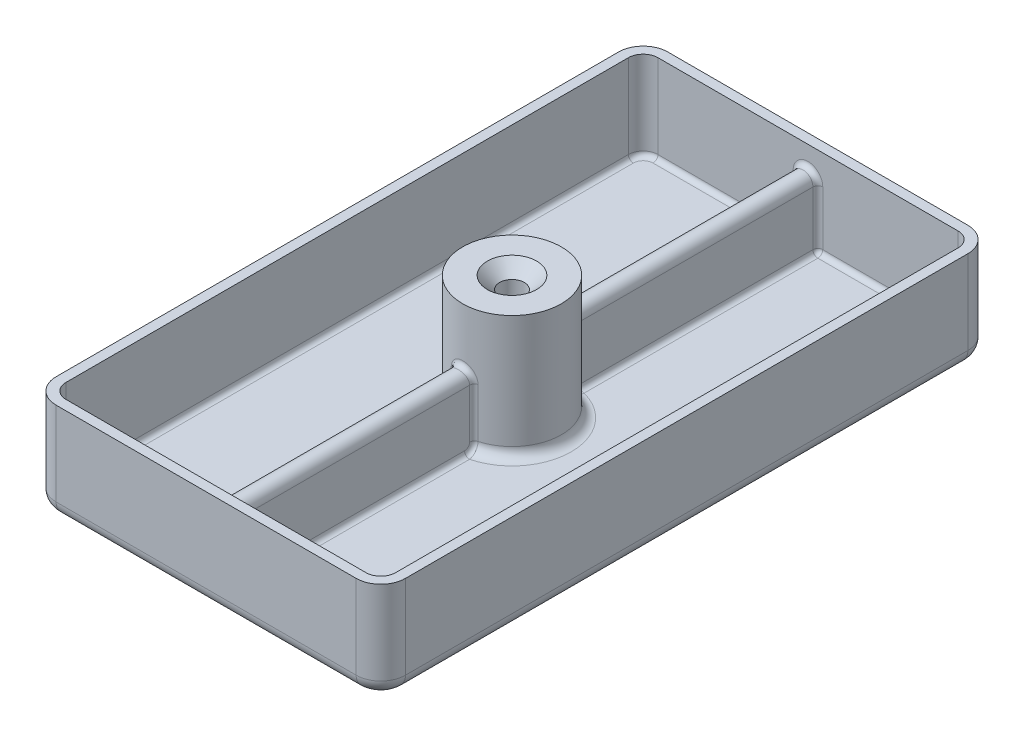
ISO-10303-21;
HEADER;
FILE_DESCRIPTION(('STEP AP214'),'2;1');
FILE_NAME('part.step','',(''),(''),'','','');
FILE_SCHEMA(('AUTOMOTIVE_DESIGN { 1 0 10303 214 1 1 1 1 }'));
ENDSEC;
DATA;
#1=APPLICATION_CONTEXT('core data for automotive mechanical design processes');
#2=APPLICATION_PROTOCOL_DEFINITION('international standard','automotive_design',2000,#1);
#3=PRODUCT_CONTEXT('',#1,'mechanical');
#4=PRODUCT('Part','Part','',(#3));
#5=PRODUCT_RELATED_PRODUCT_CATEGORY('part','',(#4));
#6=PRODUCT_DEFINITION_FORMATION('','',#4);
#7=PRODUCT_DEFINITION_CONTEXT('part definition',#1,'design');
#8=PRODUCT_DEFINITION('design','',#6,#7);
#9=PRODUCT_DEFINITION_SHAPE('','',#8);
#10=(LENGTH_UNIT() NAMED_UNIT(*) SI_UNIT(.MILLI.,.METRE.));
#11=(NAMED_UNIT(*) PLANE_ANGLE_UNIT() SI_UNIT($,.RADIAN.));
#12=(NAMED_UNIT(*) SI_UNIT($,.STERADIAN.) SOLID_ANGLE_UNIT());
#13=UNCERTAINTY_MEASURE_WITH_UNIT(LENGTH_MEASURE(1.E-05),#10,'distance_accuracy_value','');
#14=(GEOMETRIC_REPRESENTATION_CONTEXT(3) GLOBAL_UNCERTAINTY_ASSIGNED_CONTEXT((#13)) GLOBAL_UNIT_ASSIGNED_CONTEXT((#10,
#11,#12)) REPRESENTATION_CONTEXT('',''));
#15=CARTESIAN_POINT('',(0.,0.,0.));
#16=DIRECTION('',(0.,0.,1.));
#17=DIRECTION('',(1.,0.,0.));
#18=AXIS2_PLACEMENT_3D('',#15,#16,#17);
#19=CARTESIAN_POINT('',(-35.4102446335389,0.,62.0051824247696));
#20=DIRECTION('',(0.,-1.,0.));
#21=DIRECTION('',(0.,0.,-1.));
#22=AXIS2_PLACEMENT_3D('',#19,#20,#21);
#23=PLANE('',#22);
#24=CARTESIAN_POINT('',(30.4102446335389,0.,-57.0051824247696));
#25=DIRECTION('',(0.,-1.,0.));
#26=DIRECTION('',(0.,0.,-1.));
#27=AXIS2_PLACEMENT_3D('',#24,#25,#26);
#28=CIRCLE('',#27,2.);
#29=CARTESIAN_POINT('',(30.4102446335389,0.,-59.0051824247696));
#30=VERTEX_POINT('',#29);
#31=CARTESIAN_POINT('',(32.4102446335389,0.,-57.0051824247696));
#32=VERTEX_POINT('',#31);
#33=EDGE_CURVE('E492',#30,#32,#28,.T.);
#34=ORIENTED_EDGE('',*,*,#33,.T.);
#35=DIRECTION('',(0.,0.,1.));
#36=VECTOR('',#35,1.);
#37=CARTESIAN_POINT('',(32.4102446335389,0.,62.0051824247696));
#38=LINE('',#37,#36);
#39=CARTESIAN_POINT('',(32.4102446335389,0.,57.0051824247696));
#40=VERTEX_POINT('',#39);
#41=EDGE_CURVE('E496',#32,#40,#38,.T.);
#42=ORIENTED_EDGE('',*,*,#41,.T.);
#43=CARTESIAN_POINT('',(30.4102446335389,0.,57.0051824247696));
#44=DIRECTION('',(0.,-1.,0.));
#45=DIRECTION('',(0.,0.,-1.));
#46=AXIS2_PLACEMENT_3D('',#43,#44,#45);
#47=CIRCLE('',#46,2.);
#48=CARTESIAN_POINT('',(30.4102446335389,0.,59.0051824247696));
#49=VERTEX_POINT('',#48);
#50=EDGE_CURVE('E494',#40,#49,#47,.T.);
#51=ORIENTED_EDGE('',*,*,#50,.T.);
#52=DIRECTION('',(1.,0.,0.));
#53=VECTOR('',#52,1.);
#54=CARTESIAN_POINT('',(-30.4102446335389,0.,59.0051824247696));
#55=LINE('',#54,#53);
#56=CARTESIAN_POINT('',(-30.4102446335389,0.,59.0051824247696));
#57=VERTEX_POINT('',#56);
#58=EDGE_CURVE('E490',#49,#57,#55,.F.);
#59=ORIENTED_EDGE('',*,*,#58,.T.);
#60=CARTESIAN_POINT('',(-30.4102446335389,0.,57.0051824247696));
#61=DIRECTION('',(0.,-1.,0.));
#62=DIRECTION('',(0.,0.,-1.));
#63=AXIS2_PLACEMENT_3D('',#60,#61,#62);
#64=CIRCLE('',#63,2.);
#65=CARTESIAN_POINT('',(-32.4102446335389,0.,57.0051824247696));
#66=VERTEX_POINT('',#65);
#67=EDGE_CURVE('E486',#57,#66,#64,.T.);
#68=ORIENTED_EDGE('',*,*,#67,.T.);
#69=DIRECTION('',(0.,0.,-1.));
#70=VECTOR('',#69,1.);
#71=CARTESIAN_POINT('',(-32.4102446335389,0.,62.0051824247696));
#72=LINE('',#71,#70);
#73=CARTESIAN_POINT('',(-32.4102446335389,0.,-57.0051824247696));
#74=VERTEX_POINT('',#73);
#75=EDGE_CURVE('E482',#66,#74,#72,.T.);
#76=ORIENTED_EDGE('',*,*,#75,.T.);
#77=CARTESIAN_POINT('',(-30.4102446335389,0.,-57.0051824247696));
#78=DIRECTION('',(0.,-1.,0.));
#79=DIRECTION('',(0.,0.,-1.));
#80=AXIS2_PLACEMENT_3D('',#77,#78,#79);
#81=CIRCLE('',#80,2.);
#82=CARTESIAN_POINT('',(-30.4102446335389,0.,-59.0051824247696));
#83=VERTEX_POINT('',#82);
#84=EDGE_CURVE('E484',#74,#83,#81,.T.);
#85=ORIENTED_EDGE('',*,*,#84,.T.);
#86=DIRECTION('',(-1.,0.,0.));
#87=VECTOR('',#86,1.);
#88=CARTESIAN_POINT('',(30.4102446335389,0.,-59.0051824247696));
#89=LINE('',#88,#87);
#90=EDGE_CURVE('E488',#83,#30,#89,.F.);
#91=ORIENTED_EDGE('',*,*,#90,.T.);
#92=EDGE_LOOP('',(#34,#42,#51,#59,#68,#76,#85,#91));
#93=FACE_BOUND('',#92,.T.);
#94=CARTESIAN_POINT('',(0.,0.,0.));
#95=DIRECTION('',(0.,1.,0.));
#96=DIRECTION('',(0.,0.,1.));
#97=AXIS2_PLACEMENT_3D('',#94,#95,#96);
#98=CIRCLE('',#97,2.49999999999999);
#99=CARTESIAN_POINT('',(0.,0.,2.49999999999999));
#100=VERTEX_POINT('',#99);
#101=EDGE_CURVE('E830',#100,#100,#98,.T.);
#102=ORIENTED_EDGE('',*,*,#101,.T.);
#103=EDGE_LOOP('',(#102));
#104=FACE_BOUND('',#103,.T.);
#105=ADVANCED_FACE('F38',(#93,#104),#23,.T.);
#106=CARTESIAN_POINT('',(0.,27.,0.));
#107=DIRECTION('',(0.,1.,0.));
#108=DIRECTION('',(0.,0.,1.));
#109=AXIS2_PLACEMENT_3D('',#106,#107,#108);
#110=PLANE('',#109);
#111=CARTESIAN_POINT('',(0.,27.,0.));
#112=DIRECTION('',(0.,1.,0.));
#113=DIRECTION('',(0.,0.,1.));
#114=AXIS2_PLACEMENT_3D('',#111,#112,#113);
#115=CIRCLE('',#114,10.);
#116=CARTESIAN_POINT('',(0.,27.,10.));
#117=VERTEX_POINT('',#116);
#118=EDGE_CURVE('E816',#117,#117,#115,.T.);
#119=ORIENTED_EDGE('',*,*,#118,.T.);
#120=EDGE_LOOP('',(#119));
#121=FACE_BOUND('',#120,.T.);
#122=CARTESIAN_POINT('',(0.,27.,0.));
#123=DIRECTION('',(0.,1.,0.));
#124=DIRECTION('',(0.,0.,1.));
#125=AXIS2_PLACEMENT_3D('',#122,#123,#124);
#126=CIRCLE('',#125,4.99999999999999);
#127=CARTESIAN_POINT('',(0.,27.,4.99999999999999));
#128=VERTEX_POINT('',#127);
#129=EDGE_CURVE('E943',#128,#128,#126,.T.);
#130=ORIENTED_EDGE('',*,*,#129,.F.);
#131=EDGE_LOOP('',(#130));
#132=FACE_BOUND('',#131,.T.);
#133=ADVANCED_FACE('F953',(#121,#132),#110,.T.);
#134=CARTESIAN_POINT('',(-35.4102446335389,2.,62.0051824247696));
#135=DIRECTION('',(0.,-1.,0.));
#136=DIRECTION('',(0.,0.,-1.));
#137=AXIS2_PLACEMENT_3D('',#134,#135,#136);
#138=PLANE('',#137);
#139=DIRECTION('',(1.,0.,0.));
#140=VECTOR('',#139,1.);
#141=CARTESIAN_POINT('',(-35.4102446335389,2.,59.0051824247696));
#142=LINE('',#141,#140);
#143=CARTESIAN_POINT('',(-3.,2.,59.0051824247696));
#144=VERTEX_POINT('',#143);
#145=CARTESIAN_POINT('',(-30.4102446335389,2.,59.0051824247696));
#146=VERTEX_POINT('',#145);
#147=EDGE_CURVE('E400',#144,#146,#142,.F.);
#148=ORIENTED_EDGE('',*,*,#147,.F.);
#149=DIRECTION('',(0.,0.,-1.));
#150=VECTOR('',#149,1.);
#151=CARTESIAN_POINT('',(-3.,2.,62.0051824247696));
#152=LINE('',#151,#150);
#153=CARTESIAN_POINT('',(-3.00000000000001,2.,11.6189500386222));
#154=VERTEX_POINT('',#153);
#155=EDGE_CURVE('E1645',#144,#154,#152,.T.);
#156=ORIENTED_EDGE('',*,*,#155,.T.);
#157=CARTESIAN_POINT('',(0.,2.,0.));
#158=DIRECTION('',(0.,-1.,0.));
#159=DIRECTION('',(0.,0.,-1.));
#160=AXIS2_PLACEMENT_3D('',#157,#158,#159);
#161=CIRCLE('',#160,12.);
#162=CARTESIAN_POINT('',(-3.,2.,-11.6189500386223));
#163=VERTEX_POINT('',#162);
#164=EDGE_CURVE('E544',#154,#163,#161,.T.);
#165=ORIENTED_EDGE('',*,*,#164,.T.);
#166=DIRECTION('',(0.,0.,-1.));
#167=VECTOR('',#166,1.);
#168=CARTESIAN_POINT('',(-3.,2.,62.0051824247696));
#169=LINE('',#168,#167);
#170=CARTESIAN_POINT('',(-3.,2.,-59.0051824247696));
#171=VERTEX_POINT('',#170);
#172=EDGE_CURVE('E1643',#163,#171,#169,.T.);
#173=ORIENTED_EDGE('',*,*,#172,.T.);
#174=DIRECTION('',(1.,0.,0.));
#175=VECTOR('',#174,1.);
#176=CARTESIAN_POINT('',(-35.4102446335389,2.,-59.0051824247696));
#177=LINE('',#176,#175);
#178=CARTESIAN_POINT('',(-30.4102446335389,2.,-59.0051824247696));
#179=VERTEX_POINT('',#178);
#180=EDGE_CURVE('E404',#179,#171,#177,.T.);
#181=ORIENTED_EDGE('',*,*,#180,.F.);
#182=CARTESIAN_POINT('',(-30.4102446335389,2.,-57.0051824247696));
#183=DIRECTION('',(0.,-1.,0.));
#184=DIRECTION('',(0.,0.,-1.));
#185=AXIS2_PLACEMENT_3D('',#182,#183,#184);
#186=CIRCLE('',#185,2.);
#187=CARTESIAN_POINT('',(-32.4102446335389,2.,-57.0051824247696));
#188=VERTEX_POINT('',#187);
#189=EDGE_CURVE('E387',#188,#179,#186,.T.);
#190=ORIENTED_EDGE('',*,*,#189,.F.);
#191=DIRECTION('',(0.,0.,-1.));
#192=VECTOR('',#191,1.);
#193=CARTESIAN_POINT('',(-32.4102446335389,2.,62.0051824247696));
#194=LINE('',#193,#192);
#195=CARTESIAN_POINT('',(-32.4102446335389,2.,57.0051824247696));
#196=VERTEX_POINT('',#195);
#197=EDGE_CURVE('E385',#196,#188,#194,.T.);
#198=ORIENTED_EDGE('',*,*,#197,.F.);
#199=CARTESIAN_POINT('',(-30.4102446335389,2.,57.0051824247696));
#200=DIRECTION('',(0.,-1.,0.));
#201=DIRECTION('',(0.,0.,-1.));
#202=AXIS2_PLACEMENT_3D('',#199,#200,#201);
#203=CIRCLE('',#202,2.);
#204=EDGE_CURVE('E366',#146,#196,#203,.T.);
#205=ORIENTED_EDGE('',*,*,#204,.F.);
#206=EDGE_LOOP('',(#148,#156,#165,#173,#181,#190,#198,#205));
#207=FACE_BOUND('',#206,.T.);
#208=ADVANCED_FACE('F955',(#207),#138,.F.);
#209=CARTESIAN_POINT('',(0.,2.,0.));
#210=DIRECTION('',(0.,-1.,0.));
#211=DIRECTION('',(0.,0.,-1.));
#212=AXIS2_PLACEMENT_3D('',#209,#210,#211);
#213=CIRCLE('',#212,12.);
#214=CARTESIAN_POINT('',(3.,2.,-11.6189500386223));
#215=VERTEX_POINT('',#214);
#216=CARTESIAN_POINT('',(3.,2.,11.6189500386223));
#217=VERTEX_POINT('',#216);
#218=EDGE_CURVE('E541',#215,#217,#213,.T.);
#219=ORIENTED_EDGE('',*,*,#218,.T.);
#220=DIRECTION('',(0.,0.,-1.));
#221=VECTOR('',#220,1.);
#222=CARTESIAN_POINT('',(3.,2.,62.0051824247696));
#223=LINE('',#222,#221);
#224=CARTESIAN_POINT('',(3.,2.,59.0051824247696));
#225=VERTEX_POINT('',#224);
#226=EDGE_CURVE('E876',#217,#225,#223,.F.);
#227=ORIENTED_EDGE('',*,*,#226,.T.);
#228=CARTESIAN_POINT('',(30.4102446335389,2.,59.0051824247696));
#229=VERTEX_POINT('',#228);
#230=EDGE_CURVE('E392',#229,#225,#142,.F.);
#231=ORIENTED_EDGE('',*,*,#230,.F.);
#232=CARTESIAN_POINT('',(30.4102446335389,2.,57.0051824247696));
#233=DIRECTION('',(0.,-1.,0.));
#234=DIRECTION('',(0.,0.,-1.));
#235=AXIS2_PLACEMENT_3D('',#232,#233,#234);
#236=CIRCLE('',#235,2.);
#237=CARTESIAN_POINT('',(32.4102446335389,2.,57.0051824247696));
#238=VERTEX_POINT('',#237);
#239=EDGE_CURVE('E391',#238,#229,#236,.T.);
#240=ORIENTED_EDGE('',*,*,#239,.F.);
#241=DIRECTION('',(0.,0.,-1.));
#242=VECTOR('',#241,1.);
#243=CARTESIAN_POINT('',(32.4102446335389,2.,62.0051824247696));
#244=LINE('',#243,#242);
#245=CARTESIAN_POINT('',(32.4102446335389,2.,-57.0051824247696));
#246=VERTEX_POINT('',#245);
#247=EDGE_CURVE('E393',#246,#238,#244,.F.);
#248=ORIENTED_EDGE('',*,*,#247,.F.);
#249=CARTESIAN_POINT('',(30.4102446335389,2.,-57.0051824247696));
#250=DIRECTION('',(0.,-1.,0.));
#251=DIRECTION('',(0.,0.,-1.));
#252=AXIS2_PLACEMENT_3D('',#249,#250,#251);
#253=CIRCLE('',#252,2.);
#254=CARTESIAN_POINT('',(30.4102446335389,2.,-59.0051824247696));
#255=VERTEX_POINT('',#254);
#256=EDGE_CURVE('E389',#255,#246,#253,.T.);
#257=ORIENTED_EDGE('',*,*,#256,.F.);
#258=CARTESIAN_POINT('',(3.,2.,-59.0051824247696));
#259=VERTEX_POINT('',#258);
#260=EDGE_CURVE('E402',#259,#255,#177,.T.);
#261=ORIENTED_EDGE('',*,*,#260,.F.);
#262=DIRECTION('',(0.,0.,-1.));
#263=VECTOR('',#262,1.);
#264=CARTESIAN_POINT('',(3.,2.,62.0051824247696));
#265=LINE('',#264,#263);
#266=EDGE_CURVE('E903',#259,#215,#265,.F.);
#267=ORIENTED_EDGE('',*,*,#266,.T.);
#268=EDGE_LOOP('',(#219,#227,#231,#240,#248,#257,#261,#267));
#269=FACE_BOUND('',#268,.T.);
#270=ADVANCED_FACE('F873',(#269),#138,.F.);
#271=CARTESIAN_POINT('',(-2.,2.,62.0061824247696));
#272=DIRECTION('',(-1.,0.,0.));
#273=DIRECTION('',(0.,-1.,0.));
#274=AXIS2_PLACEMENT_3D('',#271,#272,#273);
#275=PLANE('',#274);
#276=DIRECTION('',(0.,0.,-1.));
#277=VECTOR('',#276,1.);
#278=CARTESIAN_POINT('',(-2.,14.,62.0061824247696));
#279=LINE('',#278,#277);
#280=CARTESIAN_POINT('',(-2.,14.,-10.5830052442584));
#281=VERTEX_POINT('',#280);
#282=CARTESIAN_POINT('',(-2.,14.,-59.0051824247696));
#283=VERTEX_POINT('',#282);
#284=EDGE_CURVE('E821',#281,#283,#279,.T.);
#285=ORIENTED_EDGE('',*,*,#284,.T.);
#286=DIRECTION('',(0.,-1.,0.));
#287=VECTOR('',#286,1.);
#288=CARTESIAN_POINT('',(-2.,3.,-59.0051824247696));
#289=LINE('',#288,#287);
#290=CARTESIAN_POINT('',(-2.,3.,-59.0051824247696));
#291=VERTEX_POINT('',#290);
#292=EDGE_CURVE('E1591',#283,#291,#289,.T.);
#293=ORIENTED_EDGE('',*,*,#292,.T.);
#294=DIRECTION('',(0.,0.,-1.));
#295=VECTOR('',#294,1.);
#296=CARTESIAN_POINT('',(-2.,3.,62.0061824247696));
#297=LINE('',#296,#295);
#298=CARTESIAN_POINT('',(-2.,3.,-11.6189500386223));
#299=VERTEX_POINT('',#298);
#300=EDGE_CURVE('E1600',#291,#299,#297,.F.);
#301=ORIENTED_EDGE('',*,*,#300,.T.);
#302=CARTESIAN_POINT('',(-2.,3.05905063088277,-11.9682809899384));
#303=CARTESIAN_POINT('',(-2.,2.03369998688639,-12.3261246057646));
#304=CARTESIAN_POINT('',(-3.08231454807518,2.11810126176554,-12.2966688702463));
#305=CARTESIAN_POINT('',(-2.,3.03945211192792,-11.9122463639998));
#306=CARTESIAN_POINT('',(-2.,2.0073053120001,-12.2083465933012));
#307=CARTESIAN_POINT('',(-3.06946851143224,2.0789042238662,-12.1878187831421));
#308=CARTESIAN_POINT('',(-2.,3.02468741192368,-11.8545550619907));
#309=CARTESIAN_POINT('',(-2.,1.99155693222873,-12.0889436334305));
#310=CARTESIAN_POINT('',(-3.05606483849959,2.0493748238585,-12.0758193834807));
#311=CARTESIAN_POINT('',(-2.,3.00496639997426,-11.7375583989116));
#312=CARTESIAN_POINT('',(-2.,1.98083045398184,-11.8520970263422));
#313=CARTESIAN_POINT('',(-3.0285077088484,2.00993279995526,-11.8488349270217));
#314=CARTESIAN_POINT('',(-2.,3.00000304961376,-11.6782542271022));
#315=CARTESIAN_POINT('',(-2.,1.98554602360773,-11.7346832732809));
#316=CARTESIAN_POINT('',(-3.01435479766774,2.00000609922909,-11.7338520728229));
#317=CARTESIAN_POINT('',(-2.,2.99999692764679,-11.5592036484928));
#318=CARTESIAN_POINT('',(-2.,2.01435344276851,-11.5040217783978));
#319=CARTESIAN_POINT('',(-2.98553816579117,1.99999385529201,-11.5031912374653));
#320=CARTESIAN_POINT('',(-2.,3.00502840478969,-11.4994572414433));
#321=CARTESIAN_POINT('',(-2.,2.03831195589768,-11.3907374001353));
#322=CARTESIAN_POINT('',(-2.97087142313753,2.01005680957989,-11.3875144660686));
#323=CARTESIAN_POINT('',(-2.,3.02500452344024,-11.3816483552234));
#324=CARTESIAN_POINT('',(-2.,2.10394254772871,-11.1719142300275));
#325=CARTESIAN_POINT('',(-2.94154432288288,2.05000904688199,-11.1595870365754));
#326=CARTESIAN_POINT('',(-2.,3.03994852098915,-11.3235857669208));
#327=CARTESIAN_POINT('',(-2.,2.14537785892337,-11.0662350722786));
#328=CARTESIAN_POINT('',(-2.92688396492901,2.07989704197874,-11.0473361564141));
#329=CARTESIAN_POINT('',(-2.,3.07938220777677,-11.2108097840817));
#330=CARTESIAN_POINT('',(-2.,2.2440190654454,-10.8648397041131));
#331=CARTESIAN_POINT('',(-2.89802596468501,2.1587644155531,-10.8294679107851));
#332=CARTESIAN_POINT('',(-2.,3.10386938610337,-11.1560955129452));
#333=CARTESIAN_POINT('',(-2.,2.30104755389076,-10.7689227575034));
#334=CARTESIAN_POINT('',(-2.88382820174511,2.20773877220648,-10.7238488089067));
#335=CARTESIAN_POINT('',(-2.,3.16184266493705,-11.0515320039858));
#336=CARTESIAN_POINT('',(-2.,2.42899127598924,-10.5887243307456));
#337=CARTESIAN_POINT('',(-2.85635956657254,2.32368532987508,-10.5221431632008));
#338=CARTESIAN_POINT('',(-2.,3.19534361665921,-11.001690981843));
#339=CARTESIAN_POINT('',(-2.,2.49983203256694,-10.5042235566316));
#340=CARTESIAN_POINT('',(-2.84309026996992,2.39068723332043,-10.426072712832));
#341=CARTESIAN_POINT('',(-2.,3.26997474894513,-10.9091682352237));
#342=CARTESIAN_POINT('',(-2.,2.65226319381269,-10.34966565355));
#343=CARTESIAN_POINT('',(-2.81818988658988,2.53994949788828,-10.2478460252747));
#344=CARTESIAN_POINT('',(-2.,3.31099840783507,-10.866400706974));
#345=CARTESIAN_POINT('',(-2.,2.73367337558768,-10.2791988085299));
#346=CARTESIAN_POINT('',(-2.80653949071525,2.62199681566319,-10.165522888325));
#347=CARTESIAN_POINT('',(-2.,3.39978548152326,-10.7887292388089));
#348=CARTESIAN_POINT('',(-2.,2.90568941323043,-10.1527793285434));
#349=CARTESIAN_POINT('',(-2.78519343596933,2.79957096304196,-10.0160943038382));
#350=CARTESIAN_POINT('',(-2.,3.44753515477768,-10.7538096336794));
#351=CARTESIAN_POINT('',(-2.,2.99633930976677,-10.0965652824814));
#352=CARTESIAN_POINT('',(-2.77549388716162,2.89507030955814,-9.94895853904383));
#353=CARTESIAN_POINT('',(-2.,3.54685931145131,-10.6939455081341));
#354=CARTESIAN_POINT('',(-2.,3.18176700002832,-10.0011066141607));
#355=CARTESIAN_POINT('',(-2.75875566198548,3.09371862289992,-9.83391296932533));
#356=CARTESIAN_POINT('',(-2.,3.59826335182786,-10.6687184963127));
#357=CARTESIAN_POINT('',(-2.,3.27642979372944,-9.96120121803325));
#358=CARTESIAN_POINT('',(-2.75164202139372,3.19652670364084,-9.78545852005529));
#359=CARTESIAN_POINT('',(-2.,3.70460059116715,-10.627637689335));
#360=CARTESIAN_POINT('',(-2.,3.47013212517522,-9.89664907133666));
#361=CARTESIAN_POINT('',(-2.74001078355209,3.40920118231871,-9.70657384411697));
#362=CARTESIAN_POINT('',(-2.,3.75952826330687,-10.6117695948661));
#363=CARTESIAN_POINT('',(-2.,3.56934456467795,-9.87184213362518));
#364=CARTESIAN_POINT('',(-2.73548922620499,3.51905652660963,-9.67611612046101));
#365=CARTESIAN_POINT('',(-2.,3.87619317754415,-10.5890052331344));
#366=CARTESIAN_POINT('',(-2.,3.77876797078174,-9.83639725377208));
#367=CARTESIAN_POINT('',(-2.72899276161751,3.75238635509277,-9.6324258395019));
#368=CARTESIAN_POINT('',(-2.,3.93810844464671,-10.5830038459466));
#369=CARTESIAN_POINT('',(-2.,3.88948015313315,-9.8270737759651));
#370=CARTESIAN_POINT('',(-2.72727199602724,3.87621688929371,-9.62091132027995));
#371=CARTESIAN_POINT('',(-2.,4.05456897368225,-10.5830064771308));
#372=CARTESIAN_POINT('',(-2.,4.09744393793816,-9.82707852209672));
#373=CARTESIAN_POINT('',(-2.72727337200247,4.10913794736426,-9.62091609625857));
#374=CARTESIAN_POINT('',(-2.,4.10911951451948,-10.5876741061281));
#375=CARTESIAN_POINT('',(-2.,4.19495688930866,-9.83432943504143));
#376=CARTESIAN_POINT('',(-2.72861225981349,4.21823902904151,-9.62987136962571));
#377=CARTESIAN_POINT('',(-2.,4.21692697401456,-10.6061447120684));
#378=CARTESIAN_POINT('',(-2.,4.38827254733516,-9.86306695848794));
#379=CARTESIAN_POINT('',(-2.73388381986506,4.43385394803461,-9.66532069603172));
#380=CARTESIAN_POINT('',(-2.,4.27017623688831,-10.619992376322));
#381=CARTESIAN_POINT('',(-2.,4.4842587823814,-9.884682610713));
#382=CARTESIAN_POINT('',(-2.73782917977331,4.54035247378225,-9.69190054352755));
#383=CARTESIAN_POINT('',(-2.,4.32186771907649,-10.6383067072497));
#384=CARTESIAN_POINT('',(-2.,4.57793389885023,-9.91335365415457));
#385=CARTESIAN_POINT('',(-2.74302916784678,4.64373543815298,-9.72706186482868));
#386=(BOUNDED_SURFACE() B_SPLINE_SURFACE(3,2,((#302,#303,#304),(#305,#306,#307),(#308,#309,
#310),(#311,#312,#313),(#314,#315,#316),(#317,#318,#319),(#320,#321,#322),(#323,#324,#325),
(#326,#327,#328),(#329,#330,#331),(#332,#333,#334),(#335,#336,#337),(#338,#339,#340),(#341,#342,
#343),(#344,#345,#346),(#347,#348,#349),(#350,#351,#352),(#353,#354,#355),(#356,#357,#358),
(#359,#360,#361),(#362,#363,#364),(#365,#366,#367),(#368,#369,#370),(#371,#372,#373),(#374,#375,
#376),(#377,#378,#379),(#380,#381,#382),(#383,#384,#385)),.UNSPECIFIED.,.F.,.F.,
.F.) B_SPLINE_SURFACE_WITH_KNOTS((4,2,2,2,2,2,2,2,2,2,2,2,2,4),(3,3),(0.,0.177832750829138,
0.355537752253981,0.534567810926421,0.713586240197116,0.892557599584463,1.07182565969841,
1.24872783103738,1.42527368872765,1.59619181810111,1.76684812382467,1.95226748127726,
2.11574930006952,2.28003283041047),(0.,1.),
.UNSPECIFIED.) GEOMETRIC_REPRESENTATION_ITEM() RATIONAL_B_SPLINE_SURFACE(((1.,0.677379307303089,
1.),(1.,0.682122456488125,1.),(1.,0.687017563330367,1.),(1.,0.696972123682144,1.),(1.,
0.702031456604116,1.),(1.,0.712219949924,1.),(1.,0.717349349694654,1.),(1.,0.727498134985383,
1.),(1.,0.7325175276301,1.),(1.,0.742301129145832,1.),(1.,0.747065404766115,1.),(1.,
0.756201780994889,1.),(1.,0.760573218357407,1.),(1.,0.768714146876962,1.),(1.,0.772490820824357,
1.),(1.,0.779368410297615,1.),(1.,0.782470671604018,1.),(1.,0.787800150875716,1.),(1.,
0.79005211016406,1.),(1.,0.793724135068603,1.),(1.,0.795145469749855,1.),(1.,0.797185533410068,
1.),(1.,0.797724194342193,1.),(1.,0.797723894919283,1.),(1.,0.797304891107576,1.),(1.,
0.795649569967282,1.),(1.,0.794409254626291,1.),(1.,0.792770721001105,1.))) REPRESENTATION_ITEM('') SURFACE());
#387=CARTESIAN_POINT('',(-2.,3.05905063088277,-11.9682809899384));
#388=CARTESIAN_POINT('',(-2.,3.03945211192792,-11.9122463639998));
#389=CARTESIAN_POINT('',(-2.,3.02468741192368,-11.8545550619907));
#390=CARTESIAN_POINT('',(-2.,3.00496639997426,-11.7375583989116));
#391=CARTESIAN_POINT('',(-2.,3.00000304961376,-11.6782542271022));
#392=CARTESIAN_POINT('',(-2.,2.99999692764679,-11.5592036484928));
#393=CARTESIAN_POINT('',(-2.,3.00502840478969,-11.4994572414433));
#394=CARTESIAN_POINT('',(-2.,3.02500452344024,-11.3816483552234));
#395=CARTESIAN_POINT('',(-2.,3.03994852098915,-11.3235857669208));
#396=CARTESIAN_POINT('',(-2.,3.07938220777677,-11.2108097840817));
#397=CARTESIAN_POINT('',(-2.,3.10386938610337,-11.1560955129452));
#398=CARTESIAN_POINT('',(-2.,3.16184266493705,-11.0515320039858));
#399=CARTESIAN_POINT('',(-2.,3.19534361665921,-11.001690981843));
#400=CARTESIAN_POINT('',(-2.,3.26997474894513,-10.9091682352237));
#401=CARTESIAN_POINT('',(-2.,3.31099840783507,-10.866400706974));
#402=CARTESIAN_POINT('',(-2.,3.39978548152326,-10.7887292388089));
#403=CARTESIAN_POINT('',(-2.,3.44753515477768,-10.7538096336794));
#404=CARTESIAN_POINT('',(-2.,3.54685931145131,-10.6939455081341));
#405=CARTESIAN_POINT('',(-2.,3.59826335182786,-10.6687184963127));
#406=CARTESIAN_POINT('',(-2.,3.70460059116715,-10.627637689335));
#407=CARTESIAN_POINT('',(-2.,3.75952826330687,-10.6117695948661));
#408=CARTESIAN_POINT('',(-2.,3.87619317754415,-10.5890052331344));
#409=CARTESIAN_POINT('',(-2.,3.93810844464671,-10.5830038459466));
#410=CARTESIAN_POINT('',(-2.,4.05456897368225,-10.5830064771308));
#411=CARTESIAN_POINT('',(-2.,4.10911951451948,-10.5876741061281));
#412=CARTESIAN_POINT('',(-2.,4.21692697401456,-10.6061447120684));
#413=CARTESIAN_POINT('',(-2.,4.27017623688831,-10.619992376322));
#414=CARTESIAN_POINT('',(-2.,4.32186771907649,-10.6383067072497));
#415=B_SPLINE_CURVE_WITH_KNOTS('',3,(#387,#388,#389,#390,#391,#392,#393,#394,#395,#396,#397,
#398,#399,#400,#401,#402,#403,#404,#405,#406,#407,#408,#409,#410,#411,#412,#413,#414),
.UNSPECIFIED.,.F.,.F.,(4,2,2,2,2,2,2,2,2,2,2,2,2,4),(0.,0.177832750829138,0.355537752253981,
0.534567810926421,0.713586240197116,0.892557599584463,1.07182565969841,1.24872783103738,
1.42527368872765,1.59619181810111,1.76684812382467,1.95226748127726,2.11574930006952,
2.28003283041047),.UNSPECIFIED.);
#416=CARTESIAN_POINT('',(-2.,4.,-10.5830052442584));
#417=VERTEX_POINT('',#416);
#418=EDGE_CURVE('E1603',#299,#417,#415,.T.);
#419=ORIENTED_EDGE('',*,*,#418,.T.);
#420=DIRECTION('',(0.,-1.,0.));
#421=VECTOR('',#420,1.);
#422=CARTESIAN_POINT('',(-2.,2.,-10.5830052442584));
#423=LINE('',#422,#421);
#424=EDGE_CURVE('E1593',#417,#281,#423,.F.);
#425=ORIENTED_EDGE('',*,*,#424,.T.);
#426=EDGE_LOOP('',(#285,#293,#301,#419,#425));
#427=FACE_BOUND('',#426,.T.);
#428=ADVANCED_FACE('F566',(#427),#275,.T.);
#429=DIRECTION('',(0.,0.,-1.));
#430=VECTOR('',#429,1.);
#431=CARTESIAN_POINT('',(-2.,3.,62.0061824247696));
#432=LINE('',#431,#430);
#433=CARTESIAN_POINT('',(-2.,3.,11.6189500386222));
#434=VERTEX_POINT('',#433);
#435=CARTESIAN_POINT('',(-2.,3.,59.0051824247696));
#436=VERTEX_POINT('',#435);
#437=EDGE_CURVE('E564',#434,#436,#432,.F.);
#438=ORIENTED_EDGE('',*,*,#437,.T.);
#439=DIRECTION('',(0.,-1.,0.));
#440=VECTOR('',#439,1.);
#441=CARTESIAN_POINT('',(-2.,14.,59.0051824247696));
#442=LINE('',#441,#440);
#443=CARTESIAN_POINT('',(-2.,14.,59.0051824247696));
#444=VERTEX_POINT('',#443);
#445=EDGE_CURVE('E1708',#436,#444,#442,.F.);
#446=ORIENTED_EDGE('',*,*,#445,.T.);
#447=CARTESIAN_POINT('',(-2.,14.,10.5830052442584));
#448=VERTEX_POINT('',#447);
#449=EDGE_CURVE('E826',#444,#448,#279,.T.);
#450=ORIENTED_EDGE('',*,*,#449,.T.);
#451=DIRECTION('',(0.,-1.,0.));
#452=VECTOR('',#451,1.);
#453=CARTESIAN_POINT('',(-2.,2.,10.5830052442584));
#454=LINE('',#453,#452);
#455=CARTESIAN_POINT('',(-2.,4.,10.5830052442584));
#456=VERTEX_POINT('',#455);
#457=EDGE_CURVE('E554',#448,#456,#454,.T.);
#458=ORIENTED_EDGE('',*,*,#457,.T.);
#459=CARTESIAN_POINT('',(-2.,4.32186771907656,10.6383067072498));
#460=CARTESIAN_POINT('',(-2.,4.57793389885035,9.91335365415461));
#461=CARTESIAN_POINT('',(-2.74302916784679,4.64373543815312,9.72706186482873));
#462=CARTESIAN_POINT('',(-2.,4.27028888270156,10.6200255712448));
#463=CARTESIAN_POINT('',(-2.,4.4844620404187,9.88473431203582));
#464=CARTESIAN_POINT('',(-2.73783846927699,4.54057776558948,9.69196433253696));
#465=CARTESIAN_POINT('',(-2.,4.21714133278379,10.606197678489));
#466=CARTESIAN_POINT('',(-2.,4.38865816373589,9.86314943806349));
#467=CARTESIAN_POINT('',(-2.73389885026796,4.43428266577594,9.66542238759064));
#468=CARTESIAN_POINT('',(-2.,4.10932885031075,10.5876940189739));
#469=CARTESIAN_POINT('',(-2.,4.19533138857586,9.83436047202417));
#470=CARTESIAN_POINT('',(-2.72861804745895,4.21865770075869,9.62990953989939));
#471=CARTESIAN_POINT('',(-2.,4.05466544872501,10.5830093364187));
#472=CARTESIAN_POINT('',(-2.,4.09761636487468,9.82708312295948));
#473=CARTESIAN_POINT('',(-2.72727433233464,4.10933089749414,9.62092151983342));
#474=CARTESIAN_POINT('',(-2.,3.94530150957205,10.5830011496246));
#475=CARTESIAN_POINT('',(-2.,3.90232473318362,9.82706946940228));
#476=CARTESIAN_POINT('',(-2.72727112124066,3.89060301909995,9.62090619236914));
#477=CARTESIAN_POINT('',(-2.,3.89060096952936,10.5876833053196));
#478=CARTESIAN_POINT('',(-2.,3.80454218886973,9.8343419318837));
#479=CARTESIAN_POINT('',(-2.72861324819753,3.78120193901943,9.62988974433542));
#480=CARTESIAN_POINT('',(-2.,3.78279812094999,10.60623089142));
#481=CARTESIAN_POINT('',(-2.,3.61123334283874,9.86320314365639));
#482=CARTESIAN_POINT('',(-2.73391007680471,3.56559624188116,9.66548536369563));
#483=CARTESIAN_POINT('',(-2.,3.72969544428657,10.6200941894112));
#484=CARTESIAN_POINT('',(-2.,3.51551113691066,9.88484839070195));
#485=CARTESIAN_POINT('',(-2.73786417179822,3.45939088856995,9.69209333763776));
#486=CARTESIAN_POINT('',(-2.,3.62664881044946,10.6564910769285));
#487=CARTESIAN_POINT('',(-2.,3.32838161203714,9.94193196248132));
#488=CARTESIAN_POINT('',(-2.7481861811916,3.25329762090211,9.76197634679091));
#489=CARTESIAN_POINT('',(-2.,3.57670009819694,10.6790112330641));
#490=CARTESIAN_POINT('',(-2.,3.23680159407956,9.97746175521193));
#491=CARTESIAN_POINT('',(-2.75455035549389,3.15340019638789,9.80522555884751));
#492=CARTESIAN_POINT('',(-2.,3.48112180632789,10.7320157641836));
#493=CARTESIAN_POINT('',(-2.,3.05945010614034,10.0616787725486));
#494=CARTESIAN_POINT('',(-2.76941485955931,2.96224361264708,9.90706916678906));
#495=CARTESIAN_POINT('',(-2.,3.43549984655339,10.7625138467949));
#496=CARTESIAN_POINT('',(-2.,2.97356764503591,10.1105427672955));
#497=CARTESIAN_POINT('',(-2.77791886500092,2.8709996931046,9.96568997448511));
#498=CARTESIAN_POINT('',(-2.,3.34907832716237,10.8310856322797));
#499=CARTESIAN_POINT('',(-2.,2.80804542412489,10.2214690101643));
#500=CARTESIAN_POINT('',(-2.79686088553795,2.69815665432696,10.0975702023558));
#501=CARTESIAN_POINT('',(-2.,3.30837468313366,10.8692800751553));
#502=CARTESIAN_POINT('',(-2.,2.72847728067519,10.2839250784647));
#503=CARTESIAN_POINT('',(-2.80732951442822,2.6167493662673,10.1710630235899));
#504=CARTESIAN_POINT('',(-2.,3.2337500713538,10.9516939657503));
#505=CARTESIAN_POINT('',(-2.,2.57902118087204,10.4203308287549));
#506=CARTESIAN_POINT('',(-2.82967196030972,2.46750014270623,10.3297474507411));
#507=CARTESIAN_POINT('',(-2.,3.19981999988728,10.9959051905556));
#508=CARTESIAN_POINT('',(-2.,2.50910988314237,10.4944678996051));
#509=CARTESIAN_POINT('',(-2.84154385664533,2.3996399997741,10.4149230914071));
#510=CARTESIAN_POINT('',(-2.,3.13832749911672,11.0908654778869));
#511=CARTESIAN_POINT('',(-2.,2.3780050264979,10.6560344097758));
#512=CARTESIAN_POINT('',(-2.86673888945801,2.27665499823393,10.5979987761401));
#513=CARTESIAN_POINT('',(-2.,3.11104292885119,11.1417943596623));
#514=CARTESIAN_POINT('',(-2.,2.31730796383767,10.7440333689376));
#515=CARTESIAN_POINT('',(-2.88009919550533,2.22208585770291,10.6962499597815));
#516=CARTESIAN_POINT('',(-2.,3.06514250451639,11.2473918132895));
#517=CARTESIAN_POINT('',(-2.,2.20953917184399,10.9296167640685));
#518=CARTESIAN_POINT('',(-2.90743644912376,2.13028500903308,10.9001188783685));
#519=CARTESIAN_POINT('',(-2.,3.0465220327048,11.3020583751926));
#520=CARTESIAN_POINT('',(-2.,2.16258643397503,11.0273917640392));
#521=CARTESIAN_POINT('',(-2.92141306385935,2.09304406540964,11.0057326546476));
#522=CARTESIAN_POINT('',(-2.,3.02167413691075,11.4004783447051));
#523=CARTESIAN_POINT('',(-2.,2.093307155,11.2064844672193));
#524=CARTESIAN_POINT('',(-2.94623665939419,2.04334827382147,11.1960157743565));
#525=CARTESIAN_POINT('',(-2.,3.01355992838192,11.4437662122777));
#526=CARTESIAN_POINT('',(-2.,2.0677977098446,11.286537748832));
#527=CARTESIAN_POINT('',(-2.95704464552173,2.02711985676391,11.2797528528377));
#528=CARTESIAN_POINT('',(-2.,3.00272095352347,11.531014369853));
#529=CARTESIAN_POINT('',(-2.,2.02638546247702,11.4503705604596));
#530=CARTESIAN_POINT('',(-2.97860418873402,2.00544190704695,11.4486187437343));
#531=CARTESIAN_POINT('',(-2.,2.99999657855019,11.5749747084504));
#532=CARTESIAN_POINT('',(-2.,2.01058252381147,11.5341985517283));
#533=CARTESIAN_POINT('',(-2.98935574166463,1.99999315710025,11.5337476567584));
#534=CARTESIAN_POINT('',(-2.,3.00000460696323,11.6781625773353));
#535=CARTESIAN_POINT('',(-2.,1.98557144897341,11.7345029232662));
#536=CARTESIAN_POINT('',(-3.01433243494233,2.00000921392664,11.7336745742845));
#537=CARTESIAN_POINT('',(-2.,3.00495483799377,11.7374022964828));
#538=CARTESIAN_POINT('',(-2.,1.98084588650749,11.8517856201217));
#539=CARTESIAN_POINT('',(-3.02847033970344,2.0099096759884,11.8485323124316));
#540=CARTESIAN_POINT('',(-2.,3.02465000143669,11.854421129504));
#541=CARTESIAN_POINT('',(-2.,1.99151436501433,12.0886684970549));
#542=CARTESIAN_POINT('',(-3.05603390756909,2.04930000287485,12.0755592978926));
#543=CARTESIAN_POINT('',(-2.,3.03942616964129,11.9121949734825));
#544=CARTESIAN_POINT('',(-2.,2.00726513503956,12.2082394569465));
#545=CARTESIAN_POINT('',(-3.06945715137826,2.07885233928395,12.187718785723));
#546=CARTESIAN_POINT('',(-2.,3.05905063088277,11.9682809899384));
#547=CARTESIAN_POINT('',(-2.,2.03369998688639,12.3261246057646));
#548=CARTESIAN_POINT('',(-3.08231454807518,2.11810126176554,12.2966688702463));
#549=(BOUNDED_SURFACE() B_SPLINE_SURFACE(3,2,((#459,#460,#461),(#462,#463,#464),(#465,#466,
#467),(#468,#469,#470),(#471,#472,#473),(#474,#475,#476),(#477,#478,#479),(#480,#481,#482),
(#483,#484,#485),(#486,#487,#488),(#489,#490,#491),(#492,#493,#494),(#495,#496,#497),(#498,#499,
#500),(#501,#502,#503),(#504,#505,#506),(#507,#508,#509),(#510,#511,#512),(#513,#514,#515),
(#516,#517,#518),(#519,#520,#521),(#522,#523,#524),(#525,#526,#527),(#528,#529,#530),(#531,#532,
#533),(#534,#535,#536),(#537,#538,#539),(#540,#541,#542),(#543,#544,#545),(#546,#547,#548)),
.UNSPECIFIED.,.F.,.F.,.F.) B_SPLINE_SURFACE_WITH_KNOTS((4,2,2,2,2,2,2,2,2,2,2,2,2,2,4),(3,3),
(0.,0.163962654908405,0.327765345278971,0.49166704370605,0.65553068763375,0.819141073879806,
0.983034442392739,1.14973326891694,1.31620652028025,1.48876050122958,1.66122240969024,
1.79302579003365,1.92483874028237,2.10232414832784,2.28037648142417),(0.,1.),
.UNSPECIFIED.) GEOMETRIC_REPRESENTATION_ITEM() RATIONAL_B_SPLINE_SURFACE(((1.,0.792770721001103,
1.),(1.,0.794406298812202,1.),(1.,0.79564483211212,1.),(1.,0.797303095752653,1.),(1.,
0.797723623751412,1.),(1.,0.797724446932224,1.),(1.,0.797304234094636,1.),(1.,0.795641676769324,
1.),(1.,0.79439952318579,1.),(1.,0.791144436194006,1.),(1.,0.789132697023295,1.),(1.,
0.784409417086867,1.),(1.,0.781696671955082,1.),(1.,0.775615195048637,1.),(1.,0.772236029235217,
1.),(1.,0.764968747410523,1.),(1.,0.761081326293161,1.),(1.,0.752760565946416,1.),(1.,
0.748312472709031,1.),(1.,0.739123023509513,1.),(1.,0.734381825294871,1.),(1.,0.725875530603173,
1.),(1.,0.72214382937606,1.),(1.,0.714641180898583,1.),(1.,0.710870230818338,1.),(1.,
0.702039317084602,1.),(1.,0.696985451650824,1.),(1.,0.687028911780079,1.),(1.,0.682126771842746,
1.),(1.,0.677379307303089,1.))) REPRESENTATION_ITEM('') SURFACE());
#550=CARTESIAN_POINT('',(-2.,4.32186771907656,10.6383067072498));
#551=CARTESIAN_POINT('',(-2.,4.27028888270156,10.6200255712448));
#552=CARTESIAN_POINT('',(-2.,4.21714133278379,10.606197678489));
#553=CARTESIAN_POINT('',(-2.,4.10932885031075,10.5876940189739));
#554=CARTESIAN_POINT('',(-2.,4.05466544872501,10.5830093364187));
#555=CARTESIAN_POINT('',(-2.,3.94530150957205,10.5830011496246));
#556=CARTESIAN_POINT('',(-2.,3.89060096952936,10.5876833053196));
#557=CARTESIAN_POINT('',(-2.,3.78279812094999,10.60623089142));
#558=CARTESIAN_POINT('',(-2.,3.72969544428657,10.6200941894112));
#559=CARTESIAN_POINT('',(-2.,3.62664881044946,10.6564910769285));
#560=CARTESIAN_POINT('',(-2.,3.57670009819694,10.6790112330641));
#561=CARTESIAN_POINT('',(-2.,3.48112180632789,10.7320157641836));
#562=CARTESIAN_POINT('',(-2.,3.43549984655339,10.7625138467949));
#563=CARTESIAN_POINT('',(-2.,3.34907832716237,10.8310856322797));
#564=CARTESIAN_POINT('',(-2.,3.30837468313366,10.8692800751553));
#565=CARTESIAN_POINT('',(-2.,3.2337500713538,10.9516939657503));
#566=CARTESIAN_POINT('',(-2.,3.19981999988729,10.9959051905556));
#567=CARTESIAN_POINT('',(-2.,3.13832749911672,11.0908654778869));
#568=CARTESIAN_POINT('',(-2.,3.11104292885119,11.1417943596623));
#569=CARTESIAN_POINT('',(-2.,3.06514250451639,11.2473918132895));
#570=CARTESIAN_POINT('',(-2.,3.0465220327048,11.3020583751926));
#571=CARTESIAN_POINT('',(-2.,3.02167413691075,11.4004783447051));
#572=CARTESIAN_POINT('',(-2.,3.01355992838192,11.4437662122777));
#573=CARTESIAN_POINT('',(-2.,3.00272095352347,11.531014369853));
#574=CARTESIAN_POINT('',(-2.,2.99999657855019,11.5749747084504));
#575=CARTESIAN_POINT('',(-2.,3.00000460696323,11.6781625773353));
#576=CARTESIAN_POINT('',(-2.,3.00495483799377,11.7374022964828));
#577=CARTESIAN_POINT('',(-2.,3.0246500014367,11.854421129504));
#578=CARTESIAN_POINT('',(-2.,3.03942616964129,11.9121949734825));
#579=CARTESIAN_POINT('',(-2.,3.05905063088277,11.9682809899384));
#580=B_SPLINE_CURVE_WITH_KNOTS('',3,(#550,#551,#552,#553,#554,#555,#556,#557,#558,#559,#560,
#561,#562,#563,#564,#565,#566,#567,#568,#569,#570,#571,#572,#573,#574,#575,#576,#577,#578,#579),
.UNSPECIFIED.,.F.,.F.,(4,2,2,2,2,2,2,2,2,2,2,2,2,2,4),(0.,0.163962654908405,0.327765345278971,
0.49166704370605,0.65553068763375,0.819141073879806,0.983034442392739,1.14973326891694,
1.31620652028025,1.48876050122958,1.66122240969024,1.79302579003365,1.92483874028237,
2.10232414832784,2.28037648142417),.UNSPECIFIED.);
#581=EDGE_CURVE('E556',#456,#434,#580,.T.);
#582=ORIENTED_EDGE('',*,*,#581,.T.);
#583=EDGE_LOOP('',(#438,#446,#450,#458,#582));
#584=FACE_BOUND('',#583,.T.);
#585=ADVANCED_FACE('F1382',(#584),#275,.T.);
#586=CARTESIAN_POINT('',(0.,14.,62.0061824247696));
#587=DIRECTION('',(0.,0.,-1.));
#588=DIRECTION('',(-1.,0.,0.));
#589=AXIS2_PLACEMENT_3D('',#586,#587,#588);
#590=CYLINDRICAL_SURFACE('',#589,2.);
#591=ORIENTED_EDGE('',*,*,#449,.F.);
#592=CARTESIAN_POINT('',(0.,14.,59.0051824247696));
#593=DIRECTION('',(0.,0.,-1.));
#594=DIRECTION('',(-1.,0.,0.));
#595=AXIS2_PLACEMENT_3D('',#592,#593,#594);
#596=CIRCLE('',#595,2.);
#597=CARTESIAN_POINT('',(2.,14.,59.0051824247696));
#598=VERTEX_POINT('',#597);
#599=EDGE_CURVE('E1616',#444,#598,#596,.T.);
#600=ORIENTED_EDGE('',*,*,#599,.T.);
#601=DIRECTION('',(0.,0.,-1.));
#602=VECTOR('',#601,1.);
#603=CARTESIAN_POINT('',(2.,14.,62.0061824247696));
#604=LINE('',#603,#602);
#605=CARTESIAN_POINT('',(2.,14.,10.5830052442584));
#606=VERTEX_POINT('',#605);
#607=EDGE_CURVE('E418',#598,#606,#604,.T.);
#608=ORIENTED_EDGE('',*,*,#607,.T.);
#609=CARTESIAN_POINT('',(1.89214384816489,13.352086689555,10.6275364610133));
#610=CARTESIAN_POINT('',(1.87037830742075,13.288523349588,9.85096246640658));
#611=CARTESIAN_POINT('',(2.58019615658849,13.0281300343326,9.66139678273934));
#612=CARTESIAN_POINT('',(1.9099290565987,13.4040265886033,10.6204077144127));
#613=CARTESIAN_POINT('',(1.89149764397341,13.3444842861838,9.84722648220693));
#614=CARTESIAN_POINT('',(2.60444871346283,13.106039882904,9.65491610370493));
#615=CARTESIAN_POINT('',(1.92558074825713,13.4567178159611,10.6140349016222));
#616=CARTESIAN_POINT('',(1.91023032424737,13.4017577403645,9.84383983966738));
#617=CARTESIAN_POINT('',(2.62579192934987,13.1850767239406,9.64912263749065));
#618=CARTESIAN_POINT('',(1.95251216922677,13.5632845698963,10.602960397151));
#619=CARTESIAN_POINT('',(1.94255095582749,13.518096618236,9.83791717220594));
#620=CARTESIAN_POINT('',(2.66251659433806,13.3449268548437,9.63905490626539));
#621=CARTESIAN_POINT('',(1.96379167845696,13.6171601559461,10.5982587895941));
#622=CARTESIAN_POINT('',(1.95616725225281,13.5772076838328,9.83537620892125));
#623=CARTESIAN_POINT('',(2.67789774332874,13.4257402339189,9.63478071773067));
#624=CARTESIAN_POINT('',(1.99087321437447,13.7798439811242,10.5869169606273));
#625=CARTESIAN_POINT('',(1.98884079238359,13.7560340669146,9.82923889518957));
#626=CARTESIAN_POINT('',(2.71482711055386,13.6697659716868,9.62446996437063));
#627=CARTESIAN_POINT('',(1.99999572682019,13.8899357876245,10.5830076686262));
#628=CARTESIAN_POINT('',(1.99999360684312,13.8781504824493,9.82707785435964));
#629=CARTESIAN_POINT('',(2.72726690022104,13.8349036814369,9.62091606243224));
#630=CARTESIAN_POINT('',(2.0000042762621,14.1101436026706,10.5830028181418));
#631=CARTESIAN_POINT('',(2.00000639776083,14.1219372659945,9.82707474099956));
#632=CARTESIAN_POINT('',(2.72727855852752,14.1652154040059,9.62091165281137));
#633=CARTESIAN_POINT('',(1.99087715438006,14.2202595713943,10.5869128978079));
#634=CARTESIAN_POINT('',(1.98885032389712,14.2440874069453,9.82923577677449));
#635=CARTESIAN_POINT('',(2.71483248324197,14.3303893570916,9.62446627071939));
#636=CARTESIAN_POINT('',(1.95471191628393,14.4372561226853,10.602063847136));
#637=CARTESIAN_POINT('',(1.94516559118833,14.4828309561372,9.83744407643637));
#638=CARTESIAN_POINT('',(2.66551624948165,14.6558841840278,9.63823986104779));
#639=CARTESIAN_POINT('',(1.92767753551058,14.5441373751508,10.613303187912));
#640=CARTESIAN_POINT('',(1.91247667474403,14.5998532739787,9.84352097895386));
#641=CARTESIAN_POINT('',(2.62865118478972,14.8162060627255,9.64845744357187));
#642=CARTESIAN_POINT('',(1.85665477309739,14.75155895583,10.6417518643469));
#643=CARTESIAN_POINT('',(1.828022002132,14.8237839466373,9.85844954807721));
#644=CARTESIAN_POINT('',(2.53180196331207,15.1273384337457,9.67431987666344));
#645=CARTESIAN_POINT('',(1.81268771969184,14.8521070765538,10.6589536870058));
#646=CARTESIAN_POINT('',(1.77600187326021,14.930993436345,9.86734250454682));
#647=CARTESIAN_POINT('',(2.47184689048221,15.2781606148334,9.68995789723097));
#648=CARTESIAN_POINT('',(1.70911195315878,15.0444495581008,10.6973822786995));
#649=CARTESIAN_POINT('',(1.65606089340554,15.1320886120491,9.88643384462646));
#650=CARTESIAN_POINT('',(2.33060720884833,15.5666743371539,9.72489298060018));
#651=CARTESIAN_POINT('',(1.64949717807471,15.1362405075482,10.718610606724));
#652=CARTESIAN_POINT('',(1.58782577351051,15.2260704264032,9.89666904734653));
#653=CARTESIAN_POINT('',(2.24931433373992,15.7043607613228,9.74419146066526));
#654=CARTESIAN_POINT('',(1.51466311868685,15.3108181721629,10.7633168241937));
#655=CARTESIAN_POINT('',(1.43745824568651,15.4004372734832,9.91717593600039));
#656=CARTESIAN_POINT('',(2.06544970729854,15.9662272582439,9.78483347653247));
#657=CARTESIAN_POINT('',(1.43910948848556,15.3933420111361,10.786835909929));
#658=CARTESIAN_POINT('',(1.35479705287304,15.4803355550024,9.92745092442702));
#659=CARTESIAN_POINT('',(1.96242202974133,16.0900130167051,9.80621446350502));
#660=CARTESIAN_POINT('',(1.27526860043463,15.5447103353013,10.8331164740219));
#661=CARTESIAN_POINT('',(1.18099637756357,15.6225823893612,9.94647588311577));
#662=CARTESIAN_POINT('',(1.73900263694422,16.3170655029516,9.84828770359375));
#663=CARTESIAN_POINT('',(1.18698123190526,15.613554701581,10.8558779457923));
#664=CARTESIAN_POINT('',(1.08974718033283,15.6846861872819,9.95520435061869));
#665=CARTESIAN_POINT('',(1.6186107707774,16.4203320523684,9.86897995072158));
#666=CARTESIAN_POINT('',(0.998331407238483,15.7367306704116,10.8985451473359));
#667=CARTESIAN_POINT('',(0.901021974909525,15.7923953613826,9.97051214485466));
#668=CARTESIAN_POINT('',(1.3613610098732,16.6050960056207,9.9077683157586));
#669=CARTESIAN_POINT('',(0.897790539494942,15.7907981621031,10.9183962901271));
#670=CARTESIAN_POINT('',(0.80358503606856,15.8373647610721,9.97700707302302));
#671=CARTESIAN_POINT('',(1.22425982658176,16.6861972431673,9.92581480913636));
#672=CARTESIAN_POINT('',(0.688621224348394,15.8811628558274,10.9525300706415));
#673=CARTESIAN_POINT('',(0.606957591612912,15.9105136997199,9.98749499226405));
#674=CARTESIAN_POINT('',(0.939028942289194,16.8217442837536,9.95684551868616));
#675=CARTESIAN_POINT('',(0.579993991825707,15.9174627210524,10.9668135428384));
#676=CARTESIAN_POINT('',(0.508075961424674,15.9383899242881,9.99144347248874));
#677=CARTESIAN_POINT('',(0.790900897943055,16.8761940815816,9.96983049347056));
#678=CARTESIAN_POINT('',(0.360494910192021,15.9704014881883,10.9879091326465));
#679=CARTESIAN_POINT('',(0.31237740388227,15.978485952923,9.99705949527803));
#680=CARTESIAN_POINT('',(0.49158396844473,16.9556022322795,9.9890083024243));
#681=CARTESIAN_POINT('',(0.2497388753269,15.9874898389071,10.9948917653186));
#682=CARTESIAN_POINT('',(0.215984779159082,15.9908774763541,9.99875258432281));
#683=CARTESIAN_POINT('',(0.340553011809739,16.9812347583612,9.99535615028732));
#684=CARTESIAN_POINT('',(0.0268421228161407,16.0029365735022,11.0011961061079));
#685=CARTESIAN_POINT('',(0.0229072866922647,16.0021589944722,10.0002965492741));
#686=CARTESIAN_POINT('',(0.0366028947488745,17.0044048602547,10.0010873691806));
#687=CARTESIAN_POINT('',(-0.0852983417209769,16.0012983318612,11.0005191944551));
#688=CARTESIAN_POINT('',(-0.0732853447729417,16.0009942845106,10.0001399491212));
#689=CARTESIAN_POINT('',(-0.116315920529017,17.0019474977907,10.0004719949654));
#690=CARTESIAN_POINT('',(-0.304653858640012,15.9796495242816,10.9917039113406));
#691=CARTESIAN_POINT('',(-0.263853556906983,15.9851226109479,9.99796184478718));
#692=CARTESIAN_POINT('',(-0.415437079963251,16.9694742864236,9.99245810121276));
#693=CARTESIAN_POINT('',(-0.411920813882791,15.9601245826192,10.9837627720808));
#694=CARTESIAN_POINT('',(-0.357748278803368,15.9708494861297,9.99600006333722));
#695=CARTESIAN_POINT('',(-0.561710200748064,16.9401868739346,9.98523888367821));
#696=CARTESIAN_POINT('',(-0.621584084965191,15.9040529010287,10.9615488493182));
#697=CARTESIAN_POINT('',(-0.545901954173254,15.9280314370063,9.98997865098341));
#698=CARTESIAN_POINT('',(-0.847614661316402,16.8560793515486,9.96504440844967));
#699=CARTESIAN_POINT('',(-0.723980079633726,15.8675050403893,10.9472756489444));
#700=CARTESIAN_POINT('',(-0.639781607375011,15.8996739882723,9.98594603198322));
#701=CARTESIAN_POINT('',(-0.987245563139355,16.8012575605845,9.95206877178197));
#702=CARTESIAN_POINT('',(-0.922272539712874,15.7780200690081,10.9136980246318));
#703=CARTESIAN_POINT('',(-0.827243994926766,15.8267244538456,9.9754756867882));
#704=CARTESIAN_POINT('',(-1.25764437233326,16.6670301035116,9.92154365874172));
#705=CARTESIAN_POINT('',(-1.01809131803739,15.7249182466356,10.8943433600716));
#706=CARTESIAN_POINT('',(-0.920567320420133,15.7822397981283,9.96905340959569));
#707=CARTESIAN_POINT('',(-1.38830634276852,16.5873773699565,9.90394850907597));
#708=CARTESIAN_POINT('',(-1.15413459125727,15.6343050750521,10.8631355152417));
#709=CARTESIAN_POINT('',(-1.05752219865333,15.7024469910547,9.95773790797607));
#710=CARTESIAN_POINT('',(-1.57381989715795,16.4514576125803,9.87557774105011));
#711=CARTESIAN_POINT('',(-1.19821107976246,15.6022650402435,10.8523674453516));
#712=CARTESIAN_POINT('',(-1.1024489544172,15.673843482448,9.9537095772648));
#713=CARTESIAN_POINT('',(-1.63392419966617,16.4033975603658,9.86578858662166));
#714=CARTESIAN_POINT('',(-1.28361999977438,15.5346943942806,10.8303712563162));
#715=CARTESIAN_POINT('',(-1.19072432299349,15.612346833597,9.94518937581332));
#716=CARTESIAN_POINT('',(-1.75039090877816,16.3020415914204,9.84579205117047));
#717=CARTESIAN_POINT('',(-1.3249496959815,15.4991603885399,10.8191426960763));
#718=CARTESIAN_POINT('',(-1.23407413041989,15.5794826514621,9.94070079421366));
#719=CARTESIAN_POINT('',(-1.8067495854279,16.2487405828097,9.8355842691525));
#720=CARTESIAN_POINT('',(-1.44686485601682,15.3853458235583,10.7845027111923));
#721=CARTESIAN_POINT('',(-1.36318525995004,15.4726670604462,9.92645064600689));
#722=CARTESIAN_POINT('',(-1.97299753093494,16.0780187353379,9.80409337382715));
#723=CARTESIAN_POINT('',(-1.52254464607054,15.3017329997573,10.7608127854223));
#724=CARTESIAN_POINT('',(-1.44612742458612,15.3915511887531,9.91606318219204));
#725=CARTESIAN_POINT('',(-2.07619724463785,15.9525994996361,9.78255707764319));
#726=CARTESIAN_POINT('',(-1.65888112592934,15.1228350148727,10.7153761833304));
#727=CARTESIAN_POINT('',(-1.59839836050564,15.2125207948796,9.89514967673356));
#728=CARTESIAN_POINT('',(-2.26211062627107,15.6842525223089,9.74125107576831));
#729=CARTESIAN_POINT('',(-1.71953871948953,15.0275505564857,10.6936293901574));
#730=CARTESIAN_POINT('',(-1.66800331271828,15.1146921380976,9.8846108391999));
#731=CARTESIAN_POINT('',(-2.34482552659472,15.5413258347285,9.72148126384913));
#732=CARTESIAN_POINT('',(-1.79814825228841,14.8774379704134,10.664269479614));
#733=CARTESIAN_POINT('',(-1.75947685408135,14.9569340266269,9.86991976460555));
#734=CARTESIAN_POINT('',(-2.45202034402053,15.3161569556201,9.69479043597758));
#735=CARTESIAN_POINT('',(-1.8223681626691,14.8259580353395,10.6549924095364));
#736=CARTESIAN_POINT('',(-1.78785717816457,14.9024252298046,9.86520146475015));
#737=CARTESIAN_POINT('',(-2.48504749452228,15.2389370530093,9.68635673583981));
#738=CARTESIAN_POINT('',(-1.86635100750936,14.7210878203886,10.6378476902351));
#739=CARTESIAN_POINT('',(-1.83966920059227,14.7905003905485,9.85637570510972));
#740=CARTESIAN_POINT('',(-2.54502410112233,15.0816317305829,9.67077062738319));
#741=CARTESIAN_POINT('',(-1.88611794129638,14.6676993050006,10.6299787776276));
#742=CARTESIAN_POINT('',(-1.8631471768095,14.7330573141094,9.85226160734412));
#743=CARTESIAN_POINT('',(-2.57197901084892,15.0015489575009,9.66361707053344));
#744=CARTESIAN_POINT('',(-1.93843814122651,14.5053084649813,10.608890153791));
#745=CARTESIAN_POINT('',(-1.9253824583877,14.557563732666,9.84116450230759));
#746=CARTESIAN_POINT('',(-2.64332473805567,14.7579626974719,9.64444559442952));
#747=CARTESIAN_POINT('',(-1.96413833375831,14.3938372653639,10.5981390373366));
#748=CARTESIAN_POINT('',(-1.95653308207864,14.4352016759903,9.83532543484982));
#749=CARTESIAN_POINT('',(-2.67837045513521,14.5907558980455,9.63467185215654));
#750=CARTESIAN_POINT('',(-1.99337221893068,14.1879664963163,10.5858358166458));
#751=CARTESIAN_POINT('',(-1.99191926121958,14.208256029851,9.82863572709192));
#752=CARTESIAN_POINT('',(-2.71823484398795,14.2819497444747,9.6234871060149));
#753=CARTESIAN_POINT('',(-2.00000954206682,14.0940125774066,10.5829983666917));
#754=CARTESIAN_POINT('',(-2.00001739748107,14.1040823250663,9.82707110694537));
#755=CARTESIAN_POINT('',(-2.72728573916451,14.1410188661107,9.62090760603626));
#756=CARTESIAN_POINT('',(-1.99998885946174,13.8902385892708,10.5830132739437));
#757=CARTESIAN_POINT('',(-1.99997968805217,13.8784815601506,9.82708235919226));
#758=CARTESIAN_POINT('',(-2.7272575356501,13.8353578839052,9.62092115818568));
#759=CARTESIAN_POINT('',(-1.99091738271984,13.7803972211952,10.5868984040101));
#760=CARTESIAN_POINT('',(-1.98889407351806,13.7566472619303,9.82922882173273));
#761=CARTESIAN_POINT('',(-2.71488734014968,13.670595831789,9.62445309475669));
#762=CARTESIAN_POINT('',(-1.96392584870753,13.6178222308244,10.5982025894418));
#763=CARTESIAN_POINT('',(-1.95632960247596,13.5779345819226,9.83534571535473));
#764=CARTESIAN_POINT('',(-2.67808070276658,13.4267333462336,9.63472962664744));
#765=CARTESIAN_POINT('',(-1.95263338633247,13.5638061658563,10.6029101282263));
#766=CARTESIAN_POINT('',(-1.9426969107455,13.5186672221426,9.83789012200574));
#767=CARTESIAN_POINT('',(-2.66268189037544,13.3457092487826,9.6390092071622));
#768=CARTESIAN_POINT('',(-1.9256555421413,13.4569722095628,10.6140045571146));
#769=CARTESIAN_POINT('',(-1.91031946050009,13.4020335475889,9.8438238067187));
#770=CARTESIAN_POINT('',(-2.6258939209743,13.1854583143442,9.64909505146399));
#771=CARTESIAN_POINT('',(-1.90997108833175,13.4041540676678,10.6203910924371));
#772=CARTESIAN_POINT('',(-1.89154698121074,13.3446209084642,9.84721792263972));
#773=CARTESIAN_POINT('',(-2.60450602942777,13.1062311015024,9.65490099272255));
#774=CARTESIAN_POINT('',(-1.89214384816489,13.352086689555,10.6275364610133));
#775=CARTESIAN_POINT('',(-1.87037830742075,13.288523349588,9.85096246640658));
#776=CARTESIAN_POINT('',(-2.58019615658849,13.0281300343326,9.66139678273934));
#777=(BOUNDED_SURFACE() B_SPLINE_SURFACE(3,2,((#609,#610,#611),(#612,#613,#614),(#615,#616,
#617),(#618,#619,#620),(#621,#622,#623),(#624,#625,#626),(#627,#628,#629),(#630,#631,#632),
(#633,#634,#635),(#636,#637,#638),(#639,#640,#641),(#642,#643,#644),(#645,#646,#647),(#648,#649,
#650),(#651,#652,#653),(#654,#655,#656),(#657,#658,#659),(#660,#661,#662),(#663,#664,#665),
(#666,#667,#668),(#669,#670,#671),(#672,#673,#674),(#675,#676,#677),(#678,#679,#680),(#681,#682,
#683),(#684,#685,#686),(#687,#688,#689),(#690,#691,#692),(#693,#694,#695),(#696,#697,#698),
(#699,#700,#701),(#702,#703,#704),(#705,#706,#707),(#708,#709,#710),(#711,#712,#713),(#714,#715,
#716),(#717,#718,#719),(#720,#721,#722),(#723,#724,#725),(#726,#727,#728),(#729,#730,#731),
(#732,#733,#734),(#735,#736,#737),(#738,#739,#740),(#741,#742,#743),(#744,#745,#746),(#747,#748,
#749),(#750,#751,#752),(#753,#754,#755),(#756,#757,#758),(#759,#760,#761),(#762,#763,#764),
(#765,#766,#767),(#768,#769,#770),(#771,#772,#773),(#774,#775,#776)),.UNSPECIFIED.,.F.,.F.,
.F.) B_SPLINE_SURFACE_WITH_KNOTS((4,2,2,2,2,2,2,2,2,2,2,2,2,2,2,2,2,2,2,2,2,2,2,2,2,2,2,4),(3,
3),(0.,0.247829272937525,0.495671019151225,0.990287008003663,1.48525976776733,1.9801293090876,
2.4743775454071,2.96881753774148,3.47489858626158,3.98098403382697,4.49559775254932,
5.01013431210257,5.51236522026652,6.01450562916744,6.50340440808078,6.9923353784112,
7.48629544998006,7.73339278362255,7.98073260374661,8.49065477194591,9.00054625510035,
9.25778612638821,9.51479403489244,10.0275801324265,10.4501777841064,10.9435683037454,
11.1920444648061,11.44046816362),(0.,1.),
.UNSPECIFIED.) GEOMETRIC_REPRESENTATION_ITEM() RATIONAL_B_SPLINE_SURFACE(((1.,0.78870308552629,
1.),(1.,0.790158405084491,1.),(1.,0.79145413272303,1.),(1.,0.793700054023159,1.),(1.,
0.794650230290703,1.),(1.,0.796939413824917,1.),(1.,0.797723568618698,1.),(1.,0.797724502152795,
1.),(1.,0.796940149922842,1.),(1.,0.793882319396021,1.),(1.,0.791609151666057,1.),(1.,
0.785800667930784,1.),(1.,0.782266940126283,1.),(1.,0.774277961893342,1.),(1.,0.769822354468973,
1.),(1.,0.760313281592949,1.),(1.,0.755248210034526,1.),(1.,0.745143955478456,1.),(1.,
0.740104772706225,1.),(1.,0.730542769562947,1.),(1.,0.726030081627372,1.),(1.,0.718198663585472,
1.),(1.,0.714879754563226,1.),(1.,0.709954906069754,1.),(1.,0.708309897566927,1.),(1.,
0.706825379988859,1.),(1.,0.706985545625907,1.),(1.,0.709059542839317,1.),(1.,0.710927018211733,
1.),(1.,0.716102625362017,1.),(1.,0.719410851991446,1.),(1.,0.727099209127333,1.),(1.,
0.731490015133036,1.),(1.,0.738474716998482,1.),(1.,0.740869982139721,1.),(1.,0.745730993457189,
1.),(1.,0.748196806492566,1.),(1.,0.755752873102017,1.),(1.,0.760850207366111,1.),(1.,
0.770505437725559,1.),(1.,0.775063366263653,1.),(1.,0.78115823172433,1.),(1.,0.78307300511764,
1.),(1.,0.786596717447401,1.),(1.,0.788205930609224,1.),(1.,0.792504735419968,1.),(1.,
0.794675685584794,1.),(1.,0.797155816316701,1.),(1.,0.797725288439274,1.),(1.,0.797722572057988,
1.),(1.,0.796943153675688,1.),(1.,0.794661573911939,1.),(1.,0.793710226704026,1.),(1.,
0.791460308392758,1.),(1.,0.790161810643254,1.),(1.,0.78870308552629,1.))) REPRESENTATION_ITEM('') SURFACE());
#778=CARTESIAN_POINT('',(1.89214384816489,13.352086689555,10.6275364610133));
#779=CARTESIAN_POINT('',(1.9099290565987,13.4040265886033,10.6204077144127));
#780=CARTESIAN_POINT('',(1.92558074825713,13.4567178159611,10.6140349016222));
#781=CARTESIAN_POINT('',(1.95251216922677,13.5632845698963,10.602960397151));
#782=CARTESIAN_POINT('',(1.96379167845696,13.6171601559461,10.5982587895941));
#783=CARTESIAN_POINT('',(1.99087321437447,13.7798439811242,10.5869169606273));
#784=CARTESIAN_POINT('',(1.99999572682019,13.8899357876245,10.5830076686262));
#785=CARTESIAN_POINT('',(2.0000042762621,14.1101436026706,10.5830028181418));
#786=CARTESIAN_POINT('',(1.99087715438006,14.2202595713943,10.5869128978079));
#787=CARTESIAN_POINT('',(1.95471191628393,14.4372561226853,10.602063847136));
#788=CARTESIAN_POINT('',(1.92767753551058,14.5441373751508,10.613303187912));
#789=CARTESIAN_POINT('',(1.85665477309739,14.75155895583,10.6417518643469));
#790=CARTESIAN_POINT('',(1.81268771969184,14.8521070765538,10.6589536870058));
#791=CARTESIAN_POINT('',(1.70911195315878,15.0444495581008,10.6973822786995));
#792=CARTESIAN_POINT('',(1.64949717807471,15.1362405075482,10.718610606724));
#793=CARTESIAN_POINT('',(1.51466311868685,15.3108181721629,10.7633168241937));
#794=CARTESIAN_POINT('',(1.43910948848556,15.3933420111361,10.786835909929));
#795=CARTESIAN_POINT('',(1.27526860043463,15.5447103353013,10.8331164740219));
#796=CARTESIAN_POINT('',(1.18698123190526,15.613554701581,10.8558779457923));
#797=CARTESIAN_POINT('',(0.998331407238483,15.7367306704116,10.8985451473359));
#798=CARTESIAN_POINT('',(0.897790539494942,15.7907981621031,10.9183962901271));
#799=CARTESIAN_POINT('',(0.688621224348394,15.8811628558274,10.9525300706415));
#800=CARTESIAN_POINT('',(0.579993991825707,15.9174627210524,10.9668135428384));
#801=CARTESIAN_POINT('',(0.360494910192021,15.9704014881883,10.9879091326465));
#802=CARTESIAN_POINT('',(0.2497388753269,15.9874898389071,10.9948917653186));
#803=CARTESIAN_POINT('',(0.0268421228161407,16.0029365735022,11.0011961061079));
#804=CARTESIAN_POINT('',(-0.0852983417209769,16.0012983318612,11.0005191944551));
#805=CARTESIAN_POINT('',(-0.304653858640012,15.9796495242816,10.9917039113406));
#806=CARTESIAN_POINT('',(-0.411920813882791,15.9601245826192,10.9837627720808));
#807=CARTESIAN_POINT('',(-0.621584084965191,15.9040529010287,10.9615488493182));
#808=CARTESIAN_POINT('',(-0.723980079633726,15.8675050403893,10.9472756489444));
#809=CARTESIAN_POINT('',(-0.922272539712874,15.7780200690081,10.9136980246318));
#810=CARTESIAN_POINT('',(-1.01809131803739,15.7249182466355,10.8943433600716));
#811=CARTESIAN_POINT('',(-1.15413459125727,15.6343050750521,10.8631355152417));
#812=CARTESIAN_POINT('',(-1.19821107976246,15.6022650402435,10.8523674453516));
#813=CARTESIAN_POINT('',(-1.28361999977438,15.5346943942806,10.8303712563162));
#814=CARTESIAN_POINT('',(-1.3249496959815,15.4991603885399,10.8191426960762));
#815=CARTESIAN_POINT('',(-1.44686485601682,15.3853458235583,10.7845027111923));
#816=CARTESIAN_POINT('',(-1.52254464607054,15.3017329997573,10.7608127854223));
#817=CARTESIAN_POINT('',(-1.65888112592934,15.1228350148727,10.7153761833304));
#818=CARTESIAN_POINT('',(-1.71953871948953,15.0275505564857,10.6936293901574));
#819=CARTESIAN_POINT('',(-1.79814825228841,14.8774379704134,10.664269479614));
#820=CARTESIAN_POINT('',(-1.8223681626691,14.8259580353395,10.6549924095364));
#821=CARTESIAN_POINT('',(-1.86635100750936,14.7210878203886,10.6378476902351));
#822=CARTESIAN_POINT('',(-1.88611794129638,14.6676993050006,10.6299787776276));
#823=CARTESIAN_POINT('',(-1.93843814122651,14.5053084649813,10.608890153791));
#824=CARTESIAN_POINT('',(-1.96413833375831,14.3938372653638,10.5981390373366));
#825=CARTESIAN_POINT('',(-1.99337221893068,14.1879664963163,10.5858358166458));
#826=CARTESIAN_POINT('',(-2.00000954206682,14.0940125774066,10.5829983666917));
#827=CARTESIAN_POINT('',(-1.99998885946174,13.8902385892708,10.5830132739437));
#828=CARTESIAN_POINT('',(-1.99091738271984,13.7803972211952,10.5868984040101));
#829=CARTESIAN_POINT('',(-1.96392584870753,13.6178222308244,10.5982025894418));
#830=CARTESIAN_POINT('',(-1.95263338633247,13.5638061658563,10.6029101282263));
#831=CARTESIAN_POINT('',(-1.9256555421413,13.4569722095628,10.6140045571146));
#832=CARTESIAN_POINT('',(-1.90997108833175,13.4041540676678,10.6203910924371));
#833=CARTESIAN_POINT('',(-1.89214384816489,13.352086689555,10.6275364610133));
#834=B_SPLINE_CURVE_WITH_KNOTS('',3,(#778,#779,#780,#781,#782,#783,#784,#785,#786,#787,#788,
#789,#790,#791,#792,#793,#794,#795,#796,#797,#798,#799,#800,#801,#802,#803,#804,#805,#806,#807,
#808,#809,#810,#811,#812,#813,#814,#815,#816,#817,#818,#819,#820,#821,#822,#823,#824,#825,#826,
#827,#828,#829,#830,#831,#832,#833),.UNSPECIFIED.,.F.,.F.,(4,2,2,2,2,2,2,2,2,2,2,2,2,2,2,2,2,2,
2,2,2,2,2,2,2,2,2,4),(0.,0.247829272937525,0.495671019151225,0.990287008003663,1.48525976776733,
1.9801293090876,2.4743775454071,2.96881753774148,3.47489858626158,3.98098403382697,
4.49559775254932,5.01013431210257,5.51236522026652,6.01450562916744,6.50340440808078,
6.9923353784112,7.48629544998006,7.73339278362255,7.98073260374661,8.49065477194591,
9.00054625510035,9.25778612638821,9.51479403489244,10.0275801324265,10.4501777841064,
10.9435683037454,11.1920444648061,11.44046816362),.UNSPECIFIED.);
#835=EDGE_CURVE('E1610',#606,#448,#834,.T.);
#836=ORIENTED_EDGE('',*,*,#835,.T.);
#837=EDGE_LOOP('',(#591,#600,#608,#836));
#838=FACE_BOUND('',#837,.T.);
#839=ADVANCED_FACE('F628',(#838),#590,.T.);
#840=CARTESIAN_POINT('',(2.,14.,-10.5830052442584));
#841=VERTEX_POINT('',#840);
#842=CARTESIAN_POINT('',(2.,14.,-59.0051824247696));
#843=VERTEX_POINT('',#842);
#844=EDGE_CURVE('E832',#841,#843,#604,.T.);
#845=ORIENTED_EDGE('',*,*,#844,.T.);
#846=CARTESIAN_POINT('',(0.,14.,-59.0051824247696));
#847=DIRECTION('',(0.,0.,1.));
#848=DIRECTION('',(1.,0.,0.));
#849=AXIS2_PLACEMENT_3D('',#846,#847,#848);
#850=CIRCLE('',#849,2.);
#851=EDGE_CURVE('E1596',#843,#283,#850,.T.);
#852=ORIENTED_EDGE('',*,*,#851,.T.);
#853=ORIENTED_EDGE('',*,*,#284,.F.);
#854=CARTESIAN_POINT('',(-1.89214384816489,13.352086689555,-10.6275364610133));
#855=CARTESIAN_POINT('',(-1.87037830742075,13.288523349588,-9.85096246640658));
#856=CARTESIAN_POINT('',(-2.58019615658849,13.0281300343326,-9.66139678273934));
#857=CARTESIAN_POINT('',(-1.9099290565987,13.4040265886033,-10.6204077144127));
#858=CARTESIAN_POINT('',(-1.89149764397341,13.3444842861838,-9.84722648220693));
#859=CARTESIAN_POINT('',(-2.60444871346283,13.106039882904,-9.65491610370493));
#860=CARTESIAN_POINT('',(-1.92558074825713,13.4567178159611,-10.6140349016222));
#861=CARTESIAN_POINT('',(-1.91023032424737,13.4017577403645,-9.84383983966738));
#862=CARTESIAN_POINT('',(-2.62579192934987,13.1850767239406,-9.64912263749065));
#863=CARTESIAN_POINT('',(-1.95251216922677,13.5632845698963,-10.602960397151));
#864=CARTESIAN_POINT('',(-1.94255095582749,13.518096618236,-9.83791717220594));
#865=CARTESIAN_POINT('',(-2.66251659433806,13.3449268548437,-9.63905490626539));
#866=CARTESIAN_POINT('',(-1.96379167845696,13.6171601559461,-10.5982587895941));
#867=CARTESIAN_POINT('',(-1.95616725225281,13.5772076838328,-9.83537620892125));
#868=CARTESIAN_POINT('',(-2.67789774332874,13.4257402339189,-9.63478071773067));
#869=CARTESIAN_POINT('',(-1.99087321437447,13.7798439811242,-10.5869169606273));
#870=CARTESIAN_POINT('',(-1.98884079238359,13.7560340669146,-9.82923889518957));
#871=CARTESIAN_POINT('',(-2.71482711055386,13.6697659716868,-9.62446996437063));
#872=CARTESIAN_POINT('',(-1.99999572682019,13.8899357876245,-10.5830076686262));
#873=CARTESIAN_POINT('',(-1.99999360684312,13.8781504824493,-9.82707785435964));
#874=CARTESIAN_POINT('',(-2.72726690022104,13.8349036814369,-9.62091606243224));
#875=CARTESIAN_POINT('',(-2.0000042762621,14.1101436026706,-10.5830028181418));
#876=CARTESIAN_POINT('',(-2.00000639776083,14.1219372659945,-9.82707474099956));
#877=CARTESIAN_POINT('',(-2.72727855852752,14.1652154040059,-9.62091165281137));
#878=CARTESIAN_POINT('',(-1.99087715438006,14.2202595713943,-10.5869128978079));
#879=CARTESIAN_POINT('',(-1.98885032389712,14.2440874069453,-9.82923577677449));
#880=CARTESIAN_POINT('',(-2.71483248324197,14.3303893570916,-9.62446627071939));
#881=CARTESIAN_POINT('',(-1.95471191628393,14.4372561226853,-10.602063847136));
#882=CARTESIAN_POINT('',(-1.94516559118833,14.4828309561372,-9.83744407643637));
#883=CARTESIAN_POINT('',(-2.66551624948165,14.6558841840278,-9.63823986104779));
#884=CARTESIAN_POINT('',(-1.92767753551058,14.5441373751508,-10.613303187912));
#885=CARTESIAN_POINT('',(-1.91247667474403,14.5998532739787,-9.84352097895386));
#886=CARTESIAN_POINT('',(-2.62865118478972,14.8162060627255,-9.64845744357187));
#887=CARTESIAN_POINT('',(-1.85665477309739,14.75155895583,-10.6417518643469));
#888=CARTESIAN_POINT('',(-1.828022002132,14.8237839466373,-9.85844954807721));
#889=CARTESIAN_POINT('',(-2.53180196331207,15.1273384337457,-9.67431987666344));
#890=CARTESIAN_POINT('',(-1.81268771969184,14.8521070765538,-10.6589536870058));
#891=CARTESIAN_POINT('',(-1.77600187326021,14.930993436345,-9.86734250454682));
#892=CARTESIAN_POINT('',(-2.47184689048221,15.2781606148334,-9.68995789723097));
#893=CARTESIAN_POINT('',(-1.70911195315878,15.0444495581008,-10.6973822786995));
#894=CARTESIAN_POINT('',(-1.65606089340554,15.1320886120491,-9.88643384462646));
#895=CARTESIAN_POINT('',(-2.33060720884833,15.5666743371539,-9.72489298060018));
#896=CARTESIAN_POINT('',(-1.64949717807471,15.1362405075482,-10.718610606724));
#897=CARTESIAN_POINT('',(-1.58782577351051,15.2260704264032,-9.89666904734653));
#898=CARTESIAN_POINT('',(-2.24931433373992,15.7043607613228,-9.74419146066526));
#899=CARTESIAN_POINT('',(-1.51466311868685,15.3108181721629,-10.7633168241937));
#900=CARTESIAN_POINT('',(-1.43745824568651,15.4004372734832,-9.91717593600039));
#901=CARTESIAN_POINT('',(-2.06544970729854,15.9662272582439,-9.78483347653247));
#902=CARTESIAN_POINT('',(-1.43910948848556,15.3933420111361,-10.786835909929));
#903=CARTESIAN_POINT('',(-1.35479705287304,15.4803355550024,-9.92745092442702));
#904=CARTESIAN_POINT('',(-1.96242202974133,16.0900130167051,-9.80621446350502));
#905=CARTESIAN_POINT('',(-1.27526860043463,15.5447103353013,-10.8331164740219));
#906=CARTESIAN_POINT('',(-1.18099637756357,15.6225823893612,-9.94647588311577));
#907=CARTESIAN_POINT('',(-1.73900263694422,16.3170655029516,-9.84828770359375));
#908=CARTESIAN_POINT('',(-1.18698123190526,15.613554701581,-10.8558779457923));
#909=CARTESIAN_POINT('',(-1.08974718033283,15.6846861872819,-9.95520435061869));
#910=CARTESIAN_POINT('',(-1.6186107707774,16.4203320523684,-9.86897995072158));
#911=CARTESIAN_POINT('',(-0.998331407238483,15.7367306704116,-10.8985451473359));
#912=CARTESIAN_POINT('',(-0.901021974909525,15.7923953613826,-9.97051214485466));
#913=CARTESIAN_POINT('',(-1.3613610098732,16.6050960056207,-9.9077683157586));
#914=CARTESIAN_POINT('',(-0.897790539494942,15.7907981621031,-10.9183962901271));
#915=CARTESIAN_POINT('',(-0.80358503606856,15.8373647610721,-9.97700707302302));
#916=CARTESIAN_POINT('',(-1.22425982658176,16.6861972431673,-9.92581480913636));
#917=CARTESIAN_POINT('',(-0.688621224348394,15.8811628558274,-10.9525300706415));
#918=CARTESIAN_POINT('',(-0.606957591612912,15.9105136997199,-9.98749499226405));
#919=CARTESIAN_POINT('',(-0.939028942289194,16.8217442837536,-9.95684551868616));
#920=CARTESIAN_POINT('',(-0.579993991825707,15.9174627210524,-10.9668135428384));
#921=CARTESIAN_POINT('',(-0.508075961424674,15.9383899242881,-9.99144347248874));
#922=CARTESIAN_POINT('',(-0.790900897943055,16.8761940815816,-9.96983049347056));
#923=CARTESIAN_POINT('',(-0.360494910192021,15.9704014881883,-10.9879091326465));
#924=CARTESIAN_POINT('',(-0.31237740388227,15.978485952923,-9.99705949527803));
#925=CARTESIAN_POINT('',(-0.49158396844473,16.9556022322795,-9.9890083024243));
#926=CARTESIAN_POINT('',(-0.2497388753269,15.9874898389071,-10.9948917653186));
#927=CARTESIAN_POINT('',(-0.215984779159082,15.9908774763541,-9.99875258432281));
#928=CARTESIAN_POINT('',(-0.340553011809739,16.9812347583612,-9.99535615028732));
#929=CARTESIAN_POINT('',(-0.0268421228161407,16.0029365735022,-11.0011961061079));
#930=CARTESIAN_POINT('',(-0.0229072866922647,16.0021589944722,-10.0002965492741));
#931=CARTESIAN_POINT('',(-0.0366028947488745,17.0044048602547,-10.0010873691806));
#932=CARTESIAN_POINT('',(0.0852983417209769,16.0012983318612,-11.0005191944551));
#933=CARTESIAN_POINT('',(0.0732853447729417,16.0009942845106,-10.0001399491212));
#934=CARTESIAN_POINT('',(0.116315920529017,17.0019474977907,-10.0004719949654));
#935=CARTESIAN_POINT('',(0.304653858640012,15.9796495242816,-10.9917039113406));
#936=CARTESIAN_POINT('',(0.263853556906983,15.9851226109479,-9.99796184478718));
#937=CARTESIAN_POINT('',(0.415437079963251,16.9694742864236,-9.99245810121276));
#938=CARTESIAN_POINT('',(0.411920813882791,15.9601245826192,-10.9837627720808));
#939=CARTESIAN_POINT('',(0.357748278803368,15.9708494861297,-9.99600006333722));
#940=CARTESIAN_POINT('',(0.561710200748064,16.9401868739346,-9.98523888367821));
#941=CARTESIAN_POINT('',(0.621584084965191,15.9040529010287,-10.9615488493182));
#942=CARTESIAN_POINT('',(0.545901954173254,15.9280314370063,-9.98997865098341));
#943=CARTESIAN_POINT('',(0.847614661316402,16.8560793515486,-9.96504440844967));
#944=CARTESIAN_POINT('',(0.723980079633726,15.8675050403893,-10.9472756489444));
#945=CARTESIAN_POINT('',(0.639781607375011,15.8996739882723,-9.98594603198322));
#946=CARTESIAN_POINT('',(0.987245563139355,16.8012575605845,-9.95206877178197));
#947=CARTESIAN_POINT('',(0.922272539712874,15.7780200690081,-10.9136980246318));
#948=CARTESIAN_POINT('',(0.827243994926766,15.8267244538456,-9.9754756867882));
#949=CARTESIAN_POINT('',(1.25764437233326,16.6670301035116,-9.92154365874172));
#950=CARTESIAN_POINT('',(1.01809131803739,15.7249182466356,-10.8943433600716));
#951=CARTESIAN_POINT('',(0.920567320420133,15.7822397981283,-9.96905340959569));
#952=CARTESIAN_POINT('',(1.38830634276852,16.5873773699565,-9.90394850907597));
#953=CARTESIAN_POINT('',(1.15413459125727,15.6343050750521,-10.8631355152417));
#954=CARTESIAN_POINT('',(1.05752219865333,15.7024469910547,-9.95773790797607));
#955=CARTESIAN_POINT('',(1.57381989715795,16.4514576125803,-9.87557774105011));
#956=CARTESIAN_POINT('',(1.19821107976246,15.6022650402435,-10.8523674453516));
#957=CARTESIAN_POINT('',(1.1024489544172,15.673843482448,-9.9537095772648));
#958=CARTESIAN_POINT('',(1.63392419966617,16.4033975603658,-9.86578858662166));
#959=CARTESIAN_POINT('',(1.28361999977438,15.5346943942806,-10.8303712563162));
#960=CARTESIAN_POINT('',(1.19072432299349,15.612346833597,-9.94518937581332));
#961=CARTESIAN_POINT('',(1.75039090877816,16.3020415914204,-9.84579205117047));
#962=CARTESIAN_POINT('',(1.3249496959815,15.4991603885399,-10.8191426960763));
#963=CARTESIAN_POINT('',(1.23407413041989,15.5794826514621,-9.94070079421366));
#964=CARTESIAN_POINT('',(1.8067495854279,16.2487405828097,-9.8355842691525));
#965=CARTESIAN_POINT('',(1.44686485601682,15.3853458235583,-10.7845027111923));
#966=CARTESIAN_POINT('',(1.36318525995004,15.4726670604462,-9.92645064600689));
#967=CARTESIAN_POINT('',(1.97299753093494,16.0780187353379,-9.80409337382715));
#968=CARTESIAN_POINT('',(1.52254464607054,15.3017329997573,-10.7608127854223));
#969=CARTESIAN_POINT('',(1.44612742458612,15.3915511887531,-9.91606318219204));
#970=CARTESIAN_POINT('',(2.07619724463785,15.9525994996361,-9.78255707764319));
#971=CARTESIAN_POINT('',(1.65888112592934,15.1228350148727,-10.7153761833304));
#972=CARTESIAN_POINT('',(1.59839836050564,15.2125207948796,-9.89514967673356));
#973=CARTESIAN_POINT('',(2.26211062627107,15.6842525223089,-9.74125107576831));
#974=CARTESIAN_POINT('',(1.71953871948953,15.0275505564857,-10.6936293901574));
#975=CARTESIAN_POINT('',(1.66800331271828,15.1146921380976,-9.8846108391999));
#976=CARTESIAN_POINT('',(2.34482552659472,15.5413258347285,-9.72148126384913));
#977=CARTESIAN_POINT('',(1.79814825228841,14.8774379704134,-10.664269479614));
#978=CARTESIAN_POINT('',(1.75947685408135,14.9569340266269,-9.86991976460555));
#979=CARTESIAN_POINT('',(2.45202034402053,15.3161569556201,-9.69479043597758));
#980=CARTESIAN_POINT('',(1.8223681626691,14.8259580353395,-10.6549924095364));
#981=CARTESIAN_POINT('',(1.78785717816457,14.9024252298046,-9.86520146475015));
#982=CARTESIAN_POINT('',(2.48504749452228,15.2389370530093,-9.68635673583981));
#983=CARTESIAN_POINT('',(1.86635100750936,14.7210878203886,-10.6378476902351));
#984=CARTESIAN_POINT('',(1.83966920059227,14.7905003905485,-9.85637570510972));
#985=CARTESIAN_POINT('',(2.54502410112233,15.0816317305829,-9.67077062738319));
#986=CARTESIAN_POINT('',(1.88611794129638,14.6676993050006,-10.6299787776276));
#987=CARTESIAN_POINT('',(1.8631471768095,14.7330573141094,-9.85226160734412));
#988=CARTESIAN_POINT('',(2.57197901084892,15.0015489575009,-9.66361707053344));
#989=CARTESIAN_POINT('',(1.93843814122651,14.5053084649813,-10.608890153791));
#990=CARTESIAN_POINT('',(1.9253824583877,14.557563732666,-9.84116450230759));
#991=CARTESIAN_POINT('',(2.64332473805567,14.7579626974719,-9.64444559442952));
#992=CARTESIAN_POINT('',(1.96413833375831,14.3938372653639,-10.5981390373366));
#993=CARTESIAN_POINT('',(1.95653308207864,14.4352016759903,-9.83532543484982));
#994=CARTESIAN_POINT('',(2.67837045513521,14.5907558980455,-9.63467185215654));
#995=CARTESIAN_POINT('',(1.99337221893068,14.1879664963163,-10.5858358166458));
#996=CARTESIAN_POINT('',(1.99191926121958,14.208256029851,-9.82863572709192));
#997=CARTESIAN_POINT('',(2.71823484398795,14.2819497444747,-9.6234871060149));
#998=CARTESIAN_POINT('',(2.00000954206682,14.0940125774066,-10.5829983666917));
#999=CARTESIAN_POINT('',(2.00001739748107,14.1040823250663,-9.82707110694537));
#1000=CARTESIAN_POINT('',(2.72728573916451,14.1410188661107,-9.62090760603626));
#1001=CARTESIAN_POINT('',(1.99998885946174,13.8902385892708,-10.5830132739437));
#1002=CARTESIAN_POINT('',(1.99997968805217,13.8784815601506,-9.82708235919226));
#1003=CARTESIAN_POINT('',(2.7272575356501,13.8353578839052,-9.62092115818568));
#1004=CARTESIAN_POINT('',(1.99091738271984,13.7803972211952,-10.5868984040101));
#1005=CARTESIAN_POINT('',(1.98889407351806,13.7566472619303,-9.82922882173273));
#1006=CARTESIAN_POINT('',(2.71488734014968,13.670595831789,-9.62445309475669));
#1007=CARTESIAN_POINT('',(1.96392584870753,13.6178222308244,-10.5982025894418));
#1008=CARTESIAN_POINT('',(1.95632960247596,13.5779345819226,-9.83534571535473));
#1009=CARTESIAN_POINT('',(2.67808070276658,13.4267333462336,-9.63472962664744));
#1010=CARTESIAN_POINT('',(1.95263338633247,13.5638061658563,-10.6029101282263));
#1011=CARTESIAN_POINT('',(1.9426969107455,13.5186672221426,-9.83789012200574));
#1012=CARTESIAN_POINT('',(2.66268189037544,13.3457092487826,-9.6390092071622));
#1013=CARTESIAN_POINT('',(1.9256555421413,13.4569722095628,-10.6140045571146));
#1014=CARTESIAN_POINT('',(1.91031946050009,13.4020335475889,-9.8438238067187));
#1015=CARTESIAN_POINT('',(2.6258939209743,13.1854583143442,-9.64909505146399));
#1016=CARTESIAN_POINT('',(1.90997108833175,13.4041540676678,-10.6203910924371));
#1017=CARTESIAN_POINT('',(1.89154698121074,13.3446209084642,-9.84721792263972));
#1018=CARTESIAN_POINT('',(2.60450602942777,13.1062311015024,-9.65490099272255));
#1019=CARTESIAN_POINT('',(1.89214384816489,13.352086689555,-10.6275364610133));
#1020=CARTESIAN_POINT('',(1.87037830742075,13.288523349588,-9.85096246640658));
#1021=CARTESIAN_POINT('',(2.58019615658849,13.0281300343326,-9.66139678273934));
#1022=(BOUNDED_SURFACE() B_SPLINE_SURFACE(3,2,((#854,#855,#856),(#857,#858,#859),(#860,#861,
#862),(#863,#864,#865),(#866,#867,#868),(#869,#870,#871),(#872,#873,#874),(#875,#876,#877),
(#878,#879,#880),(#881,#882,#883),(#884,#885,#886),(#887,#888,#889),(#890,#891,#892),(#893,#894,
#895),(#896,#897,#898),(#899,#900,#901),(#902,#903,#904),(#905,#906,#907),(#908,#909,#910),
(#911,#912,#913),(#914,#915,#916),(#917,#918,#919),(#920,#921,#922),(#923,#924,#925),(#926,#927,
#928),(#929,#930,#931),(#932,#933,#934),(#935,#936,#937),(#938,#939,#940),(#941,#942,#943),
(#944,#945,#946),(#947,#948,#949),(#950,#951,#952),(#953,#954,#955),(#956,#957,#958),(#959,#960,
#961),(#962,#963,#964),(#965,#966,#967),(#968,#969,#970),(#971,#972,#973),(#974,#975,#976),
(#977,#978,#979),(#980,#981,#982),(#983,#984,#985),(#986,#987,#988),(#989,#990,#991),(#992,#993,
#994),(#995,#996,#997),(#998,#999,#1000),(#1001,#1002,#1003),(#1004,#1005,#1006),(#1007,#1008,
#1009),(#1010,#1011,#1012),(#1013,#1014,#1015),(#1016,#1017,#1018),(#1019,#1020,#1021)),
.UNSPECIFIED.,.F.,.F.,.F.) B_SPLINE_SURFACE_WITH_KNOTS((4,2,2,2,2,2,2,2,2,2,2,2,2,2,2,2,2,2,2,2,
2,2,2,2,2,2,2,4),(3,3),(0.,0.247829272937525,0.495671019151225,0.990287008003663,
1.48525976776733,1.9801293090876,2.4743775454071,2.96881753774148,3.47489858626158,
3.98098403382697,4.49559775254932,5.01013431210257,5.51236522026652,6.01450562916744,
6.50340440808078,6.9923353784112,7.48629544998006,7.73339278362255,7.98073260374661,
8.49065477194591,9.00054625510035,9.25778612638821,9.51479403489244,10.0275801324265,
10.4501777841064,10.9435683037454,11.1920444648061,11.44046816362),(0.,1.),
.UNSPECIFIED.) GEOMETRIC_REPRESENTATION_ITEM() RATIONAL_B_SPLINE_SURFACE(((1.,0.78870308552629,
1.),(1.,0.790158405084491,1.),(1.,0.79145413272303,1.),(1.,0.793700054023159,1.),(1.,
0.794650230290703,1.),(1.,0.796939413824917,1.),(1.,0.797723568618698,1.),(1.,0.797724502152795,
1.),(1.,0.796940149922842,1.),(1.,0.793882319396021,1.),(1.,0.791609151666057,1.),(1.,
0.785800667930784,1.),(1.,0.782266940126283,1.),(1.,0.774277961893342,1.),(1.,0.769822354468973,
1.),(1.,0.760313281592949,1.),(1.,0.755248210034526,1.),(1.,0.745143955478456,1.),(1.,
0.740104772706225,1.),(1.,0.730542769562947,1.),(1.,0.726030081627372,1.),(1.,0.718198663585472,
1.),(1.,0.714879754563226,1.),(1.,0.709954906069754,1.),(1.,0.708309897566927,1.),(1.,
0.706825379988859,1.),(1.,0.706985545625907,1.),(1.,0.709059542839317,1.),(1.,0.710927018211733,
1.),(1.,0.716102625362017,1.),(1.,0.719410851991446,1.),(1.,0.727099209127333,1.),(1.,
0.731490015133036,1.),(1.,0.738474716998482,1.),(1.,0.740869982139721,1.),(1.,0.745730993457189,
1.),(1.,0.748196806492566,1.),(1.,0.755752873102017,1.),(1.,0.760850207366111,1.),(1.,
0.770505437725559,1.),(1.,0.775063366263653,1.),(1.,0.78115823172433,1.),(1.,0.78307300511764,
1.),(1.,0.786596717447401,1.),(1.,0.788205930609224,1.),(1.,0.792504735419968,1.),(1.,
0.794675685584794,1.),(1.,0.797155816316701,1.),(1.,0.797725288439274,1.),(1.,0.797722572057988,
1.),(1.,0.796943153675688,1.),(1.,0.794661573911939,1.),(1.,0.793710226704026,1.),(1.,
0.791460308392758,1.),(1.,0.790161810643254,1.),(1.,0.78870308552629,1.))) REPRESENTATION_ITEM('') SURFACE());
#1023=CARTESIAN_POINT('',(-1.89214384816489,13.352086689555,-10.6275364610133));
#1024=CARTESIAN_POINT('',(-1.9099290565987,13.4040265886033,-10.6204077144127));
#1025=CARTESIAN_POINT('',(-1.92558074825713,13.4567178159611,-10.6140349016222));
#1026=CARTESIAN_POINT('',(-1.95251216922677,13.5632845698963,-10.602960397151));
#1027=CARTESIAN_POINT('',(-1.96379167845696,13.6171601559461,-10.5982587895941));
#1028=CARTESIAN_POINT('',(-1.99087321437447,13.7798439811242,-10.5869169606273));
#1029=CARTESIAN_POINT('',(-1.99999572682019,13.8899357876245,-10.5830076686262));
#1030=CARTESIAN_POINT('',(-2.0000042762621,14.1101436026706,-10.5830028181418));
#1031=CARTESIAN_POINT('',(-1.99087715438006,14.2202595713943,-10.5869128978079));
#1032=CARTESIAN_POINT('',(-1.95471191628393,14.4372561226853,-10.602063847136));
#1033=CARTESIAN_POINT('',(-1.92767753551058,14.5441373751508,-10.613303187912));
#1034=CARTESIAN_POINT('',(-1.85665477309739,14.75155895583,-10.6417518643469));
#1035=CARTESIAN_POINT('',(-1.81268771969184,14.8521070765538,-10.6589536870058));
#1036=CARTESIAN_POINT('',(-1.70911195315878,15.0444495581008,-10.6973822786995));
#1037=CARTESIAN_POINT('',(-1.64949717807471,15.1362405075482,-10.718610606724));
#1038=CARTESIAN_POINT('',(-1.51466311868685,15.3108181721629,-10.7633168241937));
#1039=CARTESIAN_POINT('',(-1.43910948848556,15.3933420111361,-10.786835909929));
#1040=CARTESIAN_POINT('',(-1.27526860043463,15.5447103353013,-10.8331164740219));
#1041=CARTESIAN_POINT('',(-1.18698123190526,15.613554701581,-10.8558779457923));
#1042=CARTESIAN_POINT('',(-0.998331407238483,15.7367306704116,-10.8985451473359));
#1043=CARTESIAN_POINT('',(-0.897790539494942,15.7907981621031,-10.9183962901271));
#1044=CARTESIAN_POINT('',(-0.688621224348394,15.8811628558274,-10.9525300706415));
#1045=CARTESIAN_POINT('',(-0.579993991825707,15.9174627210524,-10.9668135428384));
#1046=CARTESIAN_POINT('',(-0.360494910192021,15.9704014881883,-10.9879091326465));
#1047=CARTESIAN_POINT('',(-0.2497388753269,15.9874898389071,-10.9948917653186));
#1048=CARTESIAN_POINT('',(-0.0268421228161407,16.0029365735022,-11.0011961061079));
#1049=CARTESIAN_POINT('',(0.0852983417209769,16.0012983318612,-11.0005191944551));
#1050=CARTESIAN_POINT('',(0.304653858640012,15.9796495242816,-10.9917039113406));
#1051=CARTESIAN_POINT('',(0.411920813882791,15.9601245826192,-10.9837627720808));
#1052=CARTESIAN_POINT('',(0.621584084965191,15.9040529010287,-10.9615488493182));
#1053=CARTESIAN_POINT('',(0.723980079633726,15.8675050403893,-10.9472756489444));
#1054=CARTESIAN_POINT('',(0.922272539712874,15.7780200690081,-10.9136980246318));
#1055=CARTESIAN_POINT('',(1.01809131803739,15.7249182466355,-10.8943433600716));
#1056=CARTESIAN_POINT('',(1.15413459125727,15.6343050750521,-10.8631355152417));
#1057=CARTESIAN_POINT('',(1.19821107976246,15.6022650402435,-10.8523674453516));
#1058=CARTESIAN_POINT('',(1.28361999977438,15.5346943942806,-10.8303712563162));
#1059=CARTESIAN_POINT('',(1.3249496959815,15.4991603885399,-10.8191426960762));
#1060=CARTESIAN_POINT('',(1.44686485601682,15.3853458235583,-10.7845027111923));
#1061=CARTESIAN_POINT('',(1.52254464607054,15.3017329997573,-10.7608127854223));
#1062=CARTESIAN_POINT('',(1.65888112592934,15.1228350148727,-10.7153761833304));
#1063=CARTESIAN_POINT('',(1.71953871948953,15.0275505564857,-10.6936293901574));
#1064=CARTESIAN_POINT('',(1.79814825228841,14.8774379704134,-10.664269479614));
#1065=CARTESIAN_POINT('',(1.8223681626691,14.8259580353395,-10.6549924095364));
#1066=CARTESIAN_POINT('',(1.86635100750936,14.7210878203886,-10.6378476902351));
#1067=CARTESIAN_POINT('',(1.88611794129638,14.6676993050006,-10.6299787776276));
#1068=CARTESIAN_POINT('',(1.93843814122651,14.5053084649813,-10.608890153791));
#1069=CARTESIAN_POINT('',(1.96413833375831,14.3938372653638,-10.5981390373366));
#1070=CARTESIAN_POINT('',(1.99337221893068,14.1879664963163,-10.5858358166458));
#1071=CARTESIAN_POINT('',(2.00000954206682,14.0940125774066,-10.5829983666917));
#1072=CARTESIAN_POINT('',(1.99998885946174,13.8902385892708,-10.5830132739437));
#1073=CARTESIAN_POINT('',(1.99091738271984,13.7803972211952,-10.5868984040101));
#1074=CARTESIAN_POINT('',(1.96392584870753,13.6178222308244,-10.5982025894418));
#1075=CARTESIAN_POINT('',(1.95263338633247,13.5638061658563,-10.6029101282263));
#1076=CARTESIAN_POINT('',(1.9256555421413,13.4569722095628,-10.6140045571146));
#1077=CARTESIAN_POINT('',(1.90997108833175,13.4041540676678,-10.6203910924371));
#1078=CARTESIAN_POINT('',(1.89214384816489,13.352086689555,-10.6275364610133));
#1079=B_SPLINE_CURVE_WITH_KNOTS('',3,(#1023,#1024,#1025,#1026,#1027,#1028,#1029,#1030,#1031,
#1032,#1033,#1034,#1035,#1036,#1037,#1038,#1039,#1040,#1041,#1042,#1043,#1044,#1045,#1046,#1047,
#1048,#1049,#1050,#1051,#1052,#1053,#1054,#1055,#1056,#1057,#1058,#1059,#1060,#1061,#1062,#1063,
#1064,#1065,#1066,#1067,#1068,#1069,#1070,#1071,#1072,#1073,#1074,#1075,#1076,#1077,#1078),
.UNSPECIFIED.,.F.,.F.,(4,2,2,2,2,2,2,2,2,2,2,2,2,2,2,2,2,2,2,2,2,2,2,2,2,2,2,4),(0.,
0.247829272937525,0.495671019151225,0.990287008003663,1.48525976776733,1.9801293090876,
2.4743775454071,2.96881753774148,3.47489858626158,3.98098403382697,4.49559775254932,
5.01013431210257,5.51236522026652,6.01450562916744,6.50340440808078,6.9923353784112,
7.48629544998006,7.73339278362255,7.98073260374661,8.49065477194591,9.00054625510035,
9.25778612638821,9.51479403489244,10.0275801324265,10.4501777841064,10.9435683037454,
11.1920444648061,11.44046816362),.UNSPECIFIED.);
#1080=EDGE_CURVE('E1622',#281,#841,#1079,.T.);
#1081=ORIENTED_EDGE('',*,*,#1080,.T.);
#1082=EDGE_LOOP('',(#845,#852,#853,#1081));
#1083=FACE_BOUND('',#1082,.T.);
#1084=ADVANCED_FACE('F1369',(#1083),#590,.T.);
#1085=CARTESIAN_POINT('',(2.,14.,62.0061824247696));
#1086=DIRECTION('',(1.,0.,0.));
#1087=DIRECTION('',(0.,1.,0.));
#1088=AXIS2_PLACEMENT_3D('',#1085,#1086,#1087);
#1089=PLANE('',#1088);
#1090=ORIENTED_EDGE('',*,*,#607,.F.);
#1091=DIRECTION('',(0.,1.,0.));
#1092=VECTOR('',#1091,1.);
#1093=CARTESIAN_POINT('',(2.,3.,59.0051824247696));
#1094=LINE('',#1093,#1092);
#1095=CARTESIAN_POINT('',(2.,3.,59.0051824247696));
#1096=VERTEX_POINT('',#1095);
#1097=EDGE_CURVE('E1641',#598,#1096,#1094,.F.);
#1098=ORIENTED_EDGE('',*,*,#1097,.T.);
#1099=DIRECTION('',(0.,0.,-1.));
#1100=VECTOR('',#1099,1.);
#1101=CARTESIAN_POINT('',(2.,3.,62.0061824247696));
#1102=LINE('',#1101,#1100);
#1103=CARTESIAN_POINT('',(2.,3.,11.6189500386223));
#1104=VERTEX_POINT('',#1103);
#1105=EDGE_CURVE('E1639',#1096,#1104,#1102,.T.);
#1106=ORIENTED_EDGE('',*,*,#1105,.T.);
#1107=CARTESIAN_POINT('',(2.,3.05905063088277,11.9682809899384));
#1108=CARTESIAN_POINT('',(2.,2.03369998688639,12.3261246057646));
#1109=CARTESIAN_POINT('',(3.08231454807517,2.11810126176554,12.2966688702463));
#1110=CARTESIAN_POINT('',(2.,3.03945211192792,11.9122463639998));
#1111=CARTESIAN_POINT('',(2.,2.0073053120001,12.2083465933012));
#1112=CARTESIAN_POINT('',(3.06946851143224,2.0789042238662,12.1878187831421));
#1113=CARTESIAN_POINT('',(2.,3.02468741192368,11.8545550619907));
#1114=CARTESIAN_POINT('',(2.,1.99155693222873,12.0889436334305));
#1115=CARTESIAN_POINT('',(3.05606483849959,2.0493748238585,12.0758193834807));
#1116=CARTESIAN_POINT('',(2.,3.00496639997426,11.7375583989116));
#1117=CARTESIAN_POINT('',(2.,1.98083045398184,11.8520970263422));
#1118=CARTESIAN_POINT('',(3.0285077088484,2.00993279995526,11.8488349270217));
#1119=CARTESIAN_POINT('',(2.,3.00000304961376,11.6782542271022));
#1120=CARTESIAN_POINT('',(2.,1.98554602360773,11.7346832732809));
#1121=CARTESIAN_POINT('',(3.01435479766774,2.00000609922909,11.7338520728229));
#1122=CARTESIAN_POINT('',(2.,2.99999692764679,11.5592036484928));
#1123=CARTESIAN_POINT('',(2.,2.01435344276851,11.5040217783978));
#1124=CARTESIAN_POINT('',(2.98553816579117,1.99999385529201,11.5031912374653));
#1125=CARTESIAN_POINT('',(2.,3.00502840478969,11.4994572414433));
#1126=CARTESIAN_POINT('',(2.,2.03831195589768,11.3907374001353));
#1127=CARTESIAN_POINT('',(2.97087142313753,2.01005680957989,11.3875144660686));
#1128=CARTESIAN_POINT('',(2.,3.02500452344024,11.3816483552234));
#1129=CARTESIAN_POINT('',(2.,2.10394254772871,11.1719142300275));
#1130=CARTESIAN_POINT('',(2.94154432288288,2.050009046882,11.1595870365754));
#1131=CARTESIAN_POINT('',(2.,3.03994852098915,11.3235857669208));
#1132=CARTESIAN_POINT('',(2.,2.14537785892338,11.0662350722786));
#1133=CARTESIAN_POINT('',(2.926883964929,2.07989704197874,11.0473361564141));
#1134=CARTESIAN_POINT('',(2.,3.07938220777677,11.2108097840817));
#1135=CARTESIAN_POINT('',(2.,2.2440190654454,10.8648397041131));
#1136=CARTESIAN_POINT('',(2.898025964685,2.1587644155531,10.8294679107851));
#1137=CARTESIAN_POINT('',(2.,3.10386938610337,11.1560955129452));
#1138=CARTESIAN_POINT('',(2.,2.30104755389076,10.7689227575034));
#1139=CARTESIAN_POINT('',(2.88382820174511,2.20773877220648,10.7238488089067));
#1140=CARTESIAN_POINT('',(2.,3.16184266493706,11.0515320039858));
#1141=CARTESIAN_POINT('',(2.,2.42899127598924,10.5887243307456));
#1142=CARTESIAN_POINT('',(2.85635956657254,2.32368532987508,10.5221431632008));
#1143=CARTESIAN_POINT('',(2.,3.19534361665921,11.001690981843));
#1144=CARTESIAN_POINT('',(2.,2.49983203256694,10.5042235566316));
#1145=CARTESIAN_POINT('',(2.84309026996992,2.39068723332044,10.426072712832));
#1146=CARTESIAN_POINT('',(2.,3.26997474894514,10.9091682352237));
#1147=CARTESIAN_POINT('',(2.,2.65226319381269,10.34966565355));
#1148=CARTESIAN_POINT('',(2.81818988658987,2.53994949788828,10.2478460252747));
#1149=CARTESIAN_POINT('',(2.,3.31099840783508,10.866400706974));
#1150=CARTESIAN_POINT('',(2.,2.73367337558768,10.2791988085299));
#1151=CARTESIAN_POINT('',(2.80653949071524,2.62199681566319,10.1655228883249));
#1152=CARTESIAN_POINT('',(2.,3.39978548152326,10.7887292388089));
#1153=CARTESIAN_POINT('',(2.,2.90568941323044,10.1527793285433));
#1154=CARTESIAN_POINT('',(2.78519343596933,2.79957096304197,10.0160943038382));
#1155=CARTESIAN_POINT('',(2.,3.44753515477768,10.7538096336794));
#1156=CARTESIAN_POINT('',(2.,2.99633930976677,10.0965652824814));
#1157=CARTESIAN_POINT('',(2.77549388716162,2.89507030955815,9.94895853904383));
#1158=CARTESIAN_POINT('',(2.,3.54685931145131,10.6939455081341));
#1159=CARTESIAN_POINT('',(2.,3.18176700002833,10.0011066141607));
#1160=CARTESIAN_POINT('',(2.75875566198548,3.09371862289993,9.83391296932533));
#1161=CARTESIAN_POINT('',(2.,3.59826335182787,10.6687184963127));
#1162=CARTESIAN_POINT('',(2.,3.27642979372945,9.96120121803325));
#1163=CARTESIAN_POINT('',(2.75164202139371,3.19652670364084,9.78545852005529));
#1164=CARTESIAN_POINT('',(2.,3.70460059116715,10.627637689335));
#1165=CARTESIAN_POINT('',(2.,3.47013212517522,9.89664907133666));
#1166=CARTESIAN_POINT('',(2.74001078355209,3.40920118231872,9.70657384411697));
#1167=CARTESIAN_POINT('',(2.,3.75952826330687,10.6117695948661));
#1168=CARTESIAN_POINT('',(2.,3.56934456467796,9.87184213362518));
#1169=CARTESIAN_POINT('',(2.73548922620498,3.51905652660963,9.676116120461));
#1170=CARTESIAN_POINT('',(2.,3.87619317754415,10.5890052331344));
#1171=CARTESIAN_POINT('',(2.,3.77876797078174,9.83639725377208));
#1172=CARTESIAN_POINT('',(2.7289927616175,3.75238635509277,9.6324258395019));
#1173=CARTESIAN_POINT('',(2.,3.93810844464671,10.5830038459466));
#1174=CARTESIAN_POINT('',(2.,3.88948015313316,9.8270737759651));
#1175=CARTESIAN_POINT('',(2.72727199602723,3.87621688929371,9.62091132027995));
#1176=CARTESIAN_POINT('',(2.,4.05456897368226,10.5830064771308));
#1177=CARTESIAN_POINT('',(2.,4.09744393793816,9.82707852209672));
#1178=CARTESIAN_POINT('',(2.72727337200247,4.10913794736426,9.62091609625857));
#1179=CARTESIAN_POINT('',(2.,4.10911951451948,10.5876741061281));
#1180=CARTESIAN_POINT('',(2.,4.19495688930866,9.83432943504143));
#1181=CARTESIAN_POINT('',(2.72861225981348,4.21823902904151,9.62987136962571));
#1182=CARTESIAN_POINT('',(2.,4.21692697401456,10.6061447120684));
#1183=CARTESIAN_POINT('',(2.,4.38827254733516,9.86306695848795));
#1184=CARTESIAN_POINT('',(2.73388381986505,4.43385394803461,9.66532069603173));
#1185=CARTESIAN_POINT('',(2.,4.27017623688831,10.619992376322));
#1186=CARTESIAN_POINT('',(2.,4.48425878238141,9.88468261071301));
#1187=CARTESIAN_POINT('',(2.7378291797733,4.54035247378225,9.69190054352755));
#1188=CARTESIAN_POINT('',(2.,4.32186771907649,10.6383067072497));
#1189=CARTESIAN_POINT('',(2.,4.57793389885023,9.91335365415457));
#1190=CARTESIAN_POINT('',(2.74302916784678,4.64373543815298,9.72706186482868));
#1191=(BOUNDED_SURFACE() B_SPLINE_SURFACE(3,2,((#1107,#1108,#1109),(#1110,#1111,#1112),(#1113,
#1114,#1115),(#1116,#1117,#1118),(#1119,#1120,#1121),(#1122,#1123,#1124),(#1125,#1126,#1127),
(#1128,#1129,#1130),(#1131,#1132,#1133),(#1134,#1135,#1136),(#1137,#1138,#1139),(#1140,#1141,
#1142),(#1143,#1144,#1145),(#1146,#1147,#1148),(#1149,#1150,#1151),(#1152,#1153,#1154),(#1155,
#1156,#1157),(#1158,#1159,#1160),(#1161,#1162,#1163),(#1164,#1165,#1166),(#1167,#1168,#1169),
(#1170,#1171,#1172),(#1173,#1174,#1175),(#1176,#1177,#1178),(#1179,#1180,#1181),(#1182,#1183,
#1184),(#1185,#1186,#1187),(#1188,#1189,#1190)),.UNSPECIFIED.,.F.,.F.,
.F.) B_SPLINE_SURFACE_WITH_KNOTS((4,2,2,2,2,2,2,2,2,2,2,2,2,4),(3,3),(0.,0.177832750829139,
0.355537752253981,0.534567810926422,0.713586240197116,0.892557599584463,1.07182565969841,
1.24872783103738,1.42527368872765,1.59619181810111,1.76684812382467,1.95226748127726,
2.11574930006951,2.28003283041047),(0.,1.),
.UNSPECIFIED.) GEOMETRIC_REPRESENTATION_ITEM() RATIONAL_B_SPLINE_SURFACE(((1.,0.677379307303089,
1.),(1.,0.682122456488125,1.),(1.,0.687017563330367,1.),(1.,0.696972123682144,1.),(1.,
0.702031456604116,1.),(1.,0.712219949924,1.),(1.,0.717349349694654,1.),(1.,0.727498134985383,
1.),(1.,0.7325175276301,1.),(1.,0.742301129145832,1.),(1.,0.747065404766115,1.),(1.,
0.756201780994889,1.),(1.,0.760573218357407,1.),(1.,0.768714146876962,1.),(1.,0.772490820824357,
1.),(1.,0.779368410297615,1.),(1.,0.782470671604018,1.),(1.,0.787800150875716,1.),(1.,
0.79005211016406,1.),(1.,0.793724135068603,1.),(1.,0.795145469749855,1.),(1.,0.797185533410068,
1.),(1.,0.797724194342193,1.),(1.,0.797723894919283,1.),(1.,0.797304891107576,1.),(1.,
0.795649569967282,1.),(1.,0.794409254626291,1.),(1.,0.792770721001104,1.))) REPRESENTATION_ITEM('') SURFACE());
#1192=CARTESIAN_POINT('',(2.,3.05905063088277,11.9682809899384));
#1193=CARTESIAN_POINT('',(2.,3.03945211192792,11.9122463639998));
#1194=CARTESIAN_POINT('',(2.,3.02468741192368,11.8545550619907));
#1195=CARTESIAN_POINT('',(2.,3.00496639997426,11.7375583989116));
#1196=CARTESIAN_POINT('',(2.,3.00000304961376,11.6782542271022));
#1197=CARTESIAN_POINT('',(2.,2.99999692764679,11.5592036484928));
#1198=CARTESIAN_POINT('',(2.,3.00502840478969,11.4994572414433));
#1199=CARTESIAN_POINT('',(2.,3.02500452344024,11.3816483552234));
#1200=CARTESIAN_POINT('',(2.,3.03994852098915,11.3235857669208));
#1201=CARTESIAN_POINT('',(2.,3.07938220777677,11.2108097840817));
#1202=CARTESIAN_POINT('',(2.,3.10386938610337,11.1560955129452));
#1203=CARTESIAN_POINT('',(2.,3.16184266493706,11.0515320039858));
#1204=CARTESIAN_POINT('',(2.,3.19534361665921,11.001690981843));
#1205=CARTESIAN_POINT('',(2.,3.26997474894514,10.9091682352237));
#1206=CARTESIAN_POINT('',(2.,3.31099840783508,10.866400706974));
#1207=CARTESIAN_POINT('',(2.,3.39978548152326,10.7887292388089));
#1208=CARTESIAN_POINT('',(2.,3.44753515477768,10.7538096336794));
#1209=CARTESIAN_POINT('',(2.,3.54685931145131,10.6939455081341));
#1210=CARTESIAN_POINT('',(2.,3.59826335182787,10.6687184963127));
#1211=CARTESIAN_POINT('',(2.,3.70460059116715,10.627637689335));
#1212=CARTESIAN_POINT('',(2.,3.75952826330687,10.6117695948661));
#1213=CARTESIAN_POINT('',(2.,3.87619317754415,10.5890052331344));
#1214=CARTESIAN_POINT('',(2.,3.93810844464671,10.5830038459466));
#1215=CARTESIAN_POINT('',(2.,4.05456897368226,10.5830064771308));
#1216=CARTESIAN_POINT('',(2.,4.10911951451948,10.5876741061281));
#1217=CARTESIAN_POINT('',(2.,4.21692697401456,10.6061447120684));
#1218=CARTESIAN_POINT('',(2.,4.27017623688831,10.619992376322));
#1219=CARTESIAN_POINT('',(2.,4.32186771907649,10.6383067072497));
#1220=B_SPLINE_CURVE_WITH_KNOTS('',3,(#1192,#1193,#1194,#1195,#1196,#1197,#1198,#1199,#1200,
#1201,#1202,#1203,#1204,#1205,#1206,#1207,#1208,#1209,#1210,#1211,#1212,#1213,#1214,#1215,#1216,
#1217,#1218,#1219),.UNSPECIFIED.,.F.,.F.,(4,2,2,2,2,2,2,2,2,2,2,2,2,4),(0.,0.177832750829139,
0.355537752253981,0.534567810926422,0.713586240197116,0.892557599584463,1.07182565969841,
1.24872783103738,1.42527368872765,1.59619181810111,1.76684812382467,1.95226748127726,
2.11574930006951,2.28003283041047),.UNSPECIFIED.);
#1221=CARTESIAN_POINT('',(2.,4.,10.5830052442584));
#1222=VERTEX_POINT('',#1221);
#1223=EDGE_CURVE('E1633',#1104,#1222,#1220,.T.);
#1224=ORIENTED_EDGE('',*,*,#1223,.T.);
#1225=DIRECTION('',(0.,-1.,0.));
#1226=VECTOR('',#1225,1.);
#1227=CARTESIAN_POINT('',(2.,14.,10.5830052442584));
#1228=LINE('',#1227,#1226);
#1229=EDGE_CURVE('E1631',#1222,#606,#1228,.F.);
#1230=ORIENTED_EDGE('',*,*,#1229,.T.);
#1231=EDGE_LOOP('',(#1090,#1098,#1106,#1224,#1230));
#1232=FACE_BOUND('',#1231,.T.);
#1233=ADVANCED_FACE('F656',(#1232),#1089,.T.);
#1234=DIRECTION('',(0.,0.,-1.));
#1235=VECTOR('',#1234,1.);
#1236=CARTESIAN_POINT('',(2.,3.,62.0061824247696));
#1237=LINE('',#1236,#1235);
#1238=CARTESIAN_POINT('',(2.,3.,-11.6189500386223));
#1239=VERTEX_POINT('',#1238);
#1240=CARTESIAN_POINT('',(2.,3.,-59.0051824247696));
#1241=VERTEX_POINT('',#1240);
#1242=EDGE_CURVE('E1655',#1239,#1241,#1237,.T.);
#1243=ORIENTED_EDGE('',*,*,#1242,.T.);
#1244=DIRECTION('',(0.,1.,0.));
#1245=VECTOR('',#1244,1.);
#1246=CARTESIAN_POINT('',(2.,14.,-59.0051824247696));
#1247=LINE('',#1246,#1245);
#1248=EDGE_CURVE('E1657',#1241,#843,#1247,.T.);
#1249=ORIENTED_EDGE('',*,*,#1248,.T.);
#1250=ORIENTED_EDGE('',*,*,#844,.F.);
#1251=DIRECTION('',(0.,-1.,0.));
#1252=VECTOR('',#1251,1.);
#1253=CARTESIAN_POINT('',(2.,14.,-10.5830052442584));
#1254=LINE('',#1253,#1252);
#1255=CARTESIAN_POINT('',(2.,4.,-10.5830052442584));
#1256=VERTEX_POINT('',#1255);
#1257=EDGE_CURVE('E1647',#841,#1256,#1254,.T.);
#1258=ORIENTED_EDGE('',*,*,#1257,.T.);
#1259=CARTESIAN_POINT('',(2.,4.32186771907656,-10.6383067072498));
#1260=CARTESIAN_POINT('',(2.,4.57793389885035,-9.91335365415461));
#1261=CARTESIAN_POINT('',(2.74302916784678,4.64373543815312,-9.72706186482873));
#1262=CARTESIAN_POINT('',(2.,4.27028888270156,-10.6200255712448));
#1263=CARTESIAN_POINT('',(2.,4.4844620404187,-9.88473431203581));
#1264=CARTESIAN_POINT('',(2.73783846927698,4.54057776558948,-9.69196433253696));
#1265=CARTESIAN_POINT('',(2.,4.21714133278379,-10.606197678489));
#1266=CARTESIAN_POINT('',(2.,4.38865816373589,-9.86314943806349));
#1267=CARTESIAN_POINT('',(2.73389885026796,4.43428266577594,-9.66542238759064));
#1268=CARTESIAN_POINT('',(2.,4.10932885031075,-10.5876940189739));
#1269=CARTESIAN_POINT('',(2.,4.19533138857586,-9.83436047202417));
#1270=CARTESIAN_POINT('',(2.72861804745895,4.21865770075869,-9.62990953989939));
#1271=CARTESIAN_POINT('',(2.,4.05466544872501,-10.5830093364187));
#1272=CARTESIAN_POINT('',(2.,4.09761636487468,-9.82708312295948));
#1273=CARTESIAN_POINT('',(2.72727433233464,4.10933089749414,-9.62092151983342));
#1274=CARTESIAN_POINT('',(2.,3.94530150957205,-10.5830011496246));
#1275=CARTESIAN_POINT('',(2.,3.90232473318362,-9.82706946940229));
#1276=CARTESIAN_POINT('',(2.72727112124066,3.89060301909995,-9.62090619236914));
#1277=CARTESIAN_POINT('',(2.,3.89060096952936,-10.5876833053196));
#1278=CARTESIAN_POINT('',(2.,3.80454218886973,-9.8343419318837));
#1279=CARTESIAN_POINT('',(2.72861324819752,3.78120193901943,-9.62988974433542));
#1280=CARTESIAN_POINT('',(2.,3.78279812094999,-10.60623089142));
#1281=CARTESIAN_POINT('',(2.,3.61123334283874,-9.86320314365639));
#1282=CARTESIAN_POINT('',(2.73391007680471,3.56559624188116,-9.66548536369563));
#1283=CARTESIAN_POINT('',(2.,3.72969544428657,-10.6200941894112));
#1284=CARTESIAN_POINT('',(2.,3.51551113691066,-9.88484839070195));
#1285=CARTESIAN_POINT('',(2.73786417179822,3.45939088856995,-9.69209333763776));
#1286=CARTESIAN_POINT('',(2.,3.62664881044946,-10.6564910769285));
#1287=CARTESIAN_POINT('',(2.,3.32838161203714,-9.94193196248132));
#1288=CARTESIAN_POINT('',(2.7481861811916,3.25329762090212,-9.76197634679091));
#1289=CARTESIAN_POINT('',(2.,3.57670009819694,-10.6790112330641));
#1290=CARTESIAN_POINT('',(2.,3.23680159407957,-9.97746175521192));
#1291=CARTESIAN_POINT('',(2.75455035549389,3.15340019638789,-9.80522555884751));
#1292=CARTESIAN_POINT('',(2.,3.48112180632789,-10.7320157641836));
#1293=CARTESIAN_POINT('',(2.,3.05945010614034,-10.0616787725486));
#1294=CARTESIAN_POINT('',(2.76941485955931,2.96224361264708,-9.90706916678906));
#1295=CARTESIAN_POINT('',(2.,3.43549984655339,-10.7625138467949));
#1296=CARTESIAN_POINT('',(2.,2.97356764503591,-10.1105427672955));
#1297=CARTESIAN_POINT('',(2.77791886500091,2.87099969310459,-9.96568997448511));
#1298=CARTESIAN_POINT('',(2.,3.34907832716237,-10.8310856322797));
#1299=CARTESIAN_POINT('',(2.,2.80804542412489,-10.2214690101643));
#1300=CARTESIAN_POINT('',(2.79686088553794,2.69815665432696,-10.0975702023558));
#1301=CARTESIAN_POINT('',(2.,3.30837468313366,-10.8692800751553));
#1302=CARTESIAN_POINT('',(2.,2.7284772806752,-10.2839250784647));
#1303=CARTESIAN_POINT('',(2.80732951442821,2.6167493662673,-10.1710630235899));
#1304=CARTESIAN_POINT('',(2.,3.2337500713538,-10.9516939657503));
#1305=CARTESIAN_POINT('',(2.,2.57902118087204,-10.4203308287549));
#1306=CARTESIAN_POINT('',(2.82967196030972,2.46750014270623,-10.3297474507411));
#1307=CARTESIAN_POINT('',(2.,3.19981999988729,-10.9959051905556));
#1308=CARTESIAN_POINT('',(2.,2.50910988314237,-10.4944678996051));
#1309=CARTESIAN_POINT('',(2.84154385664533,2.3996399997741,-10.4149230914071));
#1310=CARTESIAN_POINT('',(2.,3.13832749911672,-11.0908654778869));
#1311=CARTESIAN_POINT('',(2.,2.3780050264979,-10.6560344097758));
#1312=CARTESIAN_POINT('',(2.866738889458,2.27665499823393,-10.5979987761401));
#1313=CARTESIAN_POINT('',(2.,3.11104292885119,-11.1417943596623));
#1314=CARTESIAN_POINT('',(2.,2.31730796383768,-10.7440333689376));
#1315=CARTESIAN_POINT('',(2.88009919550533,2.22208585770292,-10.6962499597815));
#1316=CARTESIAN_POINT('',(2.,3.06514250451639,-11.2473918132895));
#1317=CARTESIAN_POINT('',(2.,2.20953917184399,-10.9296167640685));
#1318=CARTESIAN_POINT('',(2.90743644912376,2.13028500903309,-10.9001188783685));
#1319=CARTESIAN_POINT('',(2.,3.0465220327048,-11.3020583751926));
#1320=CARTESIAN_POINT('',(2.,2.16258643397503,-11.0273917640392));
#1321=CARTESIAN_POINT('',(2.92141306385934,2.09304406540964,-11.0057326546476));
#1322=CARTESIAN_POINT('',(2.,3.02167413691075,-11.4004783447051));
#1323=CARTESIAN_POINT('',(2.,2.093307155,-11.2064844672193));
#1324=CARTESIAN_POINT('',(2.94623665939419,2.04334827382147,-11.1960157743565));
#1325=CARTESIAN_POINT('',(2.,3.01355992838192,-11.4437662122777));
#1326=CARTESIAN_POINT('',(2.,2.06779770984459,-11.286537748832));
#1327=CARTESIAN_POINT('',(2.95704464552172,2.02711985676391,-11.2797528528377));
#1328=CARTESIAN_POINT('',(2.,3.00272095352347,-11.531014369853));
#1329=CARTESIAN_POINT('',(2.,2.02638546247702,-11.4503705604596));
#1330=CARTESIAN_POINT('',(2.97860418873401,2.00544190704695,-11.4486187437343));
#1331=CARTESIAN_POINT('',(2.,2.99999657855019,-11.5749747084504));
#1332=CARTESIAN_POINT('',(2.,2.01058252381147,-11.5341985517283));
#1333=CARTESIAN_POINT('',(2.98935574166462,1.99999315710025,-11.5337476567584));
#1334=CARTESIAN_POINT('',(2.,3.00000460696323,-11.6781625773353));
#1335=CARTESIAN_POINT('',(2.,1.98557144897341,-11.7345029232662));
#1336=CARTESIAN_POINT('',(3.01433243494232,2.00000921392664,-11.7336745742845));
#1337=CARTESIAN_POINT('',(2.,3.00495483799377,-11.7374022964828));
#1338=CARTESIAN_POINT('',(2.,1.98084588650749,-11.8517856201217));
#1339=CARTESIAN_POINT('',(3.02847033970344,2.0099096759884,-11.8485323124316));
#1340=CARTESIAN_POINT('',(2.,3.02465000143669,-11.854421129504));
#1341=CARTESIAN_POINT('',(2.,1.99151436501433,-12.0886684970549));
#1342=CARTESIAN_POINT('',(3.05603390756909,2.04930000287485,-12.0755592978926));
#1343=CARTESIAN_POINT('',(2.,3.03942616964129,-11.9121949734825));
#1344=CARTESIAN_POINT('',(2.,2.00726513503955,-12.2082394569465));
#1345=CARTESIAN_POINT('',(3.06945715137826,2.07885233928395,-12.187718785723));
#1346=CARTESIAN_POINT('',(2.,3.05905063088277,-11.9682809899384));
#1347=CARTESIAN_POINT('',(2.,2.03369998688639,-12.3261246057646));
#1348=CARTESIAN_POINT('',(3.08231454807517,2.11810126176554,-12.2966688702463));
#1349=(BOUNDED_SURFACE() B_SPLINE_SURFACE(3,2,((#1259,#1260,#1261),(#1262,#1263,#1264),(#1265,
#1266,#1267),(#1268,#1269,#1270),(#1271,#1272,#1273),(#1274,#1275,#1276),(#1277,#1278,#1279),
(#1280,#1281,#1282),(#1283,#1284,#1285),(#1286,#1287,#1288),(#1289,#1290,#1291),(#1292,#1293,
#1294),(#1295,#1296,#1297),(#1298,#1299,#1300),(#1301,#1302,#1303),(#1304,#1305,#1306),(#1307,
#1308,#1309),(#1310,#1311,#1312),(#1313,#1314,#1315),(#1316,#1317,#1318),(#1319,#1320,#1321),
(#1322,#1323,#1324),(#1325,#1326,#1327),(#1328,#1329,#1330),(#1331,#1332,#1333),(#1334,#1335,
#1336),(#1337,#1338,#1339),(#1340,#1341,#1342),(#1343,#1344,#1345),(#1346,#1347,#1348)),
.UNSPECIFIED.,.F.,.F.,.F.) B_SPLINE_SURFACE_WITH_KNOTS((4,2,2,2,2,2,2,2,2,2,2,2,2,2,4),(3,3),
(0.,0.163962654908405,0.327765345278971,0.491667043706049,0.655530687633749,0.819141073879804,
0.983034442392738,1.14973326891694,1.31620652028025,1.48876050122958,1.66122240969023,
1.79302579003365,1.92483874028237,2.10232414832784,2.28037648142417),(0.,1.),
.UNSPECIFIED.) GEOMETRIC_REPRESENTATION_ITEM() RATIONAL_B_SPLINE_SURFACE(((1.,0.792770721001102,
1.),(1.,0.794406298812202,1.),(1.,0.795644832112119,1.),(1.,0.797303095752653,1.),(1.,
0.797723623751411,1.),(1.,0.797724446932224,1.),(1.,0.797304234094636,1.),(1.,0.795641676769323,
1.),(1.,0.79439952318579,1.),(1.,0.791144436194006,1.),(1.,0.789132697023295,1.),(1.,
0.784409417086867,1.),(1.,0.781696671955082,1.),(1.,0.775615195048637,1.),(1.,0.772236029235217,
1.),(1.,0.764968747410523,1.),(1.,0.761081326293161,1.),(1.,0.752760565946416,1.),(1.,
0.748312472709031,1.),(1.,0.739123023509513,1.),(1.,0.734381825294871,1.),(1.,0.725875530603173,
1.),(1.,0.72214382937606,1.),(1.,0.714641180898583,1.),(1.,0.710870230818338,1.),(1.,
0.702039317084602,1.),(1.,0.696985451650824,1.),(1.,0.687028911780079,1.),(1.,0.682126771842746,
1.),(1.,0.677379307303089,1.))) REPRESENTATION_ITEM('') SURFACE());
#1350=CARTESIAN_POINT('',(2.,4.32186771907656,-10.6383067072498));
#1351=CARTESIAN_POINT('',(2.,4.27028888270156,-10.6200255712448));
#1352=CARTESIAN_POINT('',(2.,4.21714133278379,-10.606197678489));
#1353=CARTESIAN_POINT('',(2.,4.10932885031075,-10.5876940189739));
#1354=CARTESIAN_POINT('',(2.,4.05466544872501,-10.5830093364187));
#1355=CARTESIAN_POINT('',(2.,3.94530150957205,-10.5830011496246));
#1356=CARTESIAN_POINT('',(2.,3.89060096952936,-10.5876833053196));
#1357=CARTESIAN_POINT('',(2.,3.78279812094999,-10.60623089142));
#1358=CARTESIAN_POINT('',(2.,3.72969544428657,-10.6200941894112));
#1359=CARTESIAN_POINT('',(2.,3.62664881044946,-10.6564910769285));
#1360=CARTESIAN_POINT('',(2.,3.57670009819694,-10.6790112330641));
#1361=CARTESIAN_POINT('',(2.,3.48112180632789,-10.7320157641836));
#1362=CARTESIAN_POINT('',(2.,3.43549984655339,-10.7625138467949));
#1363=CARTESIAN_POINT('',(2.,3.34907832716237,-10.8310856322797));
#1364=CARTESIAN_POINT('',(2.,3.30837468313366,-10.8692800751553));
#1365=CARTESIAN_POINT('',(2.,3.2337500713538,-10.9516939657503));
#1366=CARTESIAN_POINT('',(2.,3.19981999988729,-10.9959051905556));
#1367=CARTESIAN_POINT('',(2.,3.13832749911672,-11.0908654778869));
#1368=CARTESIAN_POINT('',(2.,3.11104292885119,-11.1417943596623));
#1369=CARTESIAN_POINT('',(2.,3.06514250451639,-11.2473918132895));
#1370=CARTESIAN_POINT('',(2.,3.0465220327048,-11.3020583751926));
#1371=CARTESIAN_POINT('',(2.,3.02167413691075,-11.4004783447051));
#1372=CARTESIAN_POINT('',(2.,3.01355992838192,-11.4437662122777));
#1373=CARTESIAN_POINT('',(2.,3.00272095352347,-11.531014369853));
#1374=CARTESIAN_POINT('',(2.,2.99999657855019,-11.5749747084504));
#1375=CARTESIAN_POINT('',(2.,3.00000460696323,-11.6781625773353));
#1376=CARTESIAN_POINT('',(2.,3.00495483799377,-11.7374022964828));
#1377=CARTESIAN_POINT('',(2.,3.0246500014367,-11.854421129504));
#1378=CARTESIAN_POINT('',(2.,3.03942616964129,-11.9121949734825));
#1379=CARTESIAN_POINT('',(2.,3.05905063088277,-11.9682809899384));
#1380=B_SPLINE_CURVE_WITH_KNOTS('',3,(#1350,#1351,#1352,#1353,#1354,#1355,#1356,#1357,#1358,
#1359,#1360,#1361,#1362,#1363,#1364,#1365,#1366,#1367,#1368,#1369,#1370,#1371,#1372,#1373,#1374,
#1375,#1376,#1377,#1378,#1379),.UNSPECIFIED.,.F.,.F.,(4,2,2,2,2,2,2,2,2,2,2,2,2,2,4),(0.,
0.163962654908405,0.327765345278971,0.491667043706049,0.655530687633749,0.819141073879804,
0.983034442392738,1.14973326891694,1.31620652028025,1.48876050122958,1.66122240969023,
1.79302579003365,1.92483874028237,2.10232414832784,2.28037648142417),.UNSPECIFIED.);
#1381=EDGE_CURVE('E1649',#1256,#1239,#1380,.T.);
#1382=ORIENTED_EDGE('',*,*,#1381,.T.);
#1383=EDGE_LOOP('',(#1243,#1249,#1250,#1258,#1382));
#1384=FACE_BOUND('',#1383,.T.);
#1385=ADVANCED_FACE('F1356',(#1384),#1089,.T.);
#1386=CARTESIAN_POINT('',(35.4102446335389,3.,-59.0051824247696));
#1387=DIRECTION('',(1.,0.,0.));
#1388=DIRECTION('',(0.,0.,-1.));
#1389=AXIS2_PLACEMENT_3D('',#1386,#1387,#1388);
#1390=CYLINDRICAL_SURFACE('',#1389,1.);
#1391=ORIENTED_EDGE('',*,*,#180,.T.);
#1392=CARTESIAN_POINT('',(-3.,3.,-59.0051824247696));
#1393=DIRECTION('',(1.,0.,0.));
#1394=DIRECTION('',(0.,0.,-1.));
#1395=AXIS2_PLACEMENT_3D('',#1392,#1393,#1394);
#1396=CIRCLE('',#1395,1.);
#1397=CARTESIAN_POINT('',(-3.,3.,-60.0051824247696));
#1398=VERTEX_POINT('',#1397);
#1399=EDGE_CURVE('E1629',#171,#1398,#1396,.T.);
#1400=ORIENTED_EDGE('',*,*,#1399,.T.);
#1401=DIRECTION('',(1.,0.,0.));
#1402=VECTOR('',#1401,1.);
#1403=CARTESIAN_POINT('',(35.4102446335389,3.,-60.0051824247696));
#1404=LINE('',#1403,#1402);
#1405=CARTESIAN_POINT('',(-30.4102446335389,3.,-60.0051824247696));
#1406=VERTEX_POINT('',#1405);
#1407=EDGE_CURVE('E378',#1398,#1406,#1404,.F.);
#1408=ORIENTED_EDGE('',*,*,#1407,.T.);
#1409=CARTESIAN_POINT('',(-30.4102446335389,3.,-59.0051824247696));
#1410=DIRECTION('',(1.,0.,0.));
#1411=DIRECTION('',(0.,0.,-1.));
#1412=AXIS2_PLACEMENT_3D('',#1409,#1410,#1411);
#1413=CIRCLE('',#1412,1.);
#1414=EDGE_CURVE('E368',#179,#1406,#1413,.T.);
#1415=ORIENTED_EDGE('',*,*,#1414,.F.);
#1416=EDGE_LOOP('',(#1391,#1400,#1408,#1415));
#1417=FACE_BOUND('',#1416,.T.);
#1418=ADVANCED_FACE('F1140',(#1417),#1390,.F.);
#1419=CARTESIAN_POINT('',(-35.4102446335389,3.,59.0051824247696));
#1420=DIRECTION('',(-1.,0.,0.));
#1421=DIRECTION('',(0.,0.,1.));
#1422=AXIS2_PLACEMENT_3D('',#1419,#1420,#1421);
#1423=CYLINDRICAL_SURFACE('',#1422,1.);
#1424=DIRECTION('',(-1.,0.,0.));
#1425=VECTOR('',#1424,1.);
#1426=CARTESIAN_POINT('',(-35.4102446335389,3.,60.0051824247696));
#1427=LINE('',#1426,#1425);
#1428=CARTESIAN_POINT('',(-30.4102446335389,3.,60.0051824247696));
#1429=VERTEX_POINT('',#1428);
#1430=CARTESIAN_POINT('',(-3.,3.,60.0051824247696));
#1431=VERTEX_POINT('',#1430);
#1432=EDGE_CURVE('E381',#1429,#1431,#1427,.F.);
#1433=ORIENTED_EDGE('',*,*,#1432,.T.);
#1434=CARTESIAN_POINT('',(-3.,3.,59.0051824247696));
#1435=DIRECTION('',(-1.,0.,0.));
#1436=DIRECTION('',(0.,0.,1.));
#1437=AXIS2_PLACEMENT_3D('',#1434,#1435,#1436);
#1438=CIRCLE('',#1437,1.);
#1439=EDGE_CURVE('E1718',#1431,#144,#1438,.F.);
#1440=ORIENTED_EDGE('',*,*,#1439,.T.);
#1441=ORIENTED_EDGE('',*,*,#147,.T.);
#1442=CARTESIAN_POINT('',(-30.4102446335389,3.,59.0051824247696));
#1443=DIRECTION('',(-1.,0.,0.));
#1444=DIRECTION('',(0.,0.,1.));
#1445=AXIS2_PLACEMENT_3D('',#1442,#1443,#1444);
#1446=CIRCLE('',#1445,1.);
#1447=EDGE_CURVE('E409',#1429,#146,#1446,.F.);
#1448=ORIENTED_EDGE('',*,*,#1447,.F.);
#1449=EDGE_LOOP('',(#1433,#1440,#1441,#1448));
#1450=FACE_BOUND('',#1449,.T.);
#1451=ADVANCED_FACE('F1133',(#1450),#1423,.F.);
#1452=CARTESIAN_POINT('',(-35.4102446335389,20.,62.0051824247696));
#1453=DIRECTION('',(0.,-1.,0.));
#1454=DIRECTION('',(0.,0.,-1.));
#1455=AXIS2_PLACEMENT_3D('',#1452,#1453,#1454);
#1456=PLANE('',#1455);
#1457=DIRECTION('',(-1.,0.,0.));
#1458=VECTOR('',#1457,1.);
#1459=CARTESIAN_POINT('',(35.4102446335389,20.,-62.0051824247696));
#1460=LINE('',#1459,#1458);
#1461=CARTESIAN_POINT('',(30.4102446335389,20.,-62.0051824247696));
#1462=VERTEX_POINT('',#1461);
#1463=CARTESIAN_POINT('',(-30.4102446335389,20.,-62.0051824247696));
#1464=VERTEX_POINT('',#1463);
#1465=EDGE_CURVE('E444',#1462,#1464,#1460,.T.);
#1466=ORIENTED_EDGE('',*,*,#1465,.T.);
#1467=CARTESIAN_POINT('',(-30.4102446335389,20.,-57.0051824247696));
#1468=DIRECTION('',(0.,-1.,0.));
#1469=DIRECTION('',(0.,0.,-1.));
#1470=AXIS2_PLACEMENT_3D('',#1467,#1468,#1469);
#1471=CIRCLE('',#1470,5.);
#1472=CARTESIAN_POINT('',(-35.4102446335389,20.,-57.0051824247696));
#1473=VERTEX_POINT('',#1472);
#1474=EDGE_CURVE('E470',#1464,#1473,#1471,.F.);
#1475=ORIENTED_EDGE('',*,*,#1474,.T.);
#1476=DIRECTION('',(0.,0.,-1.));
#1477=VECTOR('',#1476,1.);
#1478=CARTESIAN_POINT('',(-35.4102446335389,20.,62.0051824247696));
#1479=LINE('',#1478,#1477);
#1480=CARTESIAN_POINT('',(-35.4102446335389,20.,57.0051824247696));
#1481=VERTEX_POINT('',#1480);
#1482=EDGE_CURVE('E441',#1481,#1473,#1479,.T.);
#1483=ORIENTED_EDGE('',*,*,#1482,.F.);
#1484=CARTESIAN_POINT('',(-30.4102446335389,20.,57.0051824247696));
#1485=DIRECTION('',(0.,-1.,0.));
#1486=DIRECTION('',(0.,0.,-1.));
#1487=AXIS2_PLACEMENT_3D('',#1484,#1485,#1486);
#1488=CIRCLE('',#1487,5.);
#1489=CARTESIAN_POINT('',(-30.4102446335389,20.,62.0051824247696));
#1490=VERTEX_POINT('',#1489);
#1491=EDGE_CURVE('E468',#1481,#1490,#1488,.F.);
#1492=ORIENTED_EDGE('',*,*,#1491,.T.);
#1493=DIRECTION('',(1.,0.,0.));
#1494=VECTOR('',#1493,1.);
#1495=CARTESIAN_POINT('',(-35.4102446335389,20.,62.0051824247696));
#1496=LINE('',#1495,#1494);
#1497=CARTESIAN_POINT('',(30.4102446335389,20.,62.0051824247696));
#1498=VERTEX_POINT('',#1497);
#1499=EDGE_CURVE('E451',#1490,#1498,#1496,.T.);
#1500=ORIENTED_EDGE('',*,*,#1499,.T.);
#1501=CARTESIAN_POINT('',(30.4102446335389,20.,57.0051824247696));
#1502=DIRECTION('',(0.,-1.,0.));
#1503=DIRECTION('',(0.,0.,-1.));
#1504=AXIS2_PLACEMENT_3D('',#1501,#1502,#1503);
#1505=CIRCLE('',#1504,5.);
#1506=CARTESIAN_POINT('',(35.4102446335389,20.,57.0051824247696));
#1507=VERTEX_POINT('',#1506);
#1508=EDGE_CURVE('E466',#1498,#1507,#1505,.F.);
#1509=ORIENTED_EDGE('',*,*,#1508,.T.);
#1510=DIRECTION('',(0.,0.,1.));
#1511=VECTOR('',#1510,1.);
#1512=CARTESIAN_POINT('',(35.4102446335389,20.,-62.0051824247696));
#1513=LINE('',#1512,#1511);
#1514=CARTESIAN_POINT('',(35.4102446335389,20.,-57.0051824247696));
#1515=VERTEX_POINT('',#1514);
#1516=EDGE_CURVE('E448',#1515,#1507,#1513,.T.);
#1517=ORIENTED_EDGE('',*,*,#1516,.F.);
#1518=CARTESIAN_POINT('',(30.4102446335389,20.,-57.0051824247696));
#1519=DIRECTION('',(0.,-1.,0.));
#1520=DIRECTION('',(0.,0.,-1.));
#1521=AXIS2_PLACEMENT_3D('',#1518,#1519,#1520);
#1522=CIRCLE('',#1521,5.);
#1523=EDGE_CURVE('E464',#1515,#1462,#1522,.F.);
#1524=ORIENTED_EDGE('',*,*,#1523,.T.);
#1525=EDGE_LOOP('',(#1466,#1475,#1483,#1492,#1500,#1509,#1517,#1524));
#1526=FACE_BOUND('',#1525,.T.);
#1527=DIRECTION('',(-1.,0.,0.));
#1528=VECTOR('',#1527,1.);
#1529=CARTESIAN_POINT('',(-35.4102446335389,20.,-60.0051824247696));
#1530=LINE('',#1529,#1528);
#1531=CARTESIAN_POINT('',(30.4102446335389,20.,-60.0051824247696));
#1532=VERTEX_POINT('',#1531);
#1533=CARTESIAN_POINT('',(-30.4102446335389,20.,-60.0051824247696));
#1534=VERTEX_POINT('',#1533);
#1535=EDGE_CURVE('E423',#1532,#1534,#1530,.T.);
#1536=ORIENTED_EDGE('',*,*,#1535,.F.);
#1537=CARTESIAN_POINT('',(30.4102446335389,20.,-57.0051824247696));
#1538=DIRECTION('',(0.,-1.,0.));
#1539=DIRECTION('',(0.,0.,-1.));
#1540=AXIS2_PLACEMENT_3D('',#1537,#1538,#1539);
#1541=CIRCLE('',#1540,3.);
#1542=CARTESIAN_POINT('',(33.4102446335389,20.,-57.0051824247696));
#1543=VERTEX_POINT('',#1542);
#1544=EDGE_CURVE('E432',#1543,#1532,#1541,.F.);
#1545=ORIENTED_EDGE('',*,*,#1544,.F.);
#1546=DIRECTION('',(0.,0.,1.));
#1547=VECTOR('',#1546,1.);
#1548=CARTESIAN_POINT('',(33.4102446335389,20.,62.0051824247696));
#1549=LINE('',#1548,#1547);
#1550=CARTESIAN_POINT('',(33.4102446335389,20.,57.0051824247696));
#1551=VERTEX_POINT('',#1550);
#1552=EDGE_CURVE('E430',#1543,#1551,#1549,.T.);
#1553=ORIENTED_EDGE('',*,*,#1552,.T.);
#1554=CARTESIAN_POINT('',(30.4102446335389,20.,57.0051824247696));
#1555=DIRECTION('',(0.,-1.,0.));
#1556=DIRECTION('',(0.,0.,-1.));
#1557=AXIS2_PLACEMENT_3D('',#1554,#1555,#1556);
#1558=CIRCLE('',#1557,3.);
#1559=CARTESIAN_POINT('',(30.4102446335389,20.,60.0051824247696));
#1560=VERTEX_POINT('',#1559);
#1561=EDGE_CURVE('E427',#1560,#1551,#1558,.F.);
#1562=ORIENTED_EDGE('',*,*,#1561,.F.);
#1563=DIRECTION('',(1.,0.,0.));
#1564=VECTOR('',#1563,1.);
#1565=CARTESIAN_POINT('',(-35.4102446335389,20.,60.0051824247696));
#1566=LINE('',#1565,#1564);
#1567=CARTESIAN_POINT('',(-30.4102446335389,20.,60.0051824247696));
#1568=VERTEX_POINT('',#1567);
#1569=EDGE_CURVE('E358',#1568,#1560,#1566,.T.);
#1570=ORIENTED_EDGE('',*,*,#1569,.F.);
#1571=CARTESIAN_POINT('',(-30.4102446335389,20.,57.0051824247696));
#1572=DIRECTION('',(0.,-1.,0.));
#1573=DIRECTION('',(0.,0.,-1.));
#1574=AXIS2_PLACEMENT_3D('',#1571,#1572,#1573);
#1575=CIRCLE('',#1574,3.);
#1576=CARTESIAN_POINT('',(-33.4102446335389,20.,57.0051824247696));
#1577=VERTEX_POINT('',#1576);
#1578=EDGE_CURVE('E424',#1577,#1568,#1575,.F.);
#1579=ORIENTED_EDGE('',*,*,#1578,.F.);
#1580=DIRECTION('',(0.,0.,-1.));
#1581=VECTOR('',#1580,1.);
#1582=CARTESIAN_POINT('',(-33.4102446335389,20.,62.0051824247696));
#1583=LINE('',#1582,#1581);
#1584=CARTESIAN_POINT('',(-33.4102446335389,20.,-57.0051824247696));
#1585=VERTEX_POINT('',#1584);
#1586=EDGE_CURVE('E353',#1577,#1585,#1583,.T.);
#1587=ORIENTED_EDGE('',*,*,#1586,.T.);
#1588=CARTESIAN_POINT('',(-30.4102446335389,20.,-57.0051824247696));
#1589=DIRECTION('',(0.,-1.,0.));
#1590=DIRECTION('',(0.,0.,-1.));
#1591=AXIS2_PLACEMENT_3D('',#1588,#1589,#1590);
#1592=CIRCLE('',#1591,3.);
#1593=EDGE_CURVE('E426',#1534,#1585,#1592,.F.);
#1594=ORIENTED_EDGE('',*,*,#1593,.F.);
#1595=EDGE_LOOP('',(#1536,#1545,#1553,#1562,#1570,#1579,#1587,#1594));
#1596=FACE_BOUND('',#1595,.T.);
#1597=ADVANCED_FACE('F888',(#1526,#1596),#1456,.F.);
#1598=CARTESIAN_POINT('',(-35.4102446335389,20.,62.0051824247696));
#1599=DIRECTION('',(-1.,0.,0.));
#1600=DIRECTION('',(0.,0.,1.));
#1601=AXIS2_PLACEMENT_3D('',#1598,#1599,#1600);
#1602=PLANE('',#1601);
#1603=DIRECTION('',(0.,-1.,0.));
#1604=VECTOR('',#1603,1.);
#1605=CARTESIAN_POINT('',(-35.4102446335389,0.,-57.0051824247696));
#1606=LINE('',#1605,#1604);
#1607=CARTESIAN_POINT('',(-35.4102446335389,3.,-57.0051824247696));
#1608=VERTEX_POINT('',#1607);
#1609=EDGE_CURVE('E456',#1473,#1608,#1606,.T.);
#1610=ORIENTED_EDGE('',*,*,#1609,.T.);
#1611=DIRECTION('',(0.,0.,-1.));
#1612=VECTOR('',#1611,1.);
#1613=CARTESIAN_POINT('',(-35.4102446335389,3.,62.0051824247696));
#1614=LINE('',#1613,#1612);
#1615=CARTESIAN_POINT('',(-35.4102446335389,3.,57.0051824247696));
#1616=VERTEX_POINT('',#1615);
#1617=EDGE_CURVE('E514',#1608,#1616,#1614,.F.);
#1618=ORIENTED_EDGE('',*,*,#1617,.T.);
#1619=DIRECTION('',(0.,-1.,0.));
#1620=VECTOR('',#1619,1.);
#1621=CARTESIAN_POINT('',(-35.4102446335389,20.,57.0051824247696));
#1622=LINE('',#1621,#1620);
#1623=EDGE_CURVE('E454',#1616,#1481,#1622,.F.);
#1624=ORIENTED_EDGE('',*,*,#1623,.T.);
#1625=ORIENTED_EDGE('',*,*,#1482,.T.);
#1626=EDGE_LOOP('',(#1610,#1618,#1624,#1625));
#1627=FACE_BOUND('',#1626,.T.);
#1628=ADVANCED_FACE('F1330',(#1627),#1602,.T.);
#1629=CARTESIAN_POINT('',(-35.4102446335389,20.,62.0051824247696));
#1630=DIRECTION('',(0.,0.,-1.));
#1631=DIRECTION('',(-1.,0.,0.));
#1632=AXIS2_PLACEMENT_3D('',#1629,#1630,#1631);
#1633=PLANE('',#1632);
#1634=DIRECTION('',(0.,-1.,0.));
#1635=VECTOR('',#1634,1.);
#1636=CARTESIAN_POINT('',(-30.4102446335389,0.,62.0051824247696));
#1637=LINE('',#1636,#1635);
#1638=CARTESIAN_POINT('',(-30.4102446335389,3.,62.0051824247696));
#1639=VERTEX_POINT('',#1638);
#1640=EDGE_CURVE('E474',#1490,#1639,#1637,.T.);
#1641=ORIENTED_EDGE('',*,*,#1640,.T.);
#1642=DIRECTION('',(1.,0.,0.));
#1643=VECTOR('',#1642,1.);
#1644=CARTESIAN_POINT('',(30.4102446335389,3.,62.0051824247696));
#1645=LINE('',#1644,#1643);
#1646=CARTESIAN_POINT('',(30.4102446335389,3.,62.0051824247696));
#1647=VERTEX_POINT('',#1646);
#1648=EDGE_CURVE('E506',#1639,#1647,#1645,.T.);
#1649=ORIENTED_EDGE('',*,*,#1648,.T.);
#1650=DIRECTION('',(0.,-1.,0.));
#1651=VECTOR('',#1650,1.);
#1652=CARTESIAN_POINT('',(30.4102446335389,20.,62.0051824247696));
#1653=LINE('',#1652,#1651);
#1654=EDGE_CURVE('E472',#1647,#1498,#1653,.F.);
#1655=ORIENTED_EDGE('',*,*,#1654,.T.);
#1656=ORIENTED_EDGE('',*,*,#1499,.F.);
#1657=EDGE_LOOP('',(#1641,#1649,#1655,#1656));
#1658=FACE_BOUND('',#1657,.T.);
#1659=ADVANCED_FACE('F1322',(#1658),#1633,.F.);
#1660=CARTESIAN_POINT('',(35.4102446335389,20.,-62.0051824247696));
#1661=DIRECTION('',(1.,0.,0.));
#1662=DIRECTION('',(0.,0.,-1.));
#1663=AXIS2_PLACEMENT_3D('',#1660,#1661,#1662);
#1664=PLANE('',#1663);
#1665=DIRECTION('',(0.,-1.,0.));
#1666=VECTOR('',#1665,1.);
#1667=CARTESIAN_POINT('',(35.4102446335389,0.,57.0051824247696));
#1668=LINE('',#1667,#1666);
#1669=CARTESIAN_POINT('',(35.4102446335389,3.,57.0051824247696));
#1670=VERTEX_POINT('',#1669);
#1671=EDGE_CURVE('E479',#1507,#1670,#1668,.T.);
#1672=ORIENTED_EDGE('',*,*,#1671,.T.);
#1673=DIRECTION('',(0.,0.,1.));
#1674=VECTOR('',#1673,1.);
#1675=CARTESIAN_POINT('',(35.4102446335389,3.,-62.0051824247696));
#1676=LINE('',#1675,#1674);
#1677=CARTESIAN_POINT('',(35.4102446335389,3.,-57.0051824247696));
#1678=VERTEX_POINT('',#1677);
#1679=EDGE_CURVE('E499',#1670,#1678,#1676,.F.);
#1680=ORIENTED_EDGE('',*,*,#1679,.T.);
#1681=DIRECTION('',(0.,-1.,0.));
#1682=VECTOR('',#1681,1.);
#1683=CARTESIAN_POINT('',(35.4102446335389,20.,-57.0051824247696));
#1684=LINE('',#1683,#1682);
#1685=EDGE_CURVE('E477',#1678,#1515,#1684,.F.);
#1686=ORIENTED_EDGE('',*,*,#1685,.T.);
#1687=ORIENTED_EDGE('',*,*,#1516,.T.);
#1688=EDGE_LOOP('',(#1672,#1680,#1686,#1687));
#1689=FACE_BOUND('',#1688,.T.);
#1690=ADVANCED_FACE('F1314',(#1689),#1664,.T.);
#1691=CARTESIAN_POINT('',(35.4102446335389,20.,-62.0051824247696));
#1692=DIRECTION('',(0.,0.,1.));
#1693=DIRECTION('',(1.,0.,0.));
#1694=AXIS2_PLACEMENT_3D('',#1691,#1692,#1693);
#1695=PLANE('',#1694);
#1696=DIRECTION('',(0.,-1.,0.));
#1697=VECTOR('',#1696,1.);
#1698=CARTESIAN_POINT('',(30.4102446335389,0.,-62.0051824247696));
#1699=LINE('',#1698,#1697);
#1700=CARTESIAN_POINT('',(30.4102446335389,3.,-62.0051824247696));
#1701=VERTEX_POINT('',#1700);
#1702=EDGE_CURVE('E459',#1462,#1701,#1699,.T.);
#1703=ORIENTED_EDGE('',*,*,#1702,.T.);
#1704=DIRECTION('',(-1.,0.,0.));
#1705=VECTOR('',#1704,1.);
#1706=CARTESIAN_POINT('',(-30.4102446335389,3.,-62.0051824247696));
#1707=LINE('',#1706,#1705);
#1708=CARTESIAN_POINT('',(-30.4102446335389,3.,-62.0051824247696));
#1709=VERTEX_POINT('',#1708);
#1710=EDGE_CURVE('E508',#1701,#1709,#1707,.T.);
#1711=ORIENTED_EDGE('',*,*,#1710,.T.);
#1712=DIRECTION('',(0.,-1.,0.));
#1713=VECTOR('',#1712,1.);
#1714=CARTESIAN_POINT('',(-30.4102446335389,20.,-62.0051824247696));
#1715=LINE('',#1714,#1713);
#1716=EDGE_CURVE('E462',#1709,#1464,#1715,.F.);
#1717=ORIENTED_EDGE('',*,*,#1716,.T.);
#1718=ORIENTED_EDGE('',*,*,#1465,.F.);
#1719=EDGE_LOOP('',(#1703,#1711,#1717,#1718));
#1720=FACE_BOUND('',#1719,.T.);
#1721=ADVANCED_FACE('F1306',(#1720),#1695,.F.);
#1722=CARTESIAN_POINT('',(-30.4102446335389,20.,-57.0051824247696));
#1723=DIRECTION('',(0.,1.,0.));
#1724=DIRECTION('',(0.,0.,1.));
#1725=AXIS2_PLACEMENT_3D('',#1722,#1723,#1724);
#1726=CYLINDRICAL_SURFACE('',#1725,5.);
#1727=ORIENTED_EDGE('',*,*,#1716,.F.);
#1728=CARTESIAN_POINT('',(-30.4102446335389,3.,-57.0051824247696));
#1729=DIRECTION('',(0.,-1.,0.));
#1730=DIRECTION('',(0.,0.,-1.));
#1731=AXIS2_PLACEMENT_3D('',#1728,#1729,#1730);
#1732=CIRCLE('',#1731,5.);
#1733=EDGE_CURVE('E512',#1709,#1608,#1732,.F.);
#1734=ORIENTED_EDGE('',*,*,#1733,.T.);
#1735=ORIENTED_EDGE('',*,*,#1609,.F.);
#1736=ORIENTED_EDGE('',*,*,#1474,.F.);
#1737=EDGE_LOOP('',(#1727,#1734,#1735,#1736));
#1738=FACE_BOUND('',#1737,.T.);
#1739=ADVANCED_FACE('F1298',(#1738),#1726,.T.);
#1740=CARTESIAN_POINT('',(-30.4102446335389,20.,57.0051824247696));
#1741=DIRECTION('',(0.,1.,0.));
#1742=DIRECTION('',(0.,0.,1.));
#1743=AXIS2_PLACEMENT_3D('',#1740,#1741,#1742);
#1744=CYLINDRICAL_SURFACE('',#1743,5.);
#1745=ORIENTED_EDGE('',*,*,#1623,.F.);
#1746=CARTESIAN_POINT('',(-30.4102446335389,3.,57.0051824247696));
#1747=DIRECTION('',(0.,-1.,0.));
#1748=DIRECTION('',(0.,0.,-1.));
#1749=AXIS2_PLACEMENT_3D('',#1746,#1747,#1748);
#1750=CIRCLE('',#1749,5.);
#1751=EDGE_CURVE('E510',#1616,#1639,#1750,.F.);
#1752=ORIENTED_EDGE('',*,*,#1751,.T.);
#1753=ORIENTED_EDGE('',*,*,#1640,.F.);
#1754=ORIENTED_EDGE('',*,*,#1491,.F.);
#1755=EDGE_LOOP('',(#1745,#1752,#1753,#1754));
#1756=FACE_BOUND('',#1755,.T.);
#1757=ADVANCED_FACE('F1290',(#1756),#1744,.T.);
#1758=CARTESIAN_POINT('',(30.4102446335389,20.,57.0051824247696));
#1759=DIRECTION('',(0.,1.,0.));
#1760=DIRECTION('',(0.,0.,1.));
#1761=AXIS2_PLACEMENT_3D('',#1758,#1759,#1760);
#1762=CYLINDRICAL_SURFACE('',#1761,5.);
#1763=ORIENTED_EDGE('',*,*,#1654,.F.);
#1764=CARTESIAN_POINT('',(30.4102446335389,3.,57.0051824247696));
#1765=DIRECTION('',(0.,-1.,0.));
#1766=DIRECTION('',(0.,0.,-1.));
#1767=AXIS2_PLACEMENT_3D('',#1764,#1765,#1766);
#1768=CIRCLE('',#1767,5.);
#1769=EDGE_CURVE('E502',#1647,#1670,#1768,.F.);
#1770=ORIENTED_EDGE('',*,*,#1769,.T.);
#1771=ORIENTED_EDGE('',*,*,#1671,.F.);
#1772=ORIENTED_EDGE('',*,*,#1508,.F.);
#1773=EDGE_LOOP('',(#1763,#1770,#1771,#1772));
#1774=FACE_BOUND('',#1773,.T.);
#1775=ADVANCED_FACE('F1282',(#1774),#1762,.T.);
#1776=CARTESIAN_POINT('',(30.4102446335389,20.,-57.0051824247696));
#1777=DIRECTION('',(0.,1.,0.));
#1778=DIRECTION('',(0.,0.,1.));
#1779=AXIS2_PLACEMENT_3D('',#1776,#1777,#1778);
#1780=CYLINDRICAL_SURFACE('',#1779,5.);
#1781=ORIENTED_EDGE('',*,*,#1685,.F.);
#1782=CARTESIAN_POINT('',(30.4102446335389,3.,-57.0051824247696));
#1783=DIRECTION('',(0.,-1.,0.));
#1784=DIRECTION('',(0.,0.,-1.));
#1785=AXIS2_PLACEMENT_3D('',#1782,#1783,#1784);
#1786=CIRCLE('',#1785,5.);
#1787=EDGE_CURVE('E504',#1678,#1701,#1786,.F.);
#1788=ORIENTED_EDGE('',*,*,#1787,.T.);
#1789=ORIENTED_EDGE('',*,*,#1702,.F.);
#1790=ORIENTED_EDGE('',*,*,#1523,.F.);
#1791=EDGE_LOOP('',(#1781,#1788,#1789,#1790));
#1792=FACE_BOUND('',#1791,.T.);
#1793=ADVANCED_FACE('F1275',(#1792),#1780,.T.);
#1794=CARTESIAN_POINT('',(-32.4102446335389,3.,62.0051824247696));
#1795=DIRECTION('',(0.,0.,-1.));
#1796=DIRECTION('',(-1.,0.,0.));
#1797=AXIS2_PLACEMENT_3D('',#1794,#1795,#1796);
#1798=CYLINDRICAL_SURFACE('',#1797,3.);
#1799=CARTESIAN_POINT('',(-32.4102446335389,3.,57.0051824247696));
#1800=DIRECTION('',(0.,0.,1.));
#1801=DIRECTION('',(1.,0.,0.));
#1802=AXIS2_PLACEMENT_3D('',#1799,#1800,#1801);
#1803=CIRCLE('',#1802,3.);
#1804=EDGE_CURVE('E532',#1616,#66,#1803,.T.);
#1805=ORIENTED_EDGE('',*,*,#1804,.F.);
#1806=ORIENTED_EDGE('',*,*,#1617,.F.);
#1807=CARTESIAN_POINT('',(-32.4102446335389,3.,-57.0051824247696));
#1808=DIRECTION('',(0.,0.,-1.));
#1809=DIRECTION('',(-1.,0.,0.));
#1810=AXIS2_PLACEMENT_3D('',#1807,#1808,#1809);
#1811=CIRCLE('',#1810,3.);
#1812=EDGE_CURVE('E445',#74,#1608,#1811,.T.);
#1813=ORIENTED_EDGE('',*,*,#1812,.F.);
#1814=ORIENTED_EDGE('',*,*,#75,.F.);
#1815=EDGE_LOOP('',(#1805,#1806,#1813,#1814));
#1816=FACE_BOUND('',#1815,.T.);
#1817=ADVANCED_FACE('F1267',(#1816),#1798,.T.);
#1818=CARTESIAN_POINT('',(-30.4102446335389,3.,-57.0051824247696));
#1819=DIRECTION('',(0.,-1.,0.));
#1820=DIRECTION('',(0.,0.,-1.));
#1821=AXIS2_PLACEMENT_3D('',#1818,#1819,#1820);
#1822=DEGENERATE_TOROIDAL_SURFACE('',#1821,2.,3.,.T.);
#1823=ORIENTED_EDGE('',*,*,#1812,.T.);
#1824=ORIENTED_EDGE('',*,*,#1733,.F.);
#1825=CARTESIAN_POINT('',(-30.4102446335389,3.,-59.0051824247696));
#1826=DIRECTION('',(1.,0.,0.));
#1827=DIRECTION('',(0.,0.,-1.));
#1828=AXIS2_PLACEMENT_3D('',#1825,#1826,#1827);
#1829=CIRCLE('',#1828,3.);
#1830=EDGE_CURVE('E529',#83,#1709,#1829,.T.);
#1831=ORIENTED_EDGE('',*,*,#1830,.F.);
#1832=ORIENTED_EDGE('',*,*,#84,.F.);
#1833=EDGE_LOOP('',(#1823,#1824,#1831,#1832));
#1834=FACE_BOUND('',#1833,.T.);
#1835=ADVANCED_FACE('F1259',(#1834),#1822,.T.);
#1836=CARTESIAN_POINT('',(-30.4102446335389,3.,57.0051824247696));
#1837=DIRECTION('',(0.,-1.,0.));
#1838=DIRECTION('',(0.,0.,-1.));
#1839=AXIS2_PLACEMENT_3D('',#1836,#1837,#1838);
#1840=DEGENERATE_TOROIDAL_SURFACE('',#1839,2.,3.,.T.);
#1841=ORIENTED_EDGE('',*,*,#1804,.T.);
#1842=ORIENTED_EDGE('',*,*,#67,.F.);
#1843=CARTESIAN_POINT('',(-30.4102446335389,3.,59.0051824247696));
#1844=DIRECTION('',(1.,0.,0.));
#1845=DIRECTION('',(0.,0.,-1.));
#1846=AXIS2_PLACEMENT_3D('',#1843,#1844,#1845);
#1847=CIRCLE('',#1846,3.);
#1848=EDGE_CURVE('E526',#1639,#57,#1847,.T.);
#1849=ORIENTED_EDGE('',*,*,#1848,.F.);
#1850=ORIENTED_EDGE('',*,*,#1751,.F.);
#1851=EDGE_LOOP('',(#1841,#1842,#1849,#1850));
#1852=FACE_BOUND('',#1851,.T.);
#1853=ADVANCED_FACE('F1251',(#1852),#1840,.T.);
#1854=CARTESIAN_POINT('',(35.4102446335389,3.,-59.0051824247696));
#1855=DIRECTION('',(1.,0.,0.));
#1856=DIRECTION('',(0.,0.,-1.));
#1857=AXIS2_PLACEMENT_3D('',#1854,#1855,#1856);
#1858=CYLINDRICAL_SURFACE('',#1857,3.);
#1859=ORIENTED_EDGE('',*,*,#1830,.T.);
#1860=ORIENTED_EDGE('',*,*,#1710,.F.);
#1861=CARTESIAN_POINT('',(30.4102446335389,3.,-59.0051824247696));
#1862=DIRECTION('',(1.,0.,0.));
#1863=DIRECTION('',(0.,0.,-1.));
#1864=AXIS2_PLACEMENT_3D('',#1861,#1862,#1863);
#1865=CIRCLE('',#1864,3.);
#1866=EDGE_CURVE('E523',#30,#1701,#1865,.T.);
#1867=ORIENTED_EDGE('',*,*,#1866,.F.);
#1868=ORIENTED_EDGE('',*,*,#90,.F.);
#1869=EDGE_LOOP('',(#1859,#1860,#1867,#1868));
#1870=FACE_BOUND('',#1869,.T.);
#1871=ADVANCED_FACE('F1243',(#1870),#1858,.T.);
#1872=CARTESIAN_POINT('',(-35.4102446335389,3.,59.0051824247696));
#1873=DIRECTION('',(-1.,0.,0.));
#1874=DIRECTION('',(0.,0.,1.));
#1875=AXIS2_PLACEMENT_3D('',#1872,#1873,#1874);
#1876=CYLINDRICAL_SURFACE('',#1875,3.);
#1877=ORIENTED_EDGE('',*,*,#1848,.T.);
#1878=ORIENTED_EDGE('',*,*,#58,.F.);
#1879=CARTESIAN_POINT('',(30.4102446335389,3.,59.0051824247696));
#1880=DIRECTION('',(1.,0.,0.));
#1881=DIRECTION('',(0.,0.,-1.));
#1882=AXIS2_PLACEMENT_3D('',#1879,#1880,#1881);
#1883=CIRCLE('',#1882,3.);
#1884=EDGE_CURVE('E520',#1647,#49,#1883,.T.);
#1885=ORIENTED_EDGE('',*,*,#1884,.F.);
#1886=ORIENTED_EDGE('',*,*,#1648,.F.);
#1887=EDGE_LOOP('',(#1877,#1878,#1885,#1886));
#1888=FACE_BOUND('',#1887,.T.);
#1889=ADVANCED_FACE('F1235',(#1888),#1876,.T.);
#1890=CARTESIAN_POINT('',(30.4102446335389,3.,-57.0051824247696));
#1891=DIRECTION('',(0.,-1.,0.));
#1892=DIRECTION('',(0.,0.,-1.));
#1893=AXIS2_PLACEMENT_3D('',#1890,#1891,#1892);
#1894=DEGENERATE_TOROIDAL_SURFACE('',#1893,2.,3.,.T.);
#1895=ORIENTED_EDGE('',*,*,#1866,.T.);
#1896=ORIENTED_EDGE('',*,*,#1787,.F.);
#1897=CARTESIAN_POINT('',(32.4102446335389,3.,-57.0051824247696));
#1898=DIRECTION('',(0.,0.,1.));
#1899=DIRECTION('',(1.,0.,0.));
#1900=AXIS2_PLACEMENT_3D('',#1897,#1898,#1899);
#1901=CIRCLE('',#1900,3.);
#1902=EDGE_CURVE('E518',#32,#1678,#1901,.T.);
#1903=ORIENTED_EDGE('',*,*,#1902,.F.);
#1904=ORIENTED_EDGE('',*,*,#33,.F.);
#1905=EDGE_LOOP('',(#1895,#1896,#1903,#1904));
#1906=FACE_BOUND('',#1905,.T.);
#1907=ADVANCED_FACE('F1227',(#1906),#1894,.T.);
#1908=CARTESIAN_POINT('',(30.4102446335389,3.,57.0051824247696));
#1909=DIRECTION('',(0.,-1.,0.));
#1910=DIRECTION('',(0.,0.,-1.));
#1911=AXIS2_PLACEMENT_3D('',#1908,#1909,#1910);
#1912=DEGENERATE_TOROIDAL_SURFACE('',#1911,2.,3.,.T.);
#1913=ORIENTED_EDGE('',*,*,#1884,.T.);
#1914=ORIENTED_EDGE('',*,*,#50,.F.);
#1915=CARTESIAN_POINT('',(32.4102446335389,3.,57.0051824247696));
#1916=DIRECTION('',(0.,0.,-1.));
#1917=DIRECTION('',(-1.,0.,0.));
#1918=AXIS2_PLACEMENT_3D('',#1915,#1916,#1917);
#1919=CIRCLE('',#1918,3.);
#1920=EDGE_CURVE('E346',#1670,#40,#1919,.T.);
#1921=ORIENTED_EDGE('',*,*,#1920,.F.);
#1922=ORIENTED_EDGE('',*,*,#1769,.F.);
#1923=EDGE_LOOP('',(#1913,#1914,#1921,#1922));
#1924=FACE_BOUND('',#1923,.T.);
#1925=ADVANCED_FACE('F1219',(#1924),#1912,.T.);
#1926=CARTESIAN_POINT('',(32.4102446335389,3.,62.0051824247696));
#1927=DIRECTION('',(0.,0.,1.));
#1928=DIRECTION('',(1.,0.,0.));
#1929=AXIS2_PLACEMENT_3D('',#1926,#1927,#1928);
#1930=CYLINDRICAL_SURFACE('',#1929,3.);
#1931=ORIENTED_EDGE('',*,*,#1902,.T.);
#1932=ORIENTED_EDGE('',*,*,#1679,.F.);
#1933=ORIENTED_EDGE('',*,*,#1920,.T.);
#1934=ORIENTED_EDGE('',*,*,#41,.F.);
#1935=EDGE_LOOP('',(#1931,#1932,#1933,#1934));
#1936=FACE_BOUND('',#1935,.T.);
#1937=ADVANCED_FACE('F1212',(#1936),#1930,.T.);
#1938=CARTESIAN_POINT('',(-33.4102446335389,20.,62.0051824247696));
#1939=DIRECTION('',(-1.,0.,0.));
#1940=DIRECTION('',(0.,0.,1.));
#1941=AXIS2_PLACEMENT_3D('',#1938,#1939,#1940);
#1942=PLANE('',#1941);
#1943=DIRECTION('',(0.,1.,0.));
#1944=VECTOR('',#1943,1.);
#1945=CARTESIAN_POINT('',(-33.4102446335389,20.,-57.0051824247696));
#1946=LINE('',#1945,#1944);
#1947=CARTESIAN_POINT('',(-33.4102446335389,3.,-57.0051824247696));
#1948=VERTEX_POINT('',#1947);
#1949=EDGE_CURVE('E357',#1585,#1948,#1946,.F.);
#1950=ORIENTED_EDGE('',*,*,#1949,.F.);
#1951=ORIENTED_EDGE('',*,*,#1586,.F.);
#1952=DIRECTION('',(0.,1.,0.));
#1953=VECTOR('',#1952,1.);
#1954=CARTESIAN_POINT('',(-33.4102446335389,20.,57.0051824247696));
#1955=LINE('',#1954,#1953);
#1956=CARTESIAN_POINT('',(-33.4102446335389,3.,57.0051824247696));
#1957=VERTEX_POINT('',#1956);
#1958=EDGE_CURVE('E350',#1957,#1577,#1955,.T.);
#1959=ORIENTED_EDGE('',*,*,#1958,.F.);
#1960=DIRECTION('',(0.,0.,1.));
#1961=VECTOR('',#1960,1.);
#1962=CARTESIAN_POINT('',(-33.4102446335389,3.,62.0051824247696));
#1963=LINE('',#1962,#1961);
#1964=EDGE_CURVE('E337',#1948,#1957,#1963,.T.);
#1965=ORIENTED_EDGE('',*,*,#1964,.F.);
#1966=EDGE_LOOP('',(#1950,#1951,#1959,#1965));
#1967=FACE_BOUND('',#1966,.T.);
#1968=ADVANCED_FACE('F351',(#1967),#1942,.F.);
#1969=CARTESIAN_POINT('',(-35.4102446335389,20.,60.0051824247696));
#1970=DIRECTION('',(0.,0.,-1.));
#1971=DIRECTION('',(-1.,0.,0.));
#1972=AXIS2_PLACEMENT_3D('',#1969,#1970,#1971);
#1973=PLANE('',#1972);
#1974=CARTESIAN_POINT('',(0.,14.,60.0051824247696));
#1975=DIRECTION('',(0.,0.,-1.));
#1976=DIRECTION('',(-1.,0.,0.));
#1977=AXIS2_PLACEMENT_3D('',#1974,#1975,#1976);
#1978=CIRCLE('',#1977,3.);
#1979=CARTESIAN_POINT('',(3.,14.,60.0051824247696));
#1980=VERTEX_POINT('',#1979);
#1981=CARTESIAN_POINT('',(-3.,14.,60.0051824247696));
#1982=VERTEX_POINT('',#1981);
#1983=EDGE_CURVE('E549',#1980,#1982,#1978,.F.);
#1984=ORIENTED_EDGE('',*,*,#1983,.T.);
#1985=DIRECTION('',(0.,-1.,0.));
#1986=VECTOR('',#1985,1.);
#1987=CARTESIAN_POINT('',(-3.00000000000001,3.,60.0051824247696));
#1988=LINE('',#1987,#1986);
#1989=EDGE_CURVE('E551',#1982,#1431,#1988,.T.);
#1990=ORIENTED_EDGE('',*,*,#1989,.T.);
#1991=ORIENTED_EDGE('',*,*,#1432,.F.);
#1992=DIRECTION('',(0.,1.,0.));
#1993=VECTOR('',#1992,1.);
#1994=CARTESIAN_POINT('',(-30.4102446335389,20.,60.0051824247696));
#1995=LINE('',#1994,#1993);
#1996=EDGE_CURVE('E372',#1568,#1429,#1995,.F.);
#1997=ORIENTED_EDGE('',*,*,#1996,.F.);
#1998=ORIENTED_EDGE('',*,*,#1569,.T.);
#1999=DIRECTION('',(0.,1.,0.));
#2000=VECTOR('',#1999,1.);
#2001=CARTESIAN_POINT('',(30.4102446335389,20.,60.0051824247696));
#2002=LINE('',#2001,#2000);
#2003=CARTESIAN_POINT('',(30.4102446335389,3.,60.0051824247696));
#2004=VERTEX_POINT('',#2003);
#2005=EDGE_CURVE('E440',#2004,#1560,#2002,.T.);
#2006=ORIENTED_EDGE('',*,*,#2005,.F.);
#2007=CARTESIAN_POINT('',(3.,3.,60.0051824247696));
#2008=VERTEX_POINT('',#2007);
#2009=EDGE_CURVE('E846',#2008,#2004,#1427,.F.);
#2010=ORIENTED_EDGE('',*,*,#2009,.F.);
#2011=DIRECTION('',(0.,1.,0.));
#2012=VECTOR('',#2011,1.);
#2013=CARTESIAN_POINT('',(3.,14.,60.0051824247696));
#2014=LINE('',#2013,#2012);
#2015=EDGE_CURVE('E547',#2008,#1980,#2014,.T.);
#2016=ORIENTED_EDGE('',*,*,#2015,.T.);
#2017=EDGE_LOOP('',(#1984,#1990,#1991,#1997,#1998,#2006,#2010,#2016));
#2018=FACE_BOUND('',#2017,.T.);
#2019=ADVANCED_FACE('F883',(#2018),#1973,.T.);
#2020=CARTESIAN_POINT('',(33.4102446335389,20.,-62.0051824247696));
#2021=DIRECTION('',(1.,0.,0.));
#2022=DIRECTION('',(0.,0.,-1.));
#2023=AXIS2_PLACEMENT_3D('',#2020,#2021,#2022);
#2024=PLANE('',#2023);
#2025=DIRECTION('',(0.,1.,0.));
#2026=VECTOR('',#2025,1.);
#2027=CARTESIAN_POINT('',(33.4102446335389,20.,57.0051824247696));
#2028=LINE('',#2027,#2026);
#2029=CARTESIAN_POINT('',(33.4102446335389,3.,57.0051824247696));
#2030=VERTEX_POINT('',#2029);
#2031=EDGE_CURVE('E388',#1551,#2030,#2028,.F.);
#2032=ORIENTED_EDGE('',*,*,#2031,.F.);
#2033=ORIENTED_EDGE('',*,*,#1552,.F.);
#2034=DIRECTION('',(0.,1.,0.));
#2035=VECTOR('',#2034,1.);
#2036=CARTESIAN_POINT('',(33.4102446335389,20.,-57.0051824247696));
#2037=LINE('',#2036,#2035);
#2038=CARTESIAN_POINT('',(33.4102446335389,3.,-57.0051824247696));
#2039=VERTEX_POINT('',#2038);
#2040=EDGE_CURVE('E841',#2039,#1543,#2037,.T.);
#2041=ORIENTED_EDGE('',*,*,#2040,.F.);
#2042=DIRECTION('',(0.,0.,-1.));
#2043=VECTOR('',#2042,1.);
#2044=CARTESIAN_POINT('',(33.4102446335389,3.,-62.0051824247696));
#2045=LINE('',#2044,#2043);
#2046=EDGE_CURVE('E396',#2030,#2039,#2045,.T.);
#2047=ORIENTED_EDGE('',*,*,#2046,.F.);
#2048=EDGE_LOOP('',(#2032,#2033,#2041,#2047));
#2049=FACE_BOUND('',#2048,.T.);
#2050=ADVANCED_FACE('F866',(#2049),#2024,.F.);
#2051=CARTESIAN_POINT('',(35.4102446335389,20.,-60.0051824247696));
#2052=DIRECTION('',(0.,0.,1.));
#2053=DIRECTION('',(1.,0.,0.));
#2054=AXIS2_PLACEMENT_3D('',#2051,#2052,#2053);
#2055=PLANE('',#2054);
#2056=ORIENTED_EDGE('',*,*,#1407,.F.);
#2057=DIRECTION('',(0.,-1.,0.));
#2058=VECTOR('',#2057,1.);
#2059=CARTESIAN_POINT('',(-3.,14.,-60.0051824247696));
#2060=LINE('',#2059,#2058);
#2061=CARTESIAN_POINT('',(-3.,14.,-60.0051824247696));
#2062=VERTEX_POINT('',#2061);
#2063=EDGE_CURVE('E1608',#1398,#2062,#2060,.F.);
#2064=ORIENTED_EDGE('',*,*,#2063,.T.);
#2065=CARTESIAN_POINT('',(0.,14.,-60.0051824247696));
#2066=DIRECTION('',(0.,0.,1.));
#2067=DIRECTION('',(1.,0.,0.));
#2068=AXIS2_PLACEMENT_3D('',#2065,#2066,#2067);
#2069=CIRCLE('',#2068,3.);
#2070=CARTESIAN_POINT('',(3.,14.,-60.0051824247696));
#2071=VERTEX_POINT('',#2070);
#2072=EDGE_CURVE('E1597',#2062,#2071,#2069,.F.);
#2073=ORIENTED_EDGE('',*,*,#2072,.T.);
#2074=DIRECTION('',(0.,1.,0.));
#2075=VECTOR('',#2074,1.);
#2076=CARTESIAN_POINT('',(3.,3.,-60.0051824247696));
#2077=LINE('',#2076,#2075);
#2078=CARTESIAN_POINT('',(3.,3.,-60.0051824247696));
#2079=VERTEX_POINT('',#2078);
#2080=EDGE_CURVE('E1599',#2071,#2079,#2077,.F.);
#2081=ORIENTED_EDGE('',*,*,#2080,.T.);
#2082=CARTESIAN_POINT('',(30.4102446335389,3.,-60.0051824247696));
#2083=VERTEX_POINT('',#2082);
#2084=EDGE_CURVE('E374',#2083,#2079,#1404,.F.);
#2085=ORIENTED_EDGE('',*,*,#2084,.F.);
#2086=DIRECTION('',(0.,1.,0.));
#2087=VECTOR('',#2086,1.);
#2088=CARTESIAN_POINT('',(30.4102446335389,20.,-60.0051824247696));
#2089=LINE('',#2088,#2087);
#2090=EDGE_CURVE('E836',#1532,#2083,#2089,.F.);
#2091=ORIENTED_EDGE('',*,*,#2090,.F.);
#2092=ORIENTED_EDGE('',*,*,#1535,.T.);
#2093=DIRECTION('',(0.,1.,0.));
#2094=VECTOR('',#2093,1.);
#2095=CARTESIAN_POINT('',(-30.4102446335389,20.,-60.0051824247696));
#2096=LINE('',#2095,#2094);
#2097=EDGE_CURVE('E436',#1406,#1534,#2096,.T.);
#2098=ORIENTED_EDGE('',*,*,#2097,.F.);
#2099=EDGE_LOOP('',(#2056,#2064,#2073,#2081,#2085,#2091,#2092,#2098));
#2100=FACE_BOUND('',#2099,.T.);
#2101=ADVANCED_FACE('F1185',(#2100),#2055,.T.);
#2102=CARTESIAN_POINT('',(-30.4102446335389,20.,-57.0051824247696));
#2103=DIRECTION('',(0.,1.,0.));
#2104=DIRECTION('',(0.,0.,1.));
#2105=AXIS2_PLACEMENT_3D('',#2102,#2103,#2104);
#2106=CYLINDRICAL_SURFACE('',#2105,3.);
#2107=ORIENTED_EDGE('',*,*,#2097,.T.);
#2108=ORIENTED_EDGE('',*,*,#1593,.T.);
#2109=ORIENTED_EDGE('',*,*,#1949,.T.);
#2110=CARTESIAN_POINT('',(-30.4102446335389,3.,-57.0051824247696));
#2111=DIRECTION('',(0.,1.,0.));
#2112=DIRECTION('',(0.,0.,1.));
#2113=AXIS2_PLACEMENT_3D('',#2110,#2111,#2112);
#2114=CIRCLE('',#2113,3.);
#2115=EDGE_CURVE('E347',#1406,#1948,#2114,.T.);
#2116=ORIENTED_EDGE('',*,*,#2115,.F.);
#2117=EDGE_LOOP('',(#2107,#2108,#2109,#2116));
#2118=FACE_BOUND('',#2117,.T.);
#2119=ADVANCED_FACE('F1178',(#2118),#2106,.F.);
#2120=CARTESIAN_POINT('',(-30.4102446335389,20.,57.0051824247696));
#2121=DIRECTION('',(0.,1.,0.));
#2122=DIRECTION('',(0.,0.,1.));
#2123=AXIS2_PLACEMENT_3D('',#2120,#2121,#2122);
#2124=CYLINDRICAL_SURFACE('',#2123,3.);
#2125=ORIENTED_EDGE('',*,*,#1958,.T.);
#2126=ORIENTED_EDGE('',*,*,#1578,.T.);
#2127=ORIENTED_EDGE('',*,*,#1996,.T.);
#2128=CARTESIAN_POINT('',(-30.4102446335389,3.,57.0051824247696));
#2129=DIRECTION('',(0.,1.,0.));
#2130=DIRECTION('',(0.,0.,1.));
#2131=AXIS2_PLACEMENT_3D('',#2128,#2129,#2130);
#2132=CIRCLE('',#2131,3.);
#2133=EDGE_CURVE('E363',#1957,#1429,#2132,.T.);
#2134=ORIENTED_EDGE('',*,*,#2133,.F.);
#2135=EDGE_LOOP('',(#2125,#2126,#2127,#2134));
#2136=FACE_BOUND('',#2135,.T.);
#2137=ADVANCED_FACE('F370',(#2136),#2124,.F.);
#2138=CARTESIAN_POINT('',(30.4102446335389,20.,57.0051824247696));
#2139=DIRECTION('',(0.,1.,0.));
#2140=DIRECTION('',(0.,0.,1.));
#2141=AXIS2_PLACEMENT_3D('',#2138,#2139,#2140);
#2142=CYLINDRICAL_SURFACE('',#2141,3.);
#2143=ORIENTED_EDGE('',*,*,#2005,.T.);
#2144=ORIENTED_EDGE('',*,*,#1561,.T.);
#2145=ORIENTED_EDGE('',*,*,#2031,.T.);
#2146=CARTESIAN_POINT('',(30.4102446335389,3.,57.0051824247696));
#2147=DIRECTION('',(0.,1.,0.));
#2148=DIRECTION('',(0.,0.,1.));
#2149=AXIS2_PLACEMENT_3D('',#2146,#2147,#2148);
#2150=CIRCLE('',#2149,3.);
#2151=EDGE_CURVE('E847',#2004,#2030,#2150,.T.);
#2152=ORIENTED_EDGE('',*,*,#2151,.F.);
#2153=EDGE_LOOP('',(#2143,#2144,#2145,#2152));
#2154=FACE_BOUND('',#2153,.T.);
#2155=ADVANCED_FACE('F862',(#2154),#2142,.F.);
#2156=CARTESIAN_POINT('',(30.4102446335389,20.,-57.0051824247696));
#2157=DIRECTION('',(0.,1.,0.));
#2158=DIRECTION('',(0.,0.,1.));
#2159=AXIS2_PLACEMENT_3D('',#2156,#2157,#2158);
#2160=CYLINDRICAL_SURFACE('',#2159,3.);
#2161=ORIENTED_EDGE('',*,*,#2040,.T.);
#2162=ORIENTED_EDGE('',*,*,#1544,.T.);
#2163=ORIENTED_EDGE('',*,*,#2090,.T.);
#2164=CARTESIAN_POINT('',(30.4102446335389,3.,-57.0051824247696));
#2165=DIRECTION('',(0.,1.,0.));
#2166=DIRECTION('',(0.,0.,1.));
#2167=AXIS2_PLACEMENT_3D('',#2164,#2165,#2166);
#2168=CIRCLE('',#2167,3.);
#2169=EDGE_CURVE('E844',#2039,#2083,#2168,.T.);
#2170=ORIENTED_EDGE('',*,*,#2169,.F.);
#2171=EDGE_LOOP('',(#2161,#2162,#2163,#2170));
#2172=FACE_BOUND('',#2171,.T.);
#2173=ADVANCED_FACE('F892',(#2172),#2160,.F.);
#2174=CARTESIAN_POINT('',(-32.4102446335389,3.,62.0051824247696));
#2175=DIRECTION('',(0.,0.,-1.));
#2176=DIRECTION('',(-1.,0.,0.));
#2177=AXIS2_PLACEMENT_3D('',#2174,#2175,#2176);
#2178=CYLINDRICAL_SURFACE('',#2177,1.);
#2179=CARTESIAN_POINT('',(-32.4102446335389,3.,57.0051824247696));
#2180=DIRECTION('',(0.,0.,1.));
#2181=DIRECTION('',(1.,0.,0.));
#2182=AXIS2_PLACEMENT_3D('',#2179,#2180,#2181);
#2183=CIRCLE('',#2182,1.);
#2184=EDGE_CURVE('E341',#1957,#196,#2183,.T.);
#2185=ORIENTED_EDGE('',*,*,#2184,.T.);
#2186=ORIENTED_EDGE('',*,*,#197,.T.);
#2187=CARTESIAN_POINT('',(-32.4102446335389,3.,-57.0051824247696));
#2188=DIRECTION('',(0.,0.,1.));
#2189=DIRECTION('',(1.,0.,0.));
#2190=AXIS2_PLACEMENT_3D('',#2187,#2188,#2189);
#2191=CIRCLE('',#2190,1.);
#2192=EDGE_CURVE('E343',#188,#1948,#2191,.F.);
#2193=ORIENTED_EDGE('',*,*,#2192,.T.);
#2194=ORIENTED_EDGE('',*,*,#1964,.T.);
#2195=EDGE_LOOP('',(#2185,#2186,#2193,#2194));
#2196=FACE_BOUND('',#2195,.T.);
#2197=ADVANCED_FACE('F339',(#2196),#2178,.F.);
#2198=CARTESIAN_POINT('',(-30.4102446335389,3.,-57.0051824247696));
#2199=DIRECTION('',(0.,-1.,0.));
#2200=DIRECTION('',(0.,0.,-1.));
#2201=AXIS2_PLACEMENT_3D('',#2198,#2199,#2200);
#2202=TOROIDAL_SURFACE('',#2201,2.,1.);
#2203=ORIENTED_EDGE('',*,*,#2192,.F.);
#2204=ORIENTED_EDGE('',*,*,#189,.T.);
#2205=ORIENTED_EDGE('',*,*,#1414,.T.);
#2206=ORIENTED_EDGE('',*,*,#2115,.T.);
#2207=EDGE_LOOP('',(#2203,#2204,#2205,#2206));
#2208=FACE_BOUND('',#2207,.T.);
#2209=ADVANCED_FACE('F1146',(#2208),#2202,.F.);
#2210=CARTESIAN_POINT('',(-30.4102446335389,3.,57.0051824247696));
#2211=DIRECTION('',(0.,-1.,0.));
#2212=DIRECTION('',(0.,0.,-1.));
#2213=AXIS2_PLACEMENT_3D('',#2210,#2211,#2212);
#2214=TOROIDAL_SURFACE('',#2213,2.,1.);
#2215=ORIENTED_EDGE('',*,*,#2184,.F.);
#2216=ORIENTED_EDGE('',*,*,#2133,.T.);
#2217=ORIENTED_EDGE('',*,*,#1447,.T.);
#2218=ORIENTED_EDGE('',*,*,#204,.T.);
#2219=EDGE_LOOP('',(#2215,#2216,#2217,#2218));
#2220=FACE_BOUND('',#2219,.T.);
#2221=ADVANCED_FACE('F361',(#2220),#2214,.F.);
#2222=ORIENTED_EDGE('',*,*,#2084,.T.);
#2223=CARTESIAN_POINT('',(3.,3.,-59.0051824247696));
#2224=DIRECTION('',(1.,0.,0.));
#2225=DIRECTION('',(0.,0.,-1.));
#2226=AXIS2_PLACEMENT_3D('',#2223,#2224,#2225);
#2227=CIRCLE('',#2226,1.);
#2228=EDGE_CURVE('E901',#2079,#259,#2227,.F.);
#2229=ORIENTED_EDGE('',*,*,#2228,.T.);
#2230=ORIENTED_EDGE('',*,*,#260,.T.);
#2231=CARTESIAN_POINT('',(30.4102446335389,3.,-59.0051824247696));
#2232=DIRECTION('',(-1.,0.,0.));
#2233=DIRECTION('',(0.,0.,1.));
#2234=AXIS2_PLACEMENT_3D('',#2231,#2232,#2233);
#2235=CIRCLE('',#2234,1.);
#2236=EDGE_CURVE('E410',#255,#2083,#2235,.F.);
#2237=ORIENTED_EDGE('',*,*,#2236,.T.);
#2238=EDGE_LOOP('',(#2222,#2229,#2230,#2237));
#2239=FACE_BOUND('',#2238,.T.);
#2240=ADVANCED_FACE('F899',(#2239),#1390,.F.);
#2241=ORIENTED_EDGE('',*,*,#230,.T.);
#2242=CARTESIAN_POINT('',(3.,3.,59.0051824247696));
#2243=DIRECTION('',(-1.,0.,0.));
#2244=DIRECTION('',(0.,0.,1.));
#2245=AXIS2_PLACEMENT_3D('',#2242,#2243,#2244);
#2246=CIRCLE('',#2245,1.);
#2247=EDGE_CURVE('E881',#225,#2008,#2246,.T.);
#2248=ORIENTED_EDGE('',*,*,#2247,.T.);
#2249=ORIENTED_EDGE('',*,*,#2009,.T.);
#2250=CARTESIAN_POINT('',(30.4102446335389,3.,59.0051824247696));
#2251=DIRECTION('',(1.,0.,0.));
#2252=DIRECTION('',(0.,0.,-1.));
#2253=AXIS2_PLACEMENT_3D('',#2250,#2251,#2252);
#2254=CIRCLE('',#2253,1.);
#2255=EDGE_CURVE('E413',#2004,#229,#2254,.T.);
#2256=ORIENTED_EDGE('',*,*,#2255,.T.);
#2257=EDGE_LOOP('',(#2241,#2248,#2249,#2256));
#2258=FACE_BOUND('',#2257,.T.);
#2259=ADVANCED_FACE('F878',(#2258),#1423,.F.);
#2260=CARTESIAN_POINT('',(30.4102446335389,3.,-57.0051824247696));
#2261=DIRECTION('',(0.,-1.,0.));
#2262=DIRECTION('',(0.,0.,-1.));
#2263=AXIS2_PLACEMENT_3D('',#2260,#2261,#2262);
#2264=TOROIDAL_SURFACE('',#2263,2.,1.);
#2265=ORIENTED_EDGE('',*,*,#2236,.F.);
#2266=ORIENTED_EDGE('',*,*,#256,.T.);
#2267=CARTESIAN_POINT('',(32.4102446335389,3.,-57.0051824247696));
#2268=DIRECTION('',(0.,0.,1.));
#2269=DIRECTION('',(1.,0.,0.));
#2270=AXIS2_PLACEMENT_3D('',#2267,#2268,#2269);
#2271=CIRCLE('',#2270,1.);
#2272=EDGE_CURVE('E414',#246,#2039,#2271,.T.);
#2273=ORIENTED_EDGE('',*,*,#2272,.T.);
#2274=ORIENTED_EDGE('',*,*,#2169,.T.);
#2275=EDGE_LOOP('',(#2265,#2266,#2273,#2274));
#2276=FACE_BOUND('',#2275,.T.);
#2277=ADVANCED_FACE('F897',(#2276),#2264,.F.);
#2278=CARTESIAN_POINT('',(30.4102446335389,3.,57.0051824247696));
#2279=DIRECTION('',(0.,-1.,0.));
#2280=DIRECTION('',(0.,0.,-1.));
#2281=AXIS2_PLACEMENT_3D('',#2278,#2279,#2280);
#2282=TOROIDAL_SURFACE('',#2281,2.,1.);
#2283=ORIENTED_EDGE('',*,*,#2255,.F.);
#2284=ORIENTED_EDGE('',*,*,#2151,.T.);
#2285=CARTESIAN_POINT('',(32.4102446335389,3.,57.0051824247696));
#2286=DIRECTION('',(0.,0.,1.));
#2287=DIRECTION('',(1.,0.,0.));
#2288=AXIS2_PLACEMENT_3D('',#2285,#2286,#2287);
#2289=CIRCLE('',#2288,1.);
#2290=EDGE_CURVE('E416',#2030,#238,#2289,.F.);
#2291=ORIENTED_EDGE('',*,*,#2290,.T.);
#2292=ORIENTED_EDGE('',*,*,#239,.T.);
#2293=EDGE_LOOP('',(#2283,#2284,#2291,#2292));
#2294=FACE_BOUND('',#2293,.T.);
#2295=ADVANCED_FACE('F856',(#2294),#2282,.F.);
#2296=CARTESIAN_POINT('',(32.4102446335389,3.,62.0051824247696));
#2297=DIRECTION('',(0.,0.,1.));
#2298=DIRECTION('',(1.,0.,0.));
#2299=AXIS2_PLACEMENT_3D('',#2296,#2297,#2298);
#2300=CYLINDRICAL_SURFACE('',#2299,1.);
#2301=ORIENTED_EDGE('',*,*,#2272,.F.);
#2302=ORIENTED_EDGE('',*,*,#247,.T.);
#2303=ORIENTED_EDGE('',*,*,#2290,.F.);
#2304=ORIENTED_EDGE('',*,*,#2046,.T.);
#2305=EDGE_LOOP('',(#2301,#2302,#2303,#2304));
#2306=FACE_BOUND('',#2305,.T.);
#2307=ADVANCED_FACE('F869',(#2306),#2300,.F.);
#2308=CARTESIAN_POINT('',(0.,27.,0.));
#2309=DIRECTION('',(0.,-1.,0.));
#2310=DIRECTION('',(0.,0.,-1.));
#2311=AXIS2_PLACEMENT_3D('',#2308,#2309,#2310);
#2312=CYLINDRICAL_SURFACE('',#2311,10.);
#2313=CARTESIAN_POINT('',(0.,4.,0.));
#2314=DIRECTION('',(0.,-1.,0.));
#2315=DIRECTION('',(0.,0.,-1.));
#2316=AXIS2_PLACEMENT_3D('',#2313,#2314,#2315);
#2317=CIRCLE('',#2316,10.);
#2318=CARTESIAN_POINT('',(-2.72727272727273,4.,-9.62091385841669));
#2319=VERTEX_POINT('',#2318);
#2320=CARTESIAN_POINT('',(-2.72727272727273,4.,9.62091385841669));
#2321=VERTEX_POINT('',#2320);
#2322=EDGE_CURVE('E516',#2319,#2321,#2317,.F.);
#2323=ORIENTED_EDGE('',*,*,#2322,.T.);
#2324=DIRECTION('',(0.,-1.,0.));
#2325=VECTOR('',#2324,1.);
#2326=CARTESIAN_POINT('',(-2.72727272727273,27.,9.62091385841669));
#2327=LINE('',#2326,#2325);
#2328=CARTESIAN_POINT('',(-2.72727272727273,14.,9.62091385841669));
#2329=VERTEX_POINT('',#2328);
#2330=EDGE_CURVE('E60',#2321,#2329,#2327,.F.);
#2331=ORIENTED_EDGE('',*,*,#2330,.T.);
#2332=CARTESIAN_POINT('',(-2.58019615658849,13.0281300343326,9.66139678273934));
#2333=CARTESIAN_POINT('',(-2.60450602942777,13.1062311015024,9.65490099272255));
#2334=CARTESIAN_POINT('',(-2.6258939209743,13.1854583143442,9.64909505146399));
#2335=CARTESIAN_POINT('',(-2.66268189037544,13.3457092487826,9.6390092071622));
#2336=CARTESIAN_POINT('',(-2.67808070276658,13.4267333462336,9.63472962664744));
#2337=CARTESIAN_POINT('',(-2.71488734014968,13.670595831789,9.62445309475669));
#2338=CARTESIAN_POINT('',(-2.7272575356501,13.8353578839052,9.62092115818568));
#2339=CARTESIAN_POINT('',(-2.72728573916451,14.1410188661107,9.62090760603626));
#2340=CARTESIAN_POINT('',(-2.71823484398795,14.2819497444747,9.6234871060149));
#2341=CARTESIAN_POINT('',(-2.67837045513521,14.5907558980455,9.63467185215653));
#2342=CARTESIAN_POINT('',(-2.64332473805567,14.7579626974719,9.64444559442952));
#2343=CARTESIAN_POINT('',(-2.57197901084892,15.0015489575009,9.66361707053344));
#2344=CARTESIAN_POINT('',(-2.54502410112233,15.0816317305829,9.6707706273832));
#2345=CARTESIAN_POINT('',(-2.48504749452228,15.2389370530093,9.68635673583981));
#2346=CARTESIAN_POINT('',(-2.45202034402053,15.3161569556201,9.69479043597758));
#2347=CARTESIAN_POINT('',(-2.34482552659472,15.5413258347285,9.72148126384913));
#2348=CARTESIAN_POINT('',(-2.26211062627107,15.6842525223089,9.74125107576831));
#2349=CARTESIAN_POINT('',(-2.07619724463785,15.952599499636,9.78255707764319));
#2350=CARTESIAN_POINT('',(-1.97299753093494,16.0780187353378,9.80409337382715));
#2351=CARTESIAN_POINT('',(-1.8067495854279,16.2487405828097,9.8355842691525));
#2352=CARTESIAN_POINT('',(-1.75039090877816,16.3020415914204,9.84579205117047));
#2353=CARTESIAN_POINT('',(-1.63392419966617,16.4033975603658,9.86578858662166));
#2354=CARTESIAN_POINT('',(-1.57381989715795,16.4514576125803,9.87557774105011));
#2355=CARTESIAN_POINT('',(-1.38830634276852,16.5873773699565,9.90394850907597));
#2356=CARTESIAN_POINT('',(-1.25764437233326,16.6670301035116,9.92154365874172));
#2357=CARTESIAN_POINT('',(-0.987245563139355,16.8012575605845,9.95206877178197));
#2358=CARTESIAN_POINT('',(-0.847614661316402,16.8560793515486,9.96504440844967));
#2359=CARTESIAN_POINT('',(-0.561710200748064,16.9401868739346,9.98523888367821));
#2360=CARTESIAN_POINT('',(-0.415437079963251,16.9694742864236,9.99245810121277));
#2361=CARTESIAN_POINT('',(-0.116315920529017,17.0019474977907,10.0004719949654));
#2362=CARTESIAN_POINT('',(0.0366028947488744,17.0044048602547,10.0010873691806));
#2363=CARTESIAN_POINT('',(0.340553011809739,16.9812347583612,9.99535615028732));
#2364=CARTESIAN_POINT('',(0.49158396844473,16.9556022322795,9.9890083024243));
#2365=CARTESIAN_POINT('',(0.790900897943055,16.8761940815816,9.96983049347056));
#2366=CARTESIAN_POINT('',(0.939028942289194,16.8217442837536,9.95684551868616));
#2367=CARTESIAN_POINT('',(1.22425982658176,16.6861972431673,9.92581480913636));
#2368=CARTESIAN_POINT('',(1.3613610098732,16.6050960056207,9.9077683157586));
#2369=CARTESIAN_POINT('',(1.6186107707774,16.4203320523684,9.86897995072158));
#2370=CARTESIAN_POINT('',(1.73900263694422,16.3170655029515,9.84828770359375));
#2371=CARTESIAN_POINT('',(1.96242202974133,16.0900130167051,9.80621446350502));
#2372=CARTESIAN_POINT('',(2.06544970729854,15.9662272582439,9.78483347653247));
#2373=CARTESIAN_POINT('',(2.24931433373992,15.7043607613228,9.74419146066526));
#2374=CARTESIAN_POINT('',(2.33060720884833,15.5666743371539,9.72489298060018));
#2375=CARTESIAN_POINT('',(2.47184689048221,15.2781606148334,9.68995789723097));
#2376=CARTESIAN_POINT('',(2.53180196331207,15.1273384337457,9.67431987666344));
#2377=CARTESIAN_POINT('',(2.62865118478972,14.8162060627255,9.64845744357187));
#2378=CARTESIAN_POINT('',(2.66551624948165,14.6558841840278,9.63823986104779));
#2379=CARTESIAN_POINT('',(2.71483248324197,14.3303893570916,9.62446627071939));
#2380=CARTESIAN_POINT('',(2.72727855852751,14.1652154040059,9.62091165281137));
#2381=CARTESIAN_POINT('',(2.72726690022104,13.8349036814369,9.62091606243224));
#2382=CARTESIAN_POINT('',(2.71482711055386,13.6697659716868,9.62446996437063));
#2383=CARTESIAN_POINT('',(2.67789774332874,13.4257402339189,9.63478071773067));
#2384=CARTESIAN_POINT('',(2.66251659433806,13.3449268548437,9.63905490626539));
#2385=CARTESIAN_POINT('',(2.62579192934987,13.1850767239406,9.64912263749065));
#2386=CARTESIAN_POINT('',(2.60444871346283,13.106039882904,9.65491610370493));
#2387=CARTESIAN_POINT('',(2.58019615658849,13.0281300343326,9.66139678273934));
#2388=B_SPLINE_CURVE_WITH_KNOTS('',3,(#2332,#2333,#2334,#2335,#2336,#2337,#2338,#2339,#2340,
#2341,#2342,#2343,#2344,#2345,#2346,#2347,#2348,#2349,#2350,#2351,#2352,#2353,#2354,#2355,#2356,
#2357,#2358,#2359,#2360,#2361,#2362,#2363,#2364,#2365,#2366,#2367,#2368,#2369,#2370,#2371,#2372,
#2373,#2374,#2375,#2376,#2377,#2378,#2379,#2380,#2381,#2382,#2383,#2384,#2385,#2386,#2387),
.UNSPECIFIED.,.F.,.F.,(4,2,2,2,2,2,2,2,2,2,2,2,2,2,2,2,2,2,2,2,2,2,2,2,2,2,2,4),(0.,
0.248423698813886,0.496899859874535,0.990290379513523,1.4128880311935,1.92567412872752,
2.18268203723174,2.43992190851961,2.94981339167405,3.45973555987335,3.70707537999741,
3.9541727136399,4.44813278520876,4.93706375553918,5.42596253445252,5.92810294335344,
6.43033385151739,6.94487041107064,7.45948412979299,7.96556957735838,8.47165062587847,
8.96609061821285,9.46033885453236,9.95520839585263,10.4501811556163,10.9447971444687,
11.1926388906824,11.44046816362),.UNSPECIFIED.);
#2389=CARTESIAN_POINT('',(2.72727272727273,14.,9.62091385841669));
#2390=VERTEX_POINT('',#2389);
#2391=EDGE_CURVE('E64',#2329,#2390,#2388,.T.);
#2392=ORIENTED_EDGE('',*,*,#2391,.T.);
#2393=DIRECTION('',(0.,-1.,0.));
#2394=VECTOR('',#2393,1.);
#2395=CARTESIAN_POINT('',(2.72727272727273,27.,9.62091385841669));
#2396=LINE('',#2395,#2394);
#2397=CARTESIAN_POINT('',(2.72727272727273,4.,9.62091385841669));
#2398=VERTEX_POINT('',#2397);
#2399=EDGE_CURVE('E1688',#2390,#2398,#2396,.T.);
#2400=ORIENTED_EDGE('',*,*,#2399,.T.);
#2401=CARTESIAN_POINT('',(0.,4.,0.));
#2402=DIRECTION('',(0.,-1.,0.));
#2403=DIRECTION('',(0.,0.,-1.));
#2404=AXIS2_PLACEMENT_3D('',#2401,#2402,#2403);
#2405=CIRCLE('',#2404,10.);
#2406=CARTESIAN_POINT('',(2.72727272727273,4.,-9.62091385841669));
#2407=VERTEX_POINT('',#2406);
#2408=EDGE_CURVE('E538',#2398,#2407,#2405,.F.);
#2409=ORIENTED_EDGE('',*,*,#2408,.T.);
#2410=DIRECTION('',(0.,-1.,0.));
#2411=VECTOR('',#2410,1.);
#2412=CARTESIAN_POINT('',(2.72727272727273,27.,-9.62091385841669));
#2413=LINE('',#2412,#2411);
#2414=CARTESIAN_POINT('',(2.72727272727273,14.,-9.62091385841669));
#2415=VERTEX_POINT('',#2414);
#2416=EDGE_CURVE('E1685',#2407,#2415,#2413,.F.);
#2417=ORIENTED_EDGE('',*,*,#2416,.T.);
#2418=CARTESIAN_POINT('',(2.58019615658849,13.0281300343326,-9.66139678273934));
#2419=CARTESIAN_POINT('',(2.60450602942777,13.1062311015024,-9.65490099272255));
#2420=CARTESIAN_POINT('',(2.6258939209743,13.1854583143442,-9.64909505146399));
#2421=CARTESIAN_POINT('',(2.66268189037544,13.3457092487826,-9.6390092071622));
#2422=CARTESIAN_POINT('',(2.67808070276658,13.4267333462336,-9.63472962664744));
#2423=CARTESIAN_POINT('',(2.71488734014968,13.670595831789,-9.62445309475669));
#2424=CARTESIAN_POINT('',(2.7272575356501,13.8353578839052,-9.62092115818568));
#2425=CARTESIAN_POINT('',(2.72728573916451,14.1410188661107,-9.62090760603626));
#2426=CARTESIAN_POINT('',(2.71823484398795,14.2819497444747,-9.6234871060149));
#2427=CARTESIAN_POINT('',(2.67837045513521,14.5907558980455,-9.63467185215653));
#2428=CARTESIAN_POINT('',(2.64332473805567,14.7579626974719,-9.64444559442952));
#2429=CARTESIAN_POINT('',(2.57197901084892,15.0015489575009,-9.66361707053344));
#2430=CARTESIAN_POINT('',(2.54502410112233,15.0816317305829,-9.6707706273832));
#2431=CARTESIAN_POINT('',(2.48504749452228,15.2389370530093,-9.68635673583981));
#2432=CARTESIAN_POINT('',(2.45202034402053,15.3161569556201,-9.69479043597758));
#2433=CARTESIAN_POINT('',(2.34482552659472,15.5413258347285,-9.72148126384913));
#2434=CARTESIAN_POINT('',(2.26211062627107,15.6842525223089,-9.74125107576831));
#2435=CARTESIAN_POINT('',(2.07619724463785,15.952599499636,-9.78255707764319));
#2436=CARTESIAN_POINT('',(1.97299753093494,16.0780187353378,-9.80409337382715));
#2437=CARTESIAN_POINT('',(1.8067495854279,16.2487405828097,-9.8355842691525));
#2438=CARTESIAN_POINT('',(1.75039090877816,16.3020415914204,-9.84579205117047));
#2439=CARTESIAN_POINT('',(1.63392419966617,16.4033975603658,-9.86578858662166));
#2440=CARTESIAN_POINT('',(1.57381989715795,16.4514576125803,-9.87557774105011));
#2441=CARTESIAN_POINT('',(1.38830634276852,16.5873773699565,-9.90394850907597));
#2442=CARTESIAN_POINT('',(1.25764437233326,16.6670301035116,-9.92154365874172));
#2443=CARTESIAN_POINT('',(0.987245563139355,16.8012575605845,-9.95206877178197));
#2444=CARTESIAN_POINT('',(0.847614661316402,16.8560793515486,-9.96504440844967));
#2445=CARTESIAN_POINT('',(0.561710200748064,16.9401868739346,-9.98523888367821));
#2446=CARTESIAN_POINT('',(0.415437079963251,16.9694742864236,-9.99245810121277));
#2447=CARTESIAN_POINT('',(0.116315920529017,17.0019474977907,-10.0004719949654));
#2448=CARTESIAN_POINT('',(-0.0366028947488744,17.0044048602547,-10.0010873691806));
#2449=CARTESIAN_POINT('',(-0.340553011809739,16.9812347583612,-9.99535615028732));
#2450=CARTESIAN_POINT('',(-0.49158396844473,16.9556022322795,-9.9890083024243));
#2451=CARTESIAN_POINT('',(-0.790900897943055,16.8761940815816,-9.96983049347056));
#2452=CARTESIAN_POINT('',(-0.939028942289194,16.8217442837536,-9.95684551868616));
#2453=CARTESIAN_POINT('',(-1.22425982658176,16.6861972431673,-9.92581480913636));
#2454=CARTESIAN_POINT('',(-1.3613610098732,16.6050960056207,-9.9077683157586));
#2455=CARTESIAN_POINT('',(-1.6186107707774,16.4203320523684,-9.86897995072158));
#2456=CARTESIAN_POINT('',(-1.73900263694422,16.3170655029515,-9.84828770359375));
#2457=CARTESIAN_POINT('',(-1.96242202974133,16.0900130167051,-9.80621446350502));
#2458=CARTESIAN_POINT('',(-2.06544970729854,15.9662272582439,-9.78483347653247));
#2459=CARTESIAN_POINT('',(-2.24931433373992,15.7043607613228,-9.74419146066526));
#2460=CARTESIAN_POINT('',(-2.33060720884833,15.5666743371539,-9.72489298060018));
#2461=CARTESIAN_POINT('',(-2.47184689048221,15.2781606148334,-9.68995789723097));
#2462=CARTESIAN_POINT('',(-2.53180196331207,15.1273384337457,-9.67431987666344));
#2463=CARTESIAN_POINT('',(-2.62865118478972,14.8162060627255,-9.64845744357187));
#2464=CARTESIAN_POINT('',(-2.66551624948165,14.6558841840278,-9.63823986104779));
#2465=CARTESIAN_POINT('',(-2.71483248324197,14.3303893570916,-9.62446627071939));
#2466=CARTESIAN_POINT('',(-2.72727855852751,14.1652154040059,-9.62091165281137));
#2467=CARTESIAN_POINT('',(-2.72726690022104,13.8349036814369,-9.62091606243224));
#2468=CARTESIAN_POINT('',(-2.71482711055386,13.6697659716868,-9.62446996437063));
#2469=CARTESIAN_POINT('',(-2.67789774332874,13.4257402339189,-9.63478071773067));
#2470=CARTESIAN_POINT('',(-2.66251659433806,13.3449268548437,-9.63905490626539));
#2471=CARTESIAN_POINT('',(-2.62579192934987,13.1850767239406,-9.64912263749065));
#2472=CARTESIAN_POINT('',(-2.60444871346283,13.106039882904,-9.65491610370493));
#2473=CARTESIAN_POINT('',(-2.58019615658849,13.0281300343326,-9.66139678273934));
#2474=B_SPLINE_CURVE_WITH_KNOTS('',3,(#2418,#2419,#2420,#2421,#2422,#2423,#2424,#2425,#2426,
#2427,#2428,#2429,#2430,#2431,#2432,#2433,#2434,#2435,#2436,#2437,#2438,#2439,#2440,#2441,#2442,
#2443,#2444,#2445,#2446,#2447,#2448,#2449,#2450,#2451,#2452,#2453,#2454,#2455,#2456,#2457,#2458,
#2459,#2460,#2461,#2462,#2463,#2464,#2465,#2466,#2467,#2468,#2469,#2470,#2471,#2472,#2473),
.UNSPECIFIED.,.F.,.F.,(4,2,2,2,2,2,2,2,2,2,2,2,2,2,2,2,2,2,2,2,2,2,2,2,2,2,2,4),(0.,
0.248423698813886,0.496899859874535,0.990290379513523,1.4128880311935,1.92567412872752,
2.18268203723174,2.43992190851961,2.94981339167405,3.45973555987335,3.70707537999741,
3.9541727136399,4.44813278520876,4.93706375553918,5.42596253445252,5.92810294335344,
6.43033385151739,6.94487041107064,7.45948412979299,7.96556957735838,8.47165062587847,
8.96609061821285,9.46033885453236,9.95520839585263,10.4501811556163,10.9447971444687,
11.1926388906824,11.44046816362),.UNSPECIFIED.);
#2475=CARTESIAN_POINT('',(-2.72727272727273,14.,-9.62091385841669));
#2476=VERTEX_POINT('',#2475);
#2477=EDGE_CURVE('E1677',#2415,#2476,#2474,.T.);
#2478=ORIENTED_EDGE('',*,*,#2477,.T.);
#2479=DIRECTION('',(0.,-1.,0.));
#2480=VECTOR('',#2479,1.);
#2481=CARTESIAN_POINT('',(-2.72727272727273,27.,-9.62091385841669));
#2482=LINE('',#2481,#2480);
#2483=EDGE_CURVE('E1684',#2476,#2319,#2482,.T.);
#2484=ORIENTED_EDGE('',*,*,#2483,.T.);
#2485=EDGE_LOOP('',(#2323,#2331,#2392,#2400,#2409,#2417,#2478,#2484));
#2486=FACE_BOUND('',#2485,.T.);
#2487=ORIENTED_EDGE('',*,*,#118,.F.);
#2488=EDGE_LOOP('',(#2487));
#2489=FACE_BOUND('',#2488,.T.);
#2490=ADVANCED_FACE('F631',(#2486,#2489),#2312,.T.);
#2491=CARTESIAN_POINT('',(0.,4.,0.));
#2492=DIRECTION('',(0.,-1.,0.));
#2493=DIRECTION('',(0.,0.,-1.));
#2494=AXIS2_PLACEMENT_3D('',#2491,#2492,#2493);
#2495=TOROIDAL_SURFACE('',#2494,12.,2.);
#2496=ORIENTED_EDGE('',*,*,#2408,.F.);
#2497=CARTESIAN_POINT('',(2.74302916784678,4.64373543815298,9.72706186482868));
#2498=CARTESIAN_POINT('',(2.7378291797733,4.54035247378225,9.69190054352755));
#2499=CARTESIAN_POINT('',(2.73388381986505,4.43385394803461,9.66532069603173));
#2500=CARTESIAN_POINT('',(2.72861225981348,4.21823902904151,9.62987136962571));
#2501=CARTESIAN_POINT('',(2.72727337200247,4.10913794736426,9.62091609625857));
#2502=CARTESIAN_POINT('',(2.72727199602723,3.87621688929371,9.62091132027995));
#2503=CARTESIAN_POINT('',(2.7289927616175,3.75238635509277,9.6324258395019));
#2504=CARTESIAN_POINT('',(2.73548922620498,3.51905652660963,9.67611612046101));
#2505=CARTESIAN_POINT('',(2.74001078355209,3.40920118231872,9.70657384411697));
#2506=CARTESIAN_POINT('',(2.75164202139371,3.19652670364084,9.78545852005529));
#2507=CARTESIAN_POINT('',(2.75875566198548,3.09371862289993,9.83391296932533));
#2508=CARTESIAN_POINT('',(2.77549388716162,2.89507030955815,9.94895853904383));
#2509=CARTESIAN_POINT('',(2.78519343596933,2.79957096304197,10.0160943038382));
#2510=CARTESIAN_POINT('',(2.80653949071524,2.62199681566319,10.165522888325));
#2511=CARTESIAN_POINT('',(2.81818988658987,2.53994949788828,10.2478460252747));
#2512=CARTESIAN_POINT('',(2.84309026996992,2.39068723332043,10.426072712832));
#2513=CARTESIAN_POINT('',(2.85635956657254,2.32368532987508,10.5221431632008));
#2514=CARTESIAN_POINT('',(2.88382820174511,2.20773877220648,10.7238488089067));
#2515=CARTESIAN_POINT('',(2.898025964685,2.1587644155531,10.8294679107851));
#2516=CARTESIAN_POINT('',(2.926883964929,2.07989704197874,11.0473361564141));
#2517=CARTESIAN_POINT('',(2.94154432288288,2.050009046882,11.1595870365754));
#2518=CARTESIAN_POINT('',(2.97087142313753,2.01005680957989,11.3875144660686));
#2519=CARTESIAN_POINT('',(2.98553816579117,1.99999385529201,11.5031912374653));
#2520=CARTESIAN_POINT('',(3.01435479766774,2.00000609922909,11.7338520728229));
#2521=CARTESIAN_POINT('',(3.0285077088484,2.00993279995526,11.8488349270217));
#2522=CARTESIAN_POINT('',(3.05606483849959,2.0493748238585,12.0758193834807));
#2523=CARTESIAN_POINT('',(3.06946851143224,2.0789042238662,12.1878187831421));
#2524=CARTESIAN_POINT('',(3.08231454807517,2.11810126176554,12.2966688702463));
#2525=B_SPLINE_CURVE_WITH_KNOTS('',3,(#2497,#2498,#2499,#2500,#2501,#2502,#2503,#2504,#2505,
#2506,#2507,#2508,#2509,#2510,#2511,#2512,#2513,#2514,#2515,#2516,#2517,#2518,#2519,#2520,#2521,
#2522,#2523,#2524),.UNSPECIFIED.,.F.,.F.,(4,2,2,2,2,2,2,2,2,2,2,2,2,4),(0.,0.164283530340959,
0.327765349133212,0.513184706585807,0.683841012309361,0.854759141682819,1.03130499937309,
1.20820717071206,1.38747523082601,1.56644659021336,1.74546501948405,1.92449507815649,
2.10220007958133,2.28003283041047),.UNSPECIFIED.);
#2526=EDGE_CURVE('E11',#2398,#217,#2525,.T.);
#2527=ORIENTED_EDGE('',*,*,#2526,.T.);
#2528=ORIENTED_EDGE('',*,*,#218,.F.);
#2529=CARTESIAN_POINT('',(3.08231454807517,2.11810126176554,-12.2966688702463));
#2530=CARTESIAN_POINT('',(3.06945715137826,2.07885233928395,-12.187718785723));
#2531=CARTESIAN_POINT('',(3.05603390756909,2.04930000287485,-12.0755592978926));
#2532=CARTESIAN_POINT('',(3.02847033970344,2.0099096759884,-11.8485323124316));
#2533=CARTESIAN_POINT('',(3.01433243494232,2.00000921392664,-11.7336745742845));
#2534=CARTESIAN_POINT('',(2.98935574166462,1.99999315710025,-11.5337476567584));
#2535=CARTESIAN_POINT('',(2.97860418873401,2.00544190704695,-11.4486187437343));
#2536=CARTESIAN_POINT('',(2.95704464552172,2.02711985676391,-11.2797528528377));
#2537=CARTESIAN_POINT('',(2.94623665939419,2.04334827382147,-11.1960157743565));
#2538=CARTESIAN_POINT('',(2.92141306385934,2.09304406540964,-11.0057326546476));
#2539=CARTESIAN_POINT('',(2.90743644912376,2.13028500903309,-10.9001188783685));
#2540=CARTESIAN_POINT('',(2.88009919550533,2.22208585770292,-10.6962499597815));
#2541=CARTESIAN_POINT('',(2.866738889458,2.27665499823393,-10.5979987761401));
#2542=CARTESIAN_POINT('',(2.84154385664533,2.3996399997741,-10.4149230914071));
#2543=CARTESIAN_POINT('',(2.82967196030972,2.46750014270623,-10.3297474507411));
#2544=CARTESIAN_POINT('',(2.80732951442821,2.6167493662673,-10.1710630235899));
#2545=CARTESIAN_POINT('',(2.79686088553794,2.69815665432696,-10.0975702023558));
#2546=CARTESIAN_POINT('',(2.77791886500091,2.87099969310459,-9.96568997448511));
#2547=CARTESIAN_POINT('',(2.76941485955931,2.96224361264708,-9.90706916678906));
#2548=CARTESIAN_POINT('',(2.75455035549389,3.15340019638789,-9.80522555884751));
#2549=CARTESIAN_POINT('',(2.7481861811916,3.25329762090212,-9.76197634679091));
#2550=CARTESIAN_POINT('',(2.73786417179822,3.45939088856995,-9.69209333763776));
#2551=CARTESIAN_POINT('',(2.73391007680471,3.56559624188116,-9.66548536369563));
#2552=CARTESIAN_POINT('',(2.72861324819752,3.78120193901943,-9.62988974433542));
#2553=CARTESIAN_POINT('',(2.72727112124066,3.89060301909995,-9.62090619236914));
#2554=CARTESIAN_POINT('',(2.72727433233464,4.10933089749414,-9.62092151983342));
#2555=CARTESIAN_POINT('',(2.72861804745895,4.21865770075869,-9.62990953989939));
#2556=CARTESIAN_POINT('',(2.73389885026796,4.43428266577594,-9.66542238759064));
#2557=CARTESIAN_POINT('',(2.73783846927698,4.54057776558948,-9.69196433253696));
#2558=CARTESIAN_POINT('',(2.74302916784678,4.64373543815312,-9.72706186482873));
#2559=B_SPLINE_CURVE_WITH_KNOTS('',3,(#2529,#2530,#2531,#2532,#2533,#2534,#2535,#2536,#2537,
#2538,#2539,#2540,#2541,#2542,#2543,#2544,#2545,#2546,#2547,#2548,#2549,#2550,#2551,#2552,#2553,
#2554,#2555,#2556,#2557,#2558),.UNSPECIFIED.,.F.,.F.,(4,2,2,2,2,2,2,2,2,2,2,2,2,2,4),(0.,
0.178052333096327,0.355537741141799,0.487350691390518,0.619154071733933,0.791615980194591,
0.964169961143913,1.13064321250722,1.29734203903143,1.46123540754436,1.62484579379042,
1.78870943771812,1.9526111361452,2.11641382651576,2.28037648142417),.UNSPECIFIED.);
#2560=EDGE_CURVE('E52',#215,#2407,#2559,.T.);
#2561=ORIENTED_EDGE('',*,*,#2560,.T.);
#2562=EDGE_LOOP('',(#2496,#2527,#2528,#2561));
#2563=FACE_BOUND('',#2562,.T.);
#2564=ADVANCED_FACE('F658',(#2563),#2495,.F.);
#2565=CARTESIAN_POINT('',(0.,4.,0.));
#2566=DIRECTION('',(0.,-1.,0.));
#2567=DIRECTION('',(0.,0.,-1.));
#2568=AXIS2_PLACEMENT_3D('',#2565,#2566,#2567);
#2569=TOROIDAL_SURFACE('',#2568,12.,2.);
#2570=ORIENTED_EDGE('',*,*,#164,.F.);
#2571=CARTESIAN_POINT('',(-3.08231454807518,2.11810126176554,12.2966688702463));
#2572=CARTESIAN_POINT('',(-3.06945715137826,2.07885233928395,12.187718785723));
#2573=CARTESIAN_POINT('',(-3.05603390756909,2.04930000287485,12.0755592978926));
#2574=CARTESIAN_POINT('',(-3.02847033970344,2.0099096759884,11.8485323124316));
#2575=CARTESIAN_POINT('',(-3.01433243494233,2.00000921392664,11.7336745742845));
#2576=CARTESIAN_POINT('',(-2.98935574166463,1.99999315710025,11.5337476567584));
#2577=CARTESIAN_POINT('',(-2.97860418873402,2.00544190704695,11.4486187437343));
#2578=CARTESIAN_POINT('',(-2.95704464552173,2.02711985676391,11.2797528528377));
#2579=CARTESIAN_POINT('',(-2.94623665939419,2.04334827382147,11.1960157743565));
#2580=CARTESIAN_POINT('',(-2.92141306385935,2.09304406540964,11.0057326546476));
#2581=CARTESIAN_POINT('',(-2.90743644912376,2.13028500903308,10.9001188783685));
#2582=CARTESIAN_POINT('',(-2.88009919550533,2.22208585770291,10.6962499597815));
#2583=CARTESIAN_POINT('',(-2.86673888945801,2.27665499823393,10.5979987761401));
#2584=CARTESIAN_POINT('',(-2.84154385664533,2.3996399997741,10.4149230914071));
#2585=CARTESIAN_POINT('',(-2.82967196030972,2.46750014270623,10.3297474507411));
#2586=CARTESIAN_POINT('',(-2.80732951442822,2.6167493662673,10.1710630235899));
#2587=CARTESIAN_POINT('',(-2.79686088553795,2.69815665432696,10.0975702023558));
#2588=CARTESIAN_POINT('',(-2.77791886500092,2.8709996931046,9.96568997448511));
#2589=CARTESIAN_POINT('',(-2.76941485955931,2.96224361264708,9.90706916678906));
#2590=CARTESIAN_POINT('',(-2.75455035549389,3.15340019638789,9.8052255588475));
#2591=CARTESIAN_POINT('',(-2.7481861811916,3.25329762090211,9.76197634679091));
#2592=CARTESIAN_POINT('',(-2.73786417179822,3.45939088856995,9.69209333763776));
#2593=CARTESIAN_POINT('',(-2.73391007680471,3.56559624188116,9.66548536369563));
#2594=CARTESIAN_POINT('',(-2.72861324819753,3.78120193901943,9.62988974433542));
#2595=CARTESIAN_POINT('',(-2.72727112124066,3.89060301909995,9.62090619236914));
#2596=CARTESIAN_POINT('',(-2.72727433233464,4.10933089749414,9.62092151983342));
#2597=CARTESIAN_POINT('',(-2.72861804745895,4.21865770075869,9.62990953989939));
#2598=CARTESIAN_POINT('',(-2.73389885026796,4.43428266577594,9.66542238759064));
#2599=CARTESIAN_POINT('',(-2.73783846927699,4.54057776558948,9.69196433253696));
#2600=CARTESIAN_POINT('',(-2.74302916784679,4.64373543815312,9.72706186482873));
#2601=B_SPLINE_CURVE_WITH_KNOTS('',3,(#2571,#2572,#2573,#2574,#2575,#2576,#2577,#2578,#2579,
#2580,#2581,#2582,#2583,#2584,#2585,#2586,#2587,#2588,#2589,#2590,#2591,#2592,#2593,#2594,#2595,
#2596,#2597,#2598,#2599,#2600),.UNSPECIFIED.,.F.,.F.,(4,2,2,2,2,2,2,2,2,2,2,2,2,2,4),(0.,
0.178052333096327,0.3555377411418,0.487350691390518,0.619154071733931,0.791615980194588,
0.964169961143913,1.13064321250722,1.29734203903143,1.46123540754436,1.62484579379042,
1.78870943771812,1.9526111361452,2.11641382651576,2.28037648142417),.UNSPECIFIED.);
#2602=EDGE_CURVE('E1666',#154,#2321,#2601,.T.);
#2603=ORIENTED_EDGE('',*,*,#2602,.T.);
#2604=ORIENTED_EDGE('',*,*,#2322,.F.);
#2605=CARTESIAN_POINT('',(-2.74302916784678,4.64373543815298,-9.72706186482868));
#2606=CARTESIAN_POINT('',(-2.73782917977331,4.54035247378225,-9.69190054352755));
#2607=CARTESIAN_POINT('',(-2.73388381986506,4.43385394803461,-9.66532069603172));
#2608=CARTESIAN_POINT('',(-2.72861225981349,4.21823902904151,-9.62987136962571));
#2609=CARTESIAN_POINT('',(-2.72727337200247,4.10913794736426,-9.62091609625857));
#2610=CARTESIAN_POINT('',(-2.72727199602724,3.87621688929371,-9.62091132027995));
#2611=CARTESIAN_POINT('',(-2.72899276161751,3.75238635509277,-9.6324258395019));
#2612=CARTESIAN_POINT('',(-2.73548922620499,3.51905652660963,-9.67611612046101));
#2613=CARTESIAN_POINT('',(-2.74001078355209,3.40920118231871,-9.70657384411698));
#2614=CARTESIAN_POINT('',(-2.75164202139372,3.19652670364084,-9.7854585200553));
#2615=CARTESIAN_POINT('',(-2.75875566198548,3.09371862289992,-9.83391296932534));
#2616=CARTESIAN_POINT('',(-2.77549388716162,2.89507030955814,-9.94895853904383));
#2617=CARTESIAN_POINT('',(-2.78519343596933,2.79957096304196,-10.0160943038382));
#2618=CARTESIAN_POINT('',(-2.80653949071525,2.62199681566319,-10.165522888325));
#2619=CARTESIAN_POINT('',(-2.81818988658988,2.53994949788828,-10.2478460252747));
#2620=CARTESIAN_POINT('',(-2.84309026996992,2.39068723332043,-10.426072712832));
#2621=CARTESIAN_POINT('',(-2.85635956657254,2.32368532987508,-10.5221431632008));
#2622=CARTESIAN_POINT('',(-2.88382820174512,2.20773877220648,-10.7238488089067));
#2623=CARTESIAN_POINT('',(-2.89802596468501,2.1587644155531,-10.8294679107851));
#2624=CARTESIAN_POINT('',(-2.92688396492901,2.07989704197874,-11.0473361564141));
#2625=CARTESIAN_POINT('',(-2.94154432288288,2.05000904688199,-11.1595870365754));
#2626=CARTESIAN_POINT('',(-2.97087142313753,2.01005680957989,-11.3875144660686));
#2627=CARTESIAN_POINT('',(-2.98553816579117,1.99999385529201,-11.5031912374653));
#2628=CARTESIAN_POINT('',(-3.01435479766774,2.00000609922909,-11.7338520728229));
#2629=CARTESIAN_POINT('',(-3.0285077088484,2.00993279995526,-11.8488349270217));
#2630=CARTESIAN_POINT('',(-3.05606483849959,2.0493748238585,-12.0758193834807));
#2631=CARTESIAN_POINT('',(-3.06946851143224,2.0789042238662,-12.1878187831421));
#2632=CARTESIAN_POINT('',(-3.08231454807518,2.11810126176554,-12.2966688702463));
#2633=B_SPLINE_CURVE_WITH_KNOTS('',3,(#2605,#2606,#2607,#2608,#2609,#2610,#2611,#2612,#2613,
#2614,#2615,#2616,#2617,#2618,#2619,#2620,#2621,#2622,#2623,#2624,#2625,#2626,#2627,#2628,#2629,
#2630,#2631,#2632),.UNSPECIFIED.,.F.,.F.,(4,2,2,2,2,2,2,2,2,2,2,2,2,4),(0.,0.164283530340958,
0.32776534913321,0.513184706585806,0.683841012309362,0.854759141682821,1.03130499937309,
1.20820717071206,1.38747523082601,1.56644659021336,1.74546501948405,1.92449507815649,
2.10220007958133,2.28003283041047),.UNSPECIFIED.);
#2634=EDGE_CURVE('E1660',#2319,#163,#2633,.T.);
#2635=ORIENTED_EDGE('',*,*,#2634,.T.);
#2636=EDGE_LOOP('',(#2570,#2603,#2604,#2635));
#2637=FACE_BOUND('',#2636,.T.);
#2638=ADVANCED_FACE('F574',(#2637),#2569,.F.);
#2639=CARTESIAN_POINT('',(3.,27.,10.5830052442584));
#2640=DIRECTION('',(0.,-1.,0.));
#2641=DIRECTION('',(0.,0.,-1.));
#2642=AXIS2_PLACEMENT_3D('',#2639,#2640,#2641);
#2643=CYLINDRICAL_SURFACE('',#2642,1.);
#2644=CARTESIAN_POINT('',(3.,14.,10.5830052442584));
#2645=DIRECTION('',(0.,-1.,0.));
#2646=DIRECTION('',(0.,0.,-1.));
#2647=AXIS2_PLACEMENT_3D('',#2644,#2645,#2646);
#2648=CIRCLE('',#2647,1.);
#2649=EDGE_CURVE('E641',#606,#2390,#2648,.T.);
#2650=ORIENTED_EDGE('',*,*,#2649,.F.);
#2651=ORIENTED_EDGE('',*,*,#1229,.F.);
#2652=CARTESIAN_POINT('',(3.,4.,10.5830052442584));
#2653=DIRECTION('',(0.,1.,0.));
#2654=DIRECTION('',(0.,0.,1.));
#2655=AXIS2_PLACEMENT_3D('',#2652,#2653,#2654);
#2656=CIRCLE('',#2655,1.);
#2657=EDGE_CURVE('E643',#2398,#1222,#2656,.T.);
#2658=ORIENTED_EDGE('',*,*,#2657,.F.);
#2659=ORIENTED_EDGE('',*,*,#2399,.F.);
#2660=EDGE_LOOP('',(#2650,#2651,#2658,#2659));
#2661=FACE_BOUND('',#2660,.T.);
#2662=ADVANCED_FACE('F650',(#2661),#2643,.F.);
#2663=ORIENTED_EDGE('',*,*,#2657,.T.);
#2664=ORIENTED_EDGE('',*,*,#1223,.F.);
#2665=CARTESIAN_POINT('',(3.,3.,11.6189500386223));
#2666=DIRECTION('',(0.,0.,-1.));
#2667=DIRECTION('',(-1.,0.,0.));
#2668=AXIS2_PLACEMENT_3D('',#2665,#2666,#2667);
#2669=CIRCLE('',#2668,1.);
#2670=EDGE_CURVE('E805',#217,#1104,#2669,.T.);
#2671=ORIENTED_EDGE('',*,*,#2670,.F.);
#2672=ORIENTED_EDGE('',*,*,#2526,.F.);
#2673=EDGE_LOOP('',(#2663,#2664,#2671,#2672));
#2674=FACE_BOUND('',#2673,.T.);
#2675=ADVANCED_FACE('F623',(#2674),#1191,.F.);
#2676=ORIENTED_EDGE('',*,*,#2649,.T.);
#2677=ORIENTED_EDGE('',*,*,#2391,.F.);
#2678=CARTESIAN_POINT('',(-3.,14.,10.5830052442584));
#2679=DIRECTION('',(0.,1.,0.));
#2680=DIRECTION('',(0.,0.,1.));
#2681=AXIS2_PLACEMENT_3D('',#2678,#2679,#2680);
#2682=CIRCLE('',#2681,1.);
#2683=EDGE_CURVE('E801',#448,#2329,#2682,.T.);
#2684=ORIENTED_EDGE('',*,*,#2683,.F.);
#2685=ORIENTED_EDGE('',*,*,#835,.F.);
#2686=EDGE_LOOP('',(#2676,#2677,#2684,#2685));
#2687=FACE_BOUND('',#2686,.T.);
#2688=ADVANCED_FACE('F616',(#2687),#777,.F.);
#2689=CARTESIAN_POINT('',(3.,3.,62.0061824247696));
#2690=DIRECTION('',(0.,0.,-1.));
#2691=DIRECTION('',(-1.,0.,0.));
#2692=AXIS2_PLACEMENT_3D('',#2689,#2690,#2691);
#2693=CYLINDRICAL_SURFACE('',#2692,1.);
#2694=ORIENTED_EDGE('',*,*,#2670,.T.);
#2695=ORIENTED_EDGE('',*,*,#1105,.F.);
#2696=CARTESIAN_POINT('',(3.,3.,59.0051824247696));
#2697=DIRECTION('',(0.,0.,-1.));
#2698=DIRECTION('',(-1.,0.,0.));
#2699=AXIS2_PLACEMENT_3D('',#2696,#2697,#2698);
#2700=CIRCLE('',#2699,1.);
#2701=EDGE_CURVE('E602',#225,#1096,#2700,.T.);
#2702=ORIENTED_EDGE('',*,*,#2701,.F.);
#2703=ORIENTED_EDGE('',*,*,#226,.F.);
#2704=EDGE_LOOP('',(#2694,#2695,#2702,#2703));
#2705=FACE_BOUND('',#2704,.T.);
#2706=ADVANCED_FACE('F612',(#2705),#2693,.F.);
#2707=CARTESIAN_POINT('',(-3.,27.,10.5830052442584));
#2708=DIRECTION('',(0.,-1.,0.));
#2709=DIRECTION('',(0.,0.,-1.));
#2710=AXIS2_PLACEMENT_3D('',#2707,#2708,#2709);
#2711=CYLINDRICAL_SURFACE('',#2710,1.);
#2712=ORIENTED_EDGE('',*,*,#2683,.T.);
#2713=ORIENTED_EDGE('',*,*,#2330,.F.);
#2714=CARTESIAN_POINT('',(-3.,4.,10.5830052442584));
#2715=DIRECTION('',(0.,1.,0.));
#2716=DIRECTION('',(0.,0.,1.));
#2717=AXIS2_PLACEMENT_3D('',#2714,#2715,#2716);
#2718=CIRCLE('',#2717,1.);
#2719=EDGE_CURVE('E600',#456,#2321,#2718,.T.);
#2720=ORIENTED_EDGE('',*,*,#2719,.F.);
#2721=ORIENTED_EDGE('',*,*,#457,.F.);
#2722=EDGE_LOOP('',(#2712,#2713,#2720,#2721));
#2723=FACE_BOUND('',#2722,.T.);
#2724=ADVANCED_FACE('F608',(#2723),#2711,.F.);
#2725=CARTESIAN_POINT('',(3.,3.,59.0051824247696));
#2726=DIRECTION('',(0.,0.,1.));
#2727=DIRECTION('',(1.,0.,0.));
#2728=AXIS2_PLACEMENT_3D('',#2725,#2726,#2727);
#2729=SPHERICAL_SURFACE('',#2728,1.);
#2730=ORIENTED_EDGE('',*,*,#2247,.F.);
#2731=ORIENTED_EDGE('',*,*,#2701,.T.);
#2732=CARTESIAN_POINT('',(3.,3.,59.0051824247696));
#2733=DIRECTION('',(0.,-1.,0.));
#2734=DIRECTION('',(0.,0.,-1.));
#2735=AXIS2_PLACEMENT_3D('',#2732,#2733,#2734);
#2736=CIRCLE('',#2735,1.);
#2737=EDGE_CURVE('E790',#2008,#1096,#2736,.T.);
#2738=ORIENTED_EDGE('',*,*,#2737,.F.);
#2739=EDGE_LOOP('',(#2730,#2731,#2738));
#2740=FACE_BOUND('',#2739,.T.);
#2741=ADVANCED_FACE('F587',(#2740),#2729,.F.);
#2742=ORIENTED_EDGE('',*,*,#2719,.T.);
#2743=ORIENTED_EDGE('',*,*,#2602,.F.);
#2744=CARTESIAN_POINT('',(-3.,3.,11.6189500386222));
#2745=DIRECTION('',(0.,0.,-1.));
#2746=DIRECTION('',(0.,1.,0.));
#2747=AXIS2_PLACEMENT_3D('',#2744,#2745,#2746);
#2748=CIRCLE('',#2747,1.);
#2749=EDGE_CURVE('E788',#434,#154,#2748,.T.);
#2750=ORIENTED_EDGE('',*,*,#2749,.F.);
#2751=ORIENTED_EDGE('',*,*,#581,.F.);
#2752=EDGE_LOOP('',(#2742,#2743,#2750,#2751));
#2753=FACE_BOUND('',#2752,.T.);
#2754=ADVANCED_FACE('F580',(#2753),#549,.F.);
#2755=CARTESIAN_POINT('',(3.,20.,59.0051824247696));
#2756=DIRECTION('',(0.,-1.,0.));
#2757=DIRECTION('',(1.,0.,0.));
#2758=AXIS2_PLACEMENT_3D('',#2755,#2756,#2757);
#2759=CYLINDRICAL_SURFACE('',#2758,1.);
#2760=ORIENTED_EDGE('',*,*,#2737,.T.);
#2761=ORIENTED_EDGE('',*,*,#1097,.F.);
#2762=CARTESIAN_POINT('',(3.,14.,59.0051824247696));
#2763=DIRECTION('',(0.,-1.,0.));
#2764=DIRECTION('',(0.,0.,-1.));
#2765=AXIS2_PLACEMENT_3D('',#2762,#2763,#2764);
#2766=CIRCLE('',#2765,1.);
#2767=EDGE_CURVE('E785',#1980,#598,#2766,.T.);
#2768=ORIENTED_EDGE('',*,*,#2767,.F.);
#2769=ORIENTED_EDGE('',*,*,#2015,.F.);
#2770=EDGE_LOOP('',(#2760,#2761,#2768,#2769));
#2771=FACE_BOUND('',#2770,.T.);
#2772=ADVANCED_FACE('F586',(#2771),#2759,.F.);
#2773=CARTESIAN_POINT('',(-3.,3.,62.0051824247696));
#2774=DIRECTION('',(0.,0.,-1.));
#2775=DIRECTION('',(-1.,0.,0.));
#2776=AXIS2_PLACEMENT_3D('',#2773,#2774,#2775);
#2777=CYLINDRICAL_SURFACE('',#2776,1.);
#2778=ORIENTED_EDGE('',*,*,#2749,.T.);
#2779=ORIENTED_EDGE('',*,*,#155,.F.);
#2780=CARTESIAN_POINT('',(-3.,3.,59.0051824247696));
#2781=DIRECTION('',(0.,0.,-1.));
#2782=DIRECTION('',(-1.,0.,0.));
#2783=AXIS2_PLACEMENT_3D('',#2780,#2781,#2782);
#2784=CIRCLE('',#2783,1.);
#2785=EDGE_CURVE('E782',#436,#144,#2784,.T.);
#2786=ORIENTED_EDGE('',*,*,#2785,.F.);
#2787=ORIENTED_EDGE('',*,*,#437,.F.);
#2788=EDGE_LOOP('',(#2778,#2779,#2786,#2787));
#2789=FACE_BOUND('',#2788,.T.);
#2790=ADVANCED_FACE('F1048',(#2789),#2777,.F.);
#2791=CARTESIAN_POINT('',(0.,14.,59.0051824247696));
#2792=DIRECTION('',(0.,0.,-1.));
#2793=DIRECTION('',(-1.,0.,0.));
#2794=AXIS2_PLACEMENT_3D('',#2791,#2792,#2793);
#2795=TOROIDAL_SURFACE('',#2794,3.,1.);
#2796=ORIENTED_EDGE('',*,*,#2767,.T.);
#2797=ORIENTED_EDGE('',*,*,#599,.F.);
#2798=CARTESIAN_POINT('',(-3.,14.,59.0051824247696));
#2799=DIRECTION('',(0.,1.,0.));
#2800=DIRECTION('',(0.,0.,1.));
#2801=AXIS2_PLACEMENT_3D('',#2798,#2799,#2800);
#2802=CIRCLE('',#2801,1.);
#2803=EDGE_CURVE('E780',#1982,#444,#2802,.T.);
#2804=ORIENTED_EDGE('',*,*,#2803,.F.);
#2805=ORIENTED_EDGE('',*,*,#1983,.F.);
#2806=EDGE_LOOP('',(#2796,#2797,#2804,#2805));
#2807=FACE_BOUND('',#2806,.T.);
#2808=ADVANCED_FACE('F1040',(#2807),#2795,.F.);
#2809=CARTESIAN_POINT('',(-3.,3.,59.0051824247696));
#2810=DIRECTION('',(0.,0.,1.));
#2811=DIRECTION('',(1.,0.,0.));
#2812=AXIS2_PLACEMENT_3D('',#2809,#2810,#2811);
#2813=SPHERICAL_SURFACE('',#2812,1.);
#2814=ORIENTED_EDGE('',*,*,#2785,.T.);
#2815=ORIENTED_EDGE('',*,*,#1439,.F.);
#2816=CARTESIAN_POINT('',(-3.,3.,59.0051824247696));
#2817=DIRECTION('',(0.,-1.,0.));
#2818=DIRECTION('',(0.,0.,-1.));
#2819=AXIS2_PLACEMENT_3D('',#2816,#2817,#2818);
#2820=CIRCLE('',#2819,1.);
#2821=EDGE_CURVE('E778',#436,#1431,#2820,.T.);
#2822=ORIENTED_EDGE('',*,*,#2821,.F.);
#2823=EDGE_LOOP('',(#2814,#2815,#2822));
#2824=FACE_BOUND('',#2823,.T.);
#2825=ADVANCED_FACE('F1033',(#2824),#2813,.F.);
#2826=CARTESIAN_POINT('',(-3.,20.,59.0051824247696));
#2827=DIRECTION('',(0.,1.,0.));
#2828=DIRECTION('',(-1.,0.,0.));
#2829=AXIS2_PLACEMENT_3D('',#2826,#2827,#2828);
#2830=CYLINDRICAL_SURFACE('',#2829,1.);
#2831=ORIENTED_EDGE('',*,*,#2803,.T.);
#2832=ORIENTED_EDGE('',*,*,#445,.F.);
#2833=ORIENTED_EDGE('',*,*,#2821,.T.);
#2834=ORIENTED_EDGE('',*,*,#1989,.F.);
#2835=EDGE_LOOP('',(#2831,#2832,#2833,#2834));
#2836=FACE_BOUND('',#2835,.T.);
#2837=ADVANCED_FACE('F1026',(#2836),#2830,.F.);
#2838=CARTESIAN_POINT('',(3.,27.,-10.5830052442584));
#2839=DIRECTION('',(0.,-1.,0.));
#2840=DIRECTION('',(0.,0.,-1.));
#2841=AXIS2_PLACEMENT_3D('',#2838,#2839,#2840);
#2842=CYLINDRICAL_SURFACE('',#2841,1.);
#2843=CARTESIAN_POINT('',(3.,14.,-10.5830052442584));
#2844=DIRECTION('',(0.,-1.,0.));
#2845=DIRECTION('',(0.,0.,-1.));
#2846=AXIS2_PLACEMENT_3D('',#2843,#2844,#2845);
#2847=CIRCLE('',#2846,1.);
#2848=EDGE_CURVE('E745',#2415,#841,#2847,.T.);
#2849=ORIENTED_EDGE('',*,*,#2848,.F.);
#2850=ORIENTED_EDGE('',*,*,#2416,.F.);
#2851=CARTESIAN_POINT('',(3.,4.,-10.5830052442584));
#2852=DIRECTION('',(0.,1.,0.));
#2853=DIRECTION('',(0.,0.,1.));
#2854=AXIS2_PLACEMENT_3D('',#2851,#2852,#2853);
#2855=CIRCLE('',#2854,1.);
#2856=EDGE_CURVE('E747',#1256,#2407,#2855,.T.);
#2857=ORIENTED_EDGE('',*,*,#2856,.F.);
#2858=ORIENTED_EDGE('',*,*,#1257,.F.);
#2859=EDGE_LOOP('',(#2849,#2850,#2857,#2858));
#2860=FACE_BOUND('',#2859,.T.);
#2861=ADVANCED_FACE('F40',(#2860),#2842,.F.);
#2862=ORIENTED_EDGE('',*,*,#2856,.T.);
#2863=ORIENTED_EDGE('',*,*,#2560,.F.);
#2864=CARTESIAN_POINT('',(3.,3.,-11.6189500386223));
#2865=DIRECTION('',(0.,0.,1.));
#2866=DIRECTION('',(1.,0.,0.));
#2867=AXIS2_PLACEMENT_3D('',#2864,#2865,#2866);
#2868=CIRCLE('',#2867,1.);
#2869=EDGE_CURVE('E911',#1239,#215,#2868,.T.);
#2870=ORIENTED_EDGE('',*,*,#2869,.F.);
#2871=ORIENTED_EDGE('',*,*,#1381,.F.);
#2872=EDGE_LOOP('',(#2862,#2863,#2870,#2871));
#2873=FACE_BOUND('',#2872,.T.);
#2874=ADVANCED_FACE('F733',(#2873),#1349,.F.);
#2875=ORIENTED_EDGE('',*,*,#2848,.T.);
#2876=ORIENTED_EDGE('',*,*,#1080,.F.);
#2877=CARTESIAN_POINT('',(-3.,14.,-10.5830052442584));
#2878=DIRECTION('',(0.,1.,0.));
#2879=DIRECTION('',(0.,0.,1.));
#2880=AXIS2_PLACEMENT_3D('',#2877,#2878,#2879);
#2881=CIRCLE('',#2880,1.);
#2882=EDGE_CURVE('E916',#2476,#281,#2881,.T.);
#2883=ORIENTED_EDGE('',*,*,#2882,.F.);
#2884=ORIENTED_EDGE('',*,*,#2477,.F.);
#2885=EDGE_LOOP('',(#2875,#2876,#2883,#2884));
#2886=FACE_BOUND('',#2885,.T.);
#2887=ADVANCED_FACE('F727',(#2886),#1022,.F.);
#2888=CARTESIAN_POINT('',(3.,3.,62.0061824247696));
#2889=DIRECTION('',(0.,0.,-1.));
#2890=DIRECTION('',(-1.,0.,0.));
#2891=AXIS2_PLACEMENT_3D('',#2888,#2889,#2890);
#2892=CYLINDRICAL_SURFACE('',#2891,1.);
#2893=ORIENTED_EDGE('',*,*,#2869,.T.);
#2894=ORIENTED_EDGE('',*,*,#266,.F.);
#2895=CARTESIAN_POINT('',(3.,3.,-59.0051824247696));
#2896=DIRECTION('',(0.,0.,1.));
#2897=DIRECTION('',(0.,-1.,0.));
#2898=AXIS2_PLACEMENT_3D('',#2895,#2896,#2897);
#2899=CIRCLE('',#2898,1.);
#2900=EDGE_CURVE('E713',#1241,#259,#2899,.T.);
#2901=ORIENTED_EDGE('',*,*,#2900,.F.);
#2902=ORIENTED_EDGE('',*,*,#1242,.F.);
#2903=EDGE_LOOP('',(#2893,#2894,#2901,#2902));
#2904=FACE_BOUND('',#2903,.T.);
#2905=ADVANCED_FACE('F723',(#2904),#2892,.F.);
#2906=CARTESIAN_POINT('',(-3.,27.,-10.5830052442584));
#2907=DIRECTION('',(0.,-1.,0.));
#2908=DIRECTION('',(0.,0.,-1.));
#2909=AXIS2_PLACEMENT_3D('',#2906,#2907,#2908);
#2910=CYLINDRICAL_SURFACE('',#2909,1.);
#2911=ORIENTED_EDGE('',*,*,#2882,.T.);
#2912=ORIENTED_EDGE('',*,*,#424,.F.);
#2913=CARTESIAN_POINT('',(-3.,4.,-10.5830052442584));
#2914=DIRECTION('',(0.,1.,0.));
#2915=DIRECTION('',(0.,0.,1.));
#2916=AXIS2_PLACEMENT_3D('',#2913,#2914,#2915);
#2917=CIRCLE('',#2916,1.);
#2918=EDGE_CURVE('E711',#2319,#417,#2917,.T.);
#2919=ORIENTED_EDGE('',*,*,#2918,.F.);
#2920=ORIENTED_EDGE('',*,*,#2483,.F.);
#2921=EDGE_LOOP('',(#2911,#2912,#2919,#2920));
#2922=FACE_BOUND('',#2921,.T.);
#2923=ADVANCED_FACE('F719',(#2922),#2910,.F.);
#2924=CARTESIAN_POINT('',(3.,3.,-59.0051824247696));
#2925=DIRECTION('',(0.,0.,1.));
#2926=DIRECTION('',(1.,0.,0.));
#2927=AXIS2_PLACEMENT_3D('',#2924,#2925,#2926);
#2928=SPHERICAL_SURFACE('',#2927,1.);
#2929=ORIENTED_EDGE('',*,*,#2900,.T.);
#2930=ORIENTED_EDGE('',*,*,#2228,.F.);
#2931=CARTESIAN_POINT('',(3.,3.,-59.0051824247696));
#2932=DIRECTION('',(0.,-1.,0.));
#2933=DIRECTION('',(0.,0.,-1.));
#2934=AXIS2_PLACEMENT_3D('',#2931,#2932,#2933);
#2935=CIRCLE('',#2934,1.);
#2936=EDGE_CURVE('E914',#1241,#2079,#2935,.T.);
#2937=ORIENTED_EDGE('',*,*,#2936,.F.);
#2938=EDGE_LOOP('',(#2929,#2930,#2937));
#2939=FACE_BOUND('',#2938,.T.);
#2940=ADVANCED_FACE('F699',(#2939),#2928,.F.);
#2941=ORIENTED_EDGE('',*,*,#2918,.T.);
#2942=ORIENTED_EDGE('',*,*,#418,.F.);
#2943=CARTESIAN_POINT('',(-3.,3.,-11.6189500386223));
#2944=DIRECTION('',(0.,0.,1.));
#2945=DIRECTION('',(1.,0.,0.));
#2946=AXIS2_PLACEMENT_3D('',#2943,#2944,#2945);
#2947=CIRCLE('',#2946,1.);
#2948=EDGE_CURVE('E922',#163,#299,#2947,.T.);
#2949=ORIENTED_EDGE('',*,*,#2948,.F.);
#2950=ORIENTED_EDGE('',*,*,#2634,.F.);
#2951=EDGE_LOOP('',(#2941,#2942,#2949,#2950));
#2952=FACE_BOUND('',#2951,.T.);
#2953=ADVANCED_FACE('F693',(#2952),#386,.F.);
#2954=CARTESIAN_POINT('',(3.,14.,-59.0051824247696));
#2955=DIRECTION('',(0.,-1.,0.));
#2956=DIRECTION('',(1.,0.,0.));
#2957=AXIS2_PLACEMENT_3D('',#2954,#2955,#2956);
#2958=CYLINDRICAL_SURFACE('',#2957,1.);
#2959=ORIENTED_EDGE('',*,*,#2936,.T.);
#2960=ORIENTED_EDGE('',*,*,#2080,.F.);
#2961=CARTESIAN_POINT('',(3.,14.,-59.0051824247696));
#2962=DIRECTION('',(0.,-1.,0.));
#2963=DIRECTION('',(0.,0.,-1.));
#2964=AXIS2_PLACEMENT_3D('',#2961,#2962,#2963);
#2965=CIRCLE('',#2964,1.);
#2966=EDGE_CURVE('E925',#843,#2071,#2965,.T.);
#2967=ORIENTED_EDGE('',*,*,#2966,.F.);
#2968=ORIENTED_EDGE('',*,*,#1248,.F.);
#2969=EDGE_LOOP('',(#2959,#2960,#2967,#2968));
#2970=FACE_BOUND('',#2969,.T.);
#2971=ADVANCED_FACE('F690',(#2970),#2958,.F.);
#2972=CARTESIAN_POINT('',(-3.,3.,62.0051824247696));
#2973=DIRECTION('',(0.,0.,-1.));
#2974=DIRECTION('',(-1.,0.,0.));
#2975=AXIS2_PLACEMENT_3D('',#2972,#2973,#2974);
#2976=CYLINDRICAL_SURFACE('',#2975,1.);
#2977=ORIENTED_EDGE('',*,*,#2948,.T.);
#2978=ORIENTED_EDGE('',*,*,#300,.F.);
#2979=CARTESIAN_POINT('',(-3.,3.,-59.0051824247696));
#2980=DIRECTION('',(0.,0.,1.));
#2981=DIRECTION('',(1.,0.,0.));
#2982=AXIS2_PLACEMENT_3D('',#2979,#2980,#2981);
#2983=CIRCLE('',#2982,1.);
#2984=EDGE_CURVE('E930',#171,#291,#2983,.T.);
#2985=ORIENTED_EDGE('',*,*,#2984,.F.);
#2986=ORIENTED_EDGE('',*,*,#172,.F.);
#2987=EDGE_LOOP('',(#2977,#2978,#2985,#2986));
#2988=FACE_BOUND('',#2987,.T.);
#2989=ADVANCED_FACE('F686',(#2988),#2976,.F.);
#2990=CARTESIAN_POINT('',(0.,14.,-59.0051824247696));
#2991=DIRECTION('',(0.,0.,1.));
#2992=DIRECTION('',(1.,0.,0.));
#2993=AXIS2_PLACEMENT_3D('',#2990,#2991,#2992);
#2994=TOROIDAL_SURFACE('',#2993,3.,1.);
#2995=ORIENTED_EDGE('',*,*,#2966,.T.);
#2996=ORIENTED_EDGE('',*,*,#2072,.F.);
#2997=CARTESIAN_POINT('',(-3.,14.,-59.0051824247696));
#2998=DIRECTION('',(0.,1.,0.));
#2999=DIRECTION('',(0.,0.,1.));
#3000=AXIS2_PLACEMENT_3D('',#2997,#2998,#2999);
#3001=CIRCLE('',#3000,1.);
#3002=EDGE_CURVE('E932',#283,#2062,#3001,.T.);
#3003=ORIENTED_EDGE('',*,*,#3002,.F.);
#3004=ORIENTED_EDGE('',*,*,#851,.F.);
#3005=EDGE_LOOP('',(#2995,#2996,#3003,#3004));
#3006=FACE_BOUND('',#3005,.T.);
#3007=ADVANCED_FACE('F682',(#3006),#2994,.F.);
#3008=CARTESIAN_POINT('',(-3.,3.,-59.0051824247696));
#3009=DIRECTION('',(0.,0.,1.));
#3010=DIRECTION('',(1.,0.,0.));
#3011=AXIS2_PLACEMENT_3D('',#3008,#3009,#3010);
#3012=SPHERICAL_SURFACE('',#3011,1.);
#3013=ORIENTED_EDGE('',*,*,#1399,.F.);
#3014=ORIENTED_EDGE('',*,*,#2984,.T.);
#3015=CARTESIAN_POINT('',(-3.,3.,-59.0051824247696));
#3016=DIRECTION('',(0.,-1.,0.));
#3017=DIRECTION('',(0.,0.,-1.));
#3018=AXIS2_PLACEMENT_3D('',#3015,#3016,#3017);
#3019=CIRCLE('',#3018,1.);
#3020=EDGE_CURVE('E667',#1398,#291,#3019,.T.);
#3021=ORIENTED_EDGE('',*,*,#3020,.F.);
#3022=EDGE_LOOP('',(#3013,#3014,#3021));
#3023=FACE_BOUND('',#3022,.T.);
#3024=ADVANCED_FACE('F678',(#3023),#3012,.F.);
#3025=CARTESIAN_POINT('',(-3.,2.,-59.0051824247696));
#3026=DIRECTION('',(0.,1.,0.));
#3027=DIRECTION('',(-1.,0.,0.));
#3028=AXIS2_PLACEMENT_3D('',#3025,#3026,#3027);
#3029=CYLINDRICAL_SURFACE('',#3028,1.);
#3030=ORIENTED_EDGE('',*,*,#3002,.T.);
#3031=ORIENTED_EDGE('',*,*,#2063,.F.);
#3032=ORIENTED_EDGE('',*,*,#3020,.T.);
#3033=ORIENTED_EDGE('',*,*,#292,.F.);
#3034=EDGE_LOOP('',(#3030,#3031,#3032,#3033));
#3035=FACE_BOUND('',#3034,.T.);
#3036=ADVANCED_FACE('F674',(#3035),#3029,.F.);
#3037=CARTESIAN_POINT('',(0.,27.,0.));
#3038=DIRECTION('',(0.,1.,0.));
#3039=DIRECTION('',(0.,0.,1.));
#3040=AXIS2_PLACEMENT_3D('',#3037,#3038,#3039);
#3041=CYLINDRICAL_SURFACE('',#3040,2.5);
#3042=CARTESIAN_POINT('',(0.,24.5,0.));
#3043=DIRECTION('',(0.,1.,0.));
#3044=DIRECTION('',(0.,0.,1.));
#3045=AXIS2_PLACEMENT_3D('',#3042,#3043,#3044);
#3046=CIRCLE('',#3045,2.50000000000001);
#3047=CARTESIAN_POINT('',(0.,24.5,2.50000000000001));
#3048=VERTEX_POINT('',#3047);
#3049=EDGE_CURVE('E939',#3048,#3048,#3046,.T.);
#3050=ORIENTED_EDGE('',*,*,#3049,.T.);
#3051=EDGE_LOOP('',(#3050));
#3052=FACE_BOUND('',#3051,.T.);
#3053=ORIENTED_EDGE('',*,*,#101,.F.);
#3054=EDGE_LOOP('',(#3053));
#3055=FACE_BOUND('',#3054,.T.);
#3056=ADVANCED_FACE('F677',(#3052,#3055),#3041,.F.);
#3057=CARTESIAN_POINT('',(0.,24.5,0.));
#3058=DIRECTION('',(0.,1.,0.));
#3059=DIRECTION('',(0.,0.,1.));
#3060=AXIS2_PLACEMENT_3D('',#3057,#3058,#3059);
#3061=CONICAL_SURFACE('',#3060,2.50000000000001,0.785398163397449);
#3062=ORIENTED_EDGE('',*,*,#129,.T.);
#3063=EDGE_LOOP('',(#3062));
#3064=FACE_BOUND('',#3063,.T.);
#3065=ORIENTED_EDGE('',*,*,#3049,.F.);
#3066=EDGE_LOOP('',(#3065));
#3067=FACE_BOUND('',#3066,.T.);
#3068=ADVANCED_FACE('F950',(#3064,#3067),#3061,.F.);
#3069=CLOSED_SHELL('',(#105,#133,#208,#270,#428,#585,#839,#1084,#1233,#1385,#1418,#1451,#1597,
#1628,#1659,#1690,#1721,#1739,#1757,#1775,#1793,#1817,#1835,#1853,#1871,#1889,#1907,#1925,#1937,
#1968,#2019,#2050,#2101,#2119,#2137,#2155,#2173,#2197,#2209,#2221,#2240,#2259,#2277,#2295,#2307,
#2490,#2564,#2638,#2662,#2675,#2688,#2706,#2724,#2741,#2754,#2772,#2790,#2808,#2825,#2837,#2861,
#2874,#2887,#2905,#2923,#2940,#2953,#2971,#2989,#3007,#3024,#3036,#3056,#3068));
#3070=MANIFOLD_SOLID_BREP('B2',#3069);
#3071=ADVANCED_BREP_SHAPE_REPRESENTATION('',(#18,#3070),#14);
#3072=SHAPE_DEFINITION_REPRESENTATION(#9,#3071);
ENDSEC;
END-ISO-10303-21;
